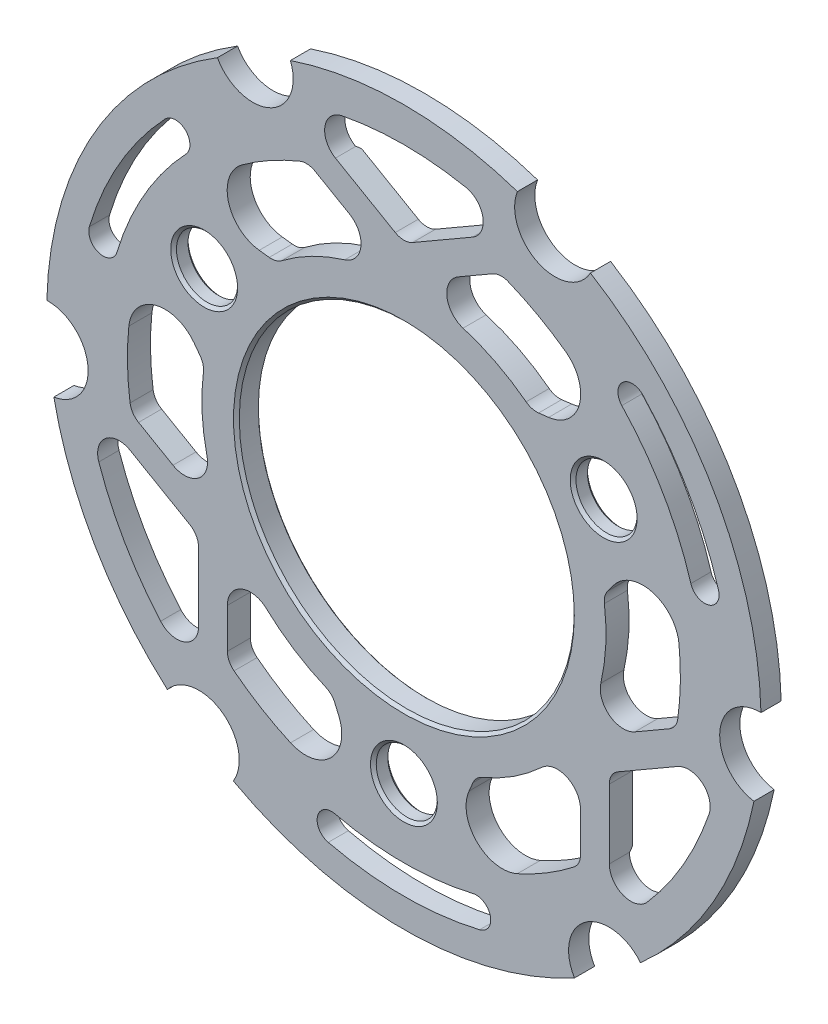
ISO-10303-21;
HEADER;
FILE_DESCRIPTION(('STEP AP214'),'2;1');
FILE_NAME('part.step','',(''),(''),'','','');
FILE_SCHEMA(('AUTOMOTIVE_DESIGN { 1 0 10303 214 1 1 1 1 }'));
ENDSEC;
DATA;
#1=APPLICATION_CONTEXT('core data for automotive mechanical design processes');
#2=APPLICATION_PROTOCOL_DEFINITION('international standard','automotive_design',2000,#1);
#3=PRODUCT_CONTEXT('',#1,'mechanical');
#4=PRODUCT('Part','Part','',(#3));
#5=PRODUCT_RELATED_PRODUCT_CATEGORY('part','',(#4));
#6=PRODUCT_DEFINITION_FORMATION('','',#4);
#7=PRODUCT_DEFINITION_CONTEXT('part definition',#1,'design');
#8=PRODUCT_DEFINITION('design','',#6,#7);
#9=PRODUCT_DEFINITION_SHAPE('','',#8);
#10=(LENGTH_UNIT() NAMED_UNIT(*) SI_UNIT(.MILLI.,.METRE.));
#11=(NAMED_UNIT(*) PLANE_ANGLE_UNIT() SI_UNIT($,.RADIAN.));
#12=(NAMED_UNIT(*) SI_UNIT($,.STERADIAN.) SOLID_ANGLE_UNIT());
#13=UNCERTAINTY_MEASURE_WITH_UNIT(LENGTH_MEASURE(1.E-05),#10,'distance_accuracy_value','');
#14=(GEOMETRIC_REPRESENTATION_CONTEXT(3) GLOBAL_UNCERTAINTY_ASSIGNED_CONTEXT((#13)) GLOBAL_UNIT_ASSIGNED_CONTEXT((#10,
#11,#12)) REPRESENTATION_CONTEXT('',''));
#15=CARTESIAN_POINT('',(0.,0.,0.));
#16=DIRECTION('',(0.,0.,1.));
#17=DIRECTION('',(1.,0.,0.));
#18=AXIS2_PLACEMENT_3D('',#15,#16,#17);
#19=CARTESIAN_POINT('',(0.,0.,-4.));
#20=DIRECTION('',(0.,0.,1.));
#21=DIRECTION('',(1.,0.,0.));
#22=AXIS2_PLACEMENT_3D('',#19,#20,#21);
#23=PLANE('',#22);
#24=CARTESIAN_POINT('',(0.,0.,-4.));
#25=DIRECTION('',(0.,0.,1.));
#26=DIRECTION('',(1.,0.,0.));
#27=AXIS2_PLACEMENT_3D('',#24,#25,#26);
#28=CIRCLE('',#27,29.25);
#29=CARTESIAN_POINT('',(29.25,0.,-4.));
#30=VERTEX_POINT('',#29);
#31=EDGE_CURVE('E12',#30,#30,#28,.T.);
#32=ORIENTED_EDGE('',*,*,#31,.T.);
#33=EDGE_LOOP('',(#32));
#34=FACE_BOUND('',#33,.T.);
#35=CARTESIAN_POINT('',(0.,-40.,-4.));
#36=DIRECTION('',(0.,0.,-1.));
#37=DIRECTION('',(-1.,0.,0.));
#38=AXIS2_PLACEMENT_3D('',#35,#36,#37);
#39=CIRCLE('',#38,8.6);
#40=CARTESIAN_POINT('',(-8.6,-40.,-4.));
#41=VERTEX_POINT('',#40);
#42=EDGE_CURVE('E1117',#41,#41,#39,.T.);
#43=ORIENTED_EDGE('',*,*,#42,.F.);
#44=EDGE_LOOP('',(#43));
#45=FACE_BOUND('',#44,.T.);
#46=CARTESIAN_POINT('',(34.6410161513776,19.9999999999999,-4.));
#47=DIRECTION('',(0.,0.,-1.));
#48=DIRECTION('',(-1.,0.,0.));
#49=AXIS2_PLACEMENT_3D('',#46,#47,#48);
#50=CIRCLE('',#49,8.6);
#51=CARTESIAN_POINT('',(26.0410161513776,19.9999999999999,-4.));
#52=VERTEX_POINT('',#51);
#53=EDGE_CURVE('E1123',#52,#52,#50,.T.);
#54=ORIENTED_EDGE('',*,*,#53,.F.);
#55=EDGE_LOOP('',(#54));
#56=FACE_BOUND('',#55,.T.);
#57=CARTESIAN_POINT('',(-34.6410161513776,19.9999999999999,-4.));
#58=DIRECTION('',(0.,0.,-1.));
#59=DIRECTION('',(-1.,0.,0.));
#60=AXIS2_PLACEMENT_3D('',#57,#58,#59);
#61=CIRCLE('',#60,8.6);
#62=CARTESIAN_POINT('',(-43.2410161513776,19.9999999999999,-4.));
#63=VERTEX_POINT('',#62);
#64=EDGE_CURVE('E1112',#63,#63,#61,.T.);
#65=ORIENTED_EDGE('',*,*,#64,.F.);
#66=EDGE_LOOP('',(#65));
#67=FACE_BOUND('',#66,.T.);
#68=CARTESIAN_POINT('',(0.,0.,-4.));
#69=DIRECTION('',(0.,0.,1.));
#70=DIRECTION('',(1.,0.,0.));
#71=AXIS2_PLACEMENT_3D('',#68,#69,#70);
#72=CIRCLE('',#71,35.05);
#73=CARTESIAN_POINT('',(-10.2626348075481,33.5138900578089,-4.));
#74=VERTEX_POINT('',#73);
#75=CARTESIAN_POINT('',(-21.1961473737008,27.9146168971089,-4.));
#76=VERTEX_POINT('',#75);
#77=EDGE_CURVE('E1059',#74,#76,#72,.T.);
#78=ORIENTED_EDGE('',*,*,#77,.F.);
#79=CARTESIAN_POINT('',(-11.4338342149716,37.3385850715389,-4.));
#80=DIRECTION('',(0.,0.,-1.));
#81=DIRECTION('',(1.,0.,0.));
#82=AXIS2_PLACEMENT_3D('',#79,#80,#81);
#83=CIRCLE('',#82,4.00000000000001);
#84=CARTESIAN_POINT('',(-9.4338342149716,40.8026866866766,-4.));
#85=VERTEX_POINT('',#84);
#86=EDGE_CURVE('E1046',#85,#74,#83,.T.);
#87=ORIENTED_EDGE('',*,*,#86,.F.);
#88=DIRECTION('',(0.866025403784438,-0.500000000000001,0.));
#89=VECTOR('',#88,1.);
#90=CARTESIAN_POINT('',(-9.4338342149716,40.8026866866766,-4.));
#91=LINE('',#90,#89);
#92=CARTESIAN_POINT('',(-15.4029119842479,44.2489353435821,-4.));
#93=VERTEX_POINT('',#92);
#94=EDGE_CURVE('E1077',#93,#85,#91,.T.);
#95=ORIENTED_EDGE('',*,*,#94,.F.);
#96=CARTESIAN_POINT('',(-16.9029119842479,41.6508591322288,-4.));
#97=DIRECTION('',(0.,0.,-1.));
#98=DIRECTION('',(-1.,0.,0.));
#99=AXIS2_PLACEMENT_3D('',#96,#97,#98);
#100=CIRCLE('',#99,3.00000000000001);
#101=CARTESIAN_POINT('',(-18.0310262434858,44.4306717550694,-4.));
#102=VERTEX_POINT('',#101);
#103=EDGE_CURVE('E1074',#102,#93,#100,.T.);
#104=ORIENTED_EDGE('',*,*,#103,.F.);
#105=CARTESIAN_POINT('',(0.,0.,-4.));
#106=DIRECTION('',(0.,0.,-1.));
#107=DIRECTION('',(1.,0.,0.));
#108=AXIS2_PLACEMENT_3D('',#105,#106,#107);
#109=CIRCLE('',#108,47.95);
#110=CARTESIAN_POINT('',(-28.0401308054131,38.896703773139,-4.));
#111=VERTEX_POINT('',#110);
#112=EDGE_CURVE('E1071',#111,#102,#109,.T.);
#113=ORIENTED_EDGE('',*,*,#112,.F.);
#114=CARTESIAN_POINT('',(-24.3560260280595,33.7861879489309,-4.));
#115=DIRECTION('',(0.,0.,-1.));
#116=DIRECTION('',(-1.,0.,0.));
#117=AXIS2_PLACEMENT_3D('',#114,#115,#116);
#118=CIRCLE('',#117,6.30000000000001);
#119=CARTESIAN_POINT('',(-25.0965116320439,27.5298566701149,-4.));
#120=VERTEX_POINT('',#119);
#121=EDGE_CURVE('E1068',#120,#111,#118,.T.);
#122=ORIENTED_EDGE('',*,*,#121,.F.);
#123=DIRECTION('',(-0.993068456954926,0.117537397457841,0.));
#124=VECTOR('',#123,1.);
#125=CARTESIAN_POINT('',(-25.0965116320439,27.5298566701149,-4.));
#126=LINE('',#125,#124);
#127=CARTESIAN_POINT('',(-23.3629804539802,27.3246797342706,-4.));
#128=VERTEX_POINT('',#127);
#129=EDGE_CURVE('E1065',#128,#120,#126,.T.);
#130=ORIENTED_EDGE('',*,*,#129,.F.);
#131=CARTESIAN_POINT('',(-23.0103682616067,30.3038851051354,-4.));
#132=DIRECTION('',(0.,0.,-1.));
#133=DIRECTION('',(-1.,0.,0.));
#134=AXIS2_PLACEMENT_3D('',#131,#132,#133);
#135=CIRCLE('',#134,3.);
#136=EDGE_CURVE('E1062',#76,#128,#135,.T.);
#137=ORIENTED_EDGE('',*,*,#136,.F.);
#138=EDGE_LOOP('',(#78,#87,#95,#104,#113,#122,#130,#137));
#139=FACE_BOUND('',#138,.T.);
#140=CARTESIAN_POINT('',(11.4338342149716,37.3385850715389,-4.));
#141=DIRECTION('',(0.,0.,-1.));
#142=DIRECTION('',(-1.,0.,0.));
#143=AXIS2_PLACEMENT_3D('',#140,#141,#142);
#144=CIRCLE('',#143,4.00000000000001);
#145=CARTESIAN_POINT('',(10.2626348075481,33.5138900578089,-4.));
#146=VERTEX_POINT('',#145);
#147=CARTESIAN_POINT('',(9.4338342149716,40.8026866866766,-4.));
#148=VERTEX_POINT('',#147);
#149=EDGE_CURVE('E995',#146,#148,#144,.T.);
#150=ORIENTED_EDGE('',*,*,#149,.F.);
#151=CARTESIAN_POINT('',(0.,0.,-4.));
#152=DIRECTION('',(0.,0.,1.));
#153=DIRECTION('',(-1.,0.,0.));
#154=AXIS2_PLACEMENT_3D('',#151,#152,#153);
#155=CIRCLE('',#154,35.05);
#156=CARTESIAN_POINT('',(21.1961473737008,27.9146168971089,-4.));
#157=VERTEX_POINT('',#156);
#158=EDGE_CURVE('E987',#157,#146,#155,.T.);
#159=ORIENTED_EDGE('',*,*,#158,.F.);
#160=CARTESIAN_POINT('',(23.0103682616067,30.3038851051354,-4.));
#161=DIRECTION('',(0.,0.,-1.));
#162=DIRECTION('',(1.,0.,0.));
#163=AXIS2_PLACEMENT_3D('',#160,#161,#162);
#164=CIRCLE('',#163,3.);
#165=CARTESIAN_POINT('',(23.3629804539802,27.3246797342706,-4.));
#166=VERTEX_POINT('',#165);
#167=EDGE_CURVE('E1013',#166,#157,#164,.T.);
#168=ORIENTED_EDGE('',*,*,#167,.F.);
#169=DIRECTION('',(-0.993068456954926,-0.117537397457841,0.));
#170=VECTOR('',#169,1.);
#171=CARTESIAN_POINT('',(25.0965116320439,27.5298566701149,-4.));
#172=LINE('',#171,#170);
#173=CARTESIAN_POINT('',(25.0965116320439,27.5298566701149,-4.));
#174=VERTEX_POINT('',#173);
#175=EDGE_CURVE('E1010',#174,#166,#172,.T.);
#176=ORIENTED_EDGE('',*,*,#175,.F.);
#177=CARTESIAN_POINT('',(24.3560260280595,33.7861879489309,-4.));
#178=DIRECTION('',(0.,0.,-1.));
#179=DIRECTION('',(1.,0.,0.));
#180=AXIS2_PLACEMENT_3D('',#177,#178,#179);
#181=CIRCLE('',#180,6.30000000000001);
#182=CARTESIAN_POINT('',(28.0401308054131,38.896703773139,-4.));
#183=VERTEX_POINT('',#182);
#184=EDGE_CURVE('E1007',#183,#174,#181,.T.);
#185=ORIENTED_EDGE('',*,*,#184,.F.);
#186=CARTESIAN_POINT('',(0.,0.,-4.));
#187=DIRECTION('',(0.,0.,-1.));
#188=DIRECTION('',(-1.,0.,0.));
#189=AXIS2_PLACEMENT_3D('',#186,#187,#188);
#190=CIRCLE('',#189,47.95);
#191=CARTESIAN_POINT('',(18.0310262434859,44.4306717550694,-4.));
#192=VERTEX_POINT('',#191);
#193=EDGE_CURVE('E1004',#192,#183,#190,.T.);
#194=ORIENTED_EDGE('',*,*,#193,.F.);
#195=CARTESIAN_POINT('',(16.9029119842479,41.6508591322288,-4.));
#196=DIRECTION('',(0.,0.,-1.));
#197=DIRECTION('',(1.,0.,0.));
#198=AXIS2_PLACEMENT_3D('',#195,#196,#197);
#199=CIRCLE('',#198,3.00000000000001);
#200=CARTESIAN_POINT('',(15.4029119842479,44.2489353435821,-4.));
#201=VERTEX_POINT('',#200);
#202=EDGE_CURVE('E1001',#201,#192,#199,.T.);
#203=ORIENTED_EDGE('',*,*,#202,.F.);
#204=DIRECTION('',(0.866025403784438,0.500000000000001,0.));
#205=VECTOR('',#204,1.);
#206=CARTESIAN_POINT('',(9.4338342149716,40.8026866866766,-4.));
#207=LINE('',#206,#205);
#208=EDGE_CURVE('E998',#148,#201,#207,.T.);
#209=ORIENTED_EDGE('',*,*,#208,.F.);
#210=EDGE_LOOP('',(#150,#159,#168,#176,#185,#194,#203,#209));
#211=FACE_BOUND('',#210,.T.);
#212=CARTESIAN_POINT('',(0.,0.,-4.));
#213=DIRECTION('',(0.,0.,1.));
#214=DIRECTION('',(-0.500000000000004,0.866025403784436,0.));
#215=AXIS2_PLACEMENT_3D('',#212,#213,#214);
#216=CIRCLE('',#215,35.05);
#217=CARTESIAN_POINT('',(-23.892562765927,-25.6446474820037,-4.));
#218=VERTEX_POINT('',#217);
#219=CARTESIAN_POINT('',(-13.5766936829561,-32.3137105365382,-4.));
#220=VERTEX_POINT('',#219);
#221=EDGE_CURVE('E871',#218,#220,#216,.T.);
#222=ORIENTED_EDGE('',*,*,#221,.F.);
#223=CARTESIAN_POINT('',(-26.6192461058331,-28.5712834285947,-4.));
#224=DIRECTION('',(0.,0.,-1.));
#225=DIRECTION('',(-0.500000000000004,0.866025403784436,0.));
#226=AXIS2_PLACEMENT_3D('',#223,#224,#225);
#227=CIRCLE('',#226,4.00000000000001);
#228=CARTESIAN_POINT('',(-30.6192461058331,-28.5712834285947,-4.));
#229=VERTEX_POINT('',#228);
#230=EDGE_CURVE('E757',#229,#218,#227,.T.);
#231=ORIENTED_EDGE('',*,*,#230,.F.);
#232=DIRECTION('',(0.,1.,0.));
#233=VECTOR('',#232,1.);
#234=CARTESIAN_POINT('',(-30.6192461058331,-28.5712834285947,-4.));
#235=LINE('',#234,#233);
#236=CARTESIAN_POINT('',(-30.6192461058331,-35.4637807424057,-4.));
#237=VERTEX_POINT('',#236);
#238=EDGE_CURVE('E889',#237,#229,#235,.T.);
#239=ORIENTED_EDGE('',*,*,#238,.F.);
#240=CARTESIAN_POINT('',(-27.6192461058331,-35.4637807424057,-4.));
#241=DIRECTION('',(0.,0.,-1.));
#242=DIRECTION('',(0.500000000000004,-0.866025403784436,0.));
#243=AXIS2_PLACEMENT_3D('',#240,#241,#242);
#244=CIRCLE('',#243,3.00000000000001);
#245=CARTESIAN_POINT('',(-29.4625773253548,-37.8306626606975,-4.));
#246=VERTEX_POINT('',#245);
#247=EDGE_CURVE('E886',#246,#237,#244,.T.);
#248=ORIENTED_EDGE('',*,*,#247,.F.);
#249=CARTESIAN_POINT('',(0.,0.,-4.));
#250=DIRECTION('',(0.,0.,-1.));
#251=DIRECTION('',(-0.500000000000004,0.866025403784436,0.));
#252=AXIS2_PLACEMENT_3D('',#249,#250,#251);
#253=CIRCLE('',#252,47.95);
#254=CARTESIAN_POINT('',(-19.6654681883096,-43.7318174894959,-4.));
#255=VERTEX_POINT('',#254);
#256=EDGE_CURVE('E883',#255,#246,#253,.T.);
#257=ORIENTED_EDGE('',*,*,#256,.F.);
#258=CARTESIAN_POINT('',(-17.0816840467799,-37.9860312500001,-4.));
#259=DIRECTION('',(0.,0.,-1.));
#260=DIRECTION('',(0.500000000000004,-0.866025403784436,0.));
#261=AXIS2_PLACEMENT_3D('',#258,#259,#260);
#262=CIRCLE('',#261,6.30000000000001);
#263=CARTESIAN_POINT('',(-11.2932994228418,-35.4991449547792,-4.));
#264=VERTEX_POINT('',#263);
#265=EDGE_CURVE('E880',#264,#255,#262,.T.);
#266=ORIENTED_EDGE('',*,*,#265,.F.);
#267=DIRECTION('',(0.394743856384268,-0.918791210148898,0.));
#268=VECTOR('',#267,1.);
#269=CARTESIAN_POINT('',(-11.2932994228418,-35.4991449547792,-4.));
#270=LINE('',#269,#268);
#271=CARTESIAN_POINT('',(-11.9823765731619,-33.8952744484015,-4.));
#272=VERTEX_POINT('',#271);
#273=EDGE_CURVE('E877',#272,#264,#270,.T.);
#274=ORIENTED_EDGE('',*,*,#273,.F.);
#275=CARTESIAN_POINT('',(-14.7387502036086,-35.0795060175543,-4.));
#276=DIRECTION('',(0.,0.,-1.));
#277=DIRECTION('',(0.500000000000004,-0.866025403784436,0.));
#278=AXIS2_PLACEMENT_3D('',#275,#276,#277);
#279=CIRCLE('',#278,3.);
#280=EDGE_CURVE('E874',#220,#272,#279,.T.);
#281=ORIENTED_EDGE('',*,*,#280,.F.);
#282=EDGE_LOOP('',(#222,#231,#239,#248,#257,#266,#274,#281));
#283=FACE_BOUND('',#282,.T.);
#284=CARTESIAN_POINT('',(26.6192461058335,-28.5712834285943,-4.));
#285=DIRECTION('',(0.,0.,-1.));
#286=DIRECTION('',(0.499999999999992,0.866025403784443,0.));
#287=AXIS2_PLACEMENT_3D('',#284,#285,#286);
#288=CIRCLE('',#287,4.00000000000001);
#289=CARTESIAN_POINT('',(23.8925627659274,-25.6446474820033,-4.));
#290=VERTEX_POINT('',#289);
#291=CARTESIAN_POINT('',(30.6192461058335,-28.5712834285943,-4.));
#292=VERTEX_POINT('',#291);
#293=EDGE_CURVE('E705',#290,#292,#288,.T.);
#294=ORIENTED_EDGE('',*,*,#293,.F.);
#295=CARTESIAN_POINT('',(0.,0.,-4.));
#296=DIRECTION('',(0.,0.,1.));
#297=DIRECTION('',(0.499999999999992,0.866025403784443,0.));
#298=AXIS2_PLACEMENT_3D('',#295,#296,#297);
#299=CIRCLE('',#298,35.05);
#300=CARTESIAN_POINT('',(13.5766936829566,-32.313710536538,-4.));
#301=VERTEX_POINT('',#300);
#302=EDGE_CURVE('E671',#301,#290,#299,.T.);
#303=ORIENTED_EDGE('',*,*,#302,.F.);
#304=CARTESIAN_POINT('',(14.7387502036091,-35.0795060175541,-4.));
#305=DIRECTION('',(0.,0.,-1.));
#306=DIRECTION('',(-0.499999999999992,-0.866025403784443,0.));
#307=AXIS2_PLACEMENT_3D('',#304,#305,#306);
#308=CIRCLE('',#307,3.);
#309=CARTESIAN_POINT('',(11.9823765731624,-33.8952744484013,-4.));
#310=VERTEX_POINT('',#309);
#311=EDGE_CURVE('E723',#310,#301,#308,.T.);
#312=ORIENTED_EDGE('',*,*,#311,.F.);
#313=DIRECTION('',(0.394743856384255,0.918791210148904,0.));
#314=VECTOR('',#313,1.);
#315=CARTESIAN_POINT('',(11.2932994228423,-35.499144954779,-4.));
#316=LINE('',#315,#314);
#317=CARTESIAN_POINT('',(11.2932994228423,-35.499144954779,-4.));
#318=VERTEX_POINT('',#317);
#319=EDGE_CURVE('E720',#318,#310,#316,.T.);
#320=ORIENTED_EDGE('',*,*,#319,.F.);
#321=CARTESIAN_POINT('',(17.0816840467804,-37.9860312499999,-4.));
#322=DIRECTION('',(0.,0.,-1.));
#323=DIRECTION('',(-0.499999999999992,-0.866025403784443,0.));
#324=AXIS2_PLACEMENT_3D('',#321,#322,#323);
#325=CIRCLE('',#324,6.30000000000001);
#326=CARTESIAN_POINT('',(19.6654681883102,-43.7318174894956,-4.));
#327=VERTEX_POINT('',#326);
#328=EDGE_CURVE('E717',#327,#318,#325,.T.);
#329=ORIENTED_EDGE('',*,*,#328,.F.);
#330=CARTESIAN_POINT('',(0.,0.,-4.));
#331=DIRECTION('',(0.,0.,-1.));
#332=DIRECTION('',(0.499999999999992,0.866025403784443,0.));
#333=AXIS2_PLACEMENT_3D('',#330,#331,#332);
#334=CIRCLE('',#333,47.95);
#335=CARTESIAN_POINT('',(29.4625773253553,-37.8306626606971,-4.));
#336=VERTEX_POINT('',#335);
#337=EDGE_CURVE('E714',#336,#327,#334,.T.);
#338=ORIENTED_EDGE('',*,*,#337,.F.);
#339=CARTESIAN_POINT('',(27.6192461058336,-35.4637807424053,-4.));
#340=DIRECTION('',(0.,0.,-1.));
#341=DIRECTION('',(-0.499999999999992,-0.866025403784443,0.));
#342=AXIS2_PLACEMENT_3D('',#339,#340,#341);
#343=CIRCLE('',#342,3.00000000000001);
#344=CARTESIAN_POINT('',(30.6192461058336,-35.4637807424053,-4.));
#345=VERTEX_POINT('',#344);
#346=EDGE_CURVE('E711',#345,#336,#343,.T.);
#347=ORIENTED_EDGE('',*,*,#346,.F.);
#348=DIRECTION('',(0.,-1.,0.));
#349=VECTOR('',#348,1.);
#350=CARTESIAN_POINT('',(30.6192461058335,-28.5712834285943,-4.));
#351=LINE('',#350,#349);
#352=EDGE_CURVE('E708',#292,#345,#351,.T.);
#353=ORIENTED_EDGE('',*,*,#352,.F.);
#354=EDGE_LOOP('',(#294,#303,#312,#320,#329,#338,#347,#353));
#355=FACE_BOUND('',#354,.T.);
#356=CARTESIAN_POINT('',(0.,0.,-4.));
#357=DIRECTION('',(0.,0.,1.));
#358=DIRECTION('',(-0.499999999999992,-0.866025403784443,0.));
#359=AXIS2_PLACEMENT_3D('',#356,#357,#358);
#360=CIRCLE('',#359,35.05);
#361=CARTESIAN_POINT('',(34.1551975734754,-7.86924257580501,-4.));
#362=VERTEX_POINT('',#361);
#363=CARTESIAN_POINT('',(34.772841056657,4.39909363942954,-4.));
#364=VERTEX_POINT('',#363);
#365=EDGE_CURVE('E811',#362,#364,#360,.T.);
#366=ORIENTED_EDGE('',*,*,#365,.F.);
#367=CARTESIAN_POINT('',(38.0530803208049,-8.76730164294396,-4.));
#368=DIRECTION('',(0.,0.,-1.));
#369=DIRECTION('',(-0.499999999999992,-0.866025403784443,0.));
#370=AXIS2_PLACEMENT_3D('',#367,#368,#369);
#371=CIRCLE('',#370,4.00000000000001);
#372=CARTESIAN_POINT('',(40.053080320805,-12.2314032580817,-4.));
#373=VERTEX_POINT('',#372);
#374=EDGE_CURVE('E809',#373,#362,#371,.T.);
#375=ORIENTED_EDGE('',*,*,#374,.F.);
#376=DIRECTION('',(-0.866025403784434,-0.500000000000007,0.));
#377=VECTOR('',#376,1.);
#378=CARTESIAN_POINT('',(40.053080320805,-12.2314032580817,-4.));
#379=LINE('',#378,#377);
#380=CARTESIAN_POINT('',(46.0221580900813,-8.78515460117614,-4.));
#381=VERTEX_POINT('',#380);
#382=EDGE_CURVE('E830',#381,#373,#379,.T.);
#383=ORIENTED_EDGE('',*,*,#382,.F.);
#384=CARTESIAN_POINT('',(44.5221580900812,-6.18707838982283,-4.));
#385=DIRECTION('',(0.,0.,-1.));
#386=DIRECTION('',(0.499999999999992,0.866025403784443,0.));
#387=AXIS2_PLACEMENT_3D('',#384,#385,#386);
#388=CIRCLE('',#387,3.00000000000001);
#389=CARTESIAN_POINT('',(47.4936035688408,-6.60000909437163,-4.));
#390=VERTEX_POINT('',#389);
#391=EDGE_CURVE('E827',#390,#381,#388,.T.);
#392=ORIENTED_EDGE('',*,*,#391,.F.);
#393=CARTESIAN_POINT('',(0.,0.,-4.));
#394=DIRECTION('',(0.,0.,-1.));
#395=DIRECTION('',(-0.499999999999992,-0.866025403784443,0.));
#396=AXIS2_PLACEMENT_3D('',#393,#394,#395);
#397=CIRCLE('',#396,47.95);
#398=CARTESIAN_POINT('',(47.7055989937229,4.8351137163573,-4.));
#399=VERTEX_POINT('',#398);
#400=EDGE_CURVE('E824',#399,#390,#397,.T.);
#401=ORIENTED_EDGE('',*,*,#400,.F.);
#402=CARTESIAN_POINT('',(41.4377100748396,4.19984330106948,-4.));
#403=DIRECTION('',(0.,0.,-1.));
#404=DIRECTION('',(0.499999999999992,0.866025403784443,0.));
#405=AXIS2_PLACEMENT_3D('',#402,#403,#404);
#406=CIRCLE('',#405,6.30000000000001);
#407=CARTESIAN_POINT('',(36.3898110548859,7.96928828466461,-4.));
#408=VERTEX_POINT('',#407);
#409=EDGE_CURVE('E821',#408,#399,#406,.T.);
#410=ORIENTED_EDGE('',*,*,#409,.F.);
#411=DIRECTION('',(0.598324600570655,0.801253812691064,0.));
#412=VECTOR('',#411,1.);
#413=CARTESIAN_POINT('',(36.3898110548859,7.96928828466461,-4.));
#414=LINE('',#413,#412);
#415=CARTESIAN_POINT('',(35.3453570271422,6.57059471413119,-4.));
#416=VERTEX_POINT('',#415);
#417=EDGE_CURVE('E818',#416,#408,#414,.T.);
#418=ORIENTED_EDGE('',*,*,#417,.F.);
#419=CARTESIAN_POINT('',(37.7491184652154,4.77562091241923,-4.));
#420=DIRECTION('',(0.,0.,-1.));
#421=DIRECTION('',(0.499999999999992,0.866025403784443,0.));
#422=AXIS2_PLACEMENT_3D('',#419,#420,#421);
#423=CIRCLE('',#422,3.);
#424=EDGE_CURVE('E815',#364,#416,#423,.T.);
#425=ORIENTED_EDGE('',*,*,#424,.F.);
#426=EDGE_LOOP('',(#366,#375,#383,#392,#401,#410,#418,#425));
#427=FACE_BOUND('',#426,.T.);
#428=CARTESIAN_POINT('',(-38.0530803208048,-8.76730164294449,-4.));
#429=DIRECTION('',(0.,0.,-1.));
#430=DIRECTION('',(0.500000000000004,-0.866025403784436,0.));
#431=AXIS2_PLACEMENT_3D('',#428,#429,#430);
#432=CIRCLE('',#431,4.00000000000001);
#433=CARTESIAN_POINT('',(-34.1551975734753,-7.86924257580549,-4.));
#434=VERTEX_POINT('',#433);
#435=CARTESIAN_POINT('',(-40.0530803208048,-12.2314032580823,-4.));
#436=VERTEX_POINT('',#435);
#437=EDGE_CURVE('E771',#434,#436,#432,.T.);
#438=ORIENTED_EDGE('',*,*,#437,.F.);
#439=CARTESIAN_POINT('',(0.,0.,-4.));
#440=DIRECTION('',(0.,0.,1.));
#441=DIRECTION('',(0.500000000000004,-0.866025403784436,0.));
#442=AXIS2_PLACEMENT_3D('',#439,#440,#441);
#443=CIRCLE('',#442,35.05);
#444=CARTESIAN_POINT('',(-34.7728410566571,4.39909363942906,-4.));
#445=VERTEX_POINT('',#444);
#446=EDGE_CURVE('E769',#445,#434,#443,.T.);
#447=ORIENTED_EDGE('',*,*,#446,.F.);
#448=CARTESIAN_POINT('',(-37.7491184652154,4.7756209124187,-4.));
#449=DIRECTION('',(0.,0.,-1.));
#450=DIRECTION('',(-0.500000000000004,0.866025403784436,0.));
#451=AXIS2_PLACEMENT_3D('',#448,#449,#450);
#452=CIRCLE('',#451,3.);
#453=CARTESIAN_POINT('',(-35.3453570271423,6.5705947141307,-4.));
#454=VERTEX_POINT('',#453);
#455=EDGE_CURVE('E790',#454,#445,#452,.T.);
#456=ORIENTED_EDGE('',*,*,#455,.F.);
#457=DIRECTION('',(0.598324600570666,-0.801253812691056,0.));
#458=VECTOR('',#457,1.);
#459=CARTESIAN_POINT('',(-36.389811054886,7.96928828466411,-4.));
#460=LINE('',#459,#458);
#461=CARTESIAN_POINT('',(-36.389811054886,7.9692882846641,-4.));
#462=VERTEX_POINT('',#461);
#463=EDGE_CURVE('E787',#462,#454,#460,.T.);
#464=ORIENTED_EDGE('',*,*,#463,.F.);
#465=CARTESIAN_POINT('',(-41.4377100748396,4.1998433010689,-4.));
#466=DIRECTION('',(0.,0.,-1.));
#467=DIRECTION('',(-0.500000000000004,0.866025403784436,0.));
#468=AXIS2_PLACEMENT_3D('',#465,#466,#467);
#469=CIRCLE('',#468,6.30000000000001);
#470=CARTESIAN_POINT('',(-47.7055989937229,4.83511371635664,-4.));
#471=VERTEX_POINT('',#470);
#472=EDGE_CURVE('E784',#471,#462,#469,.T.);
#473=ORIENTED_EDGE('',*,*,#472,.F.);
#474=CARTESIAN_POINT('',(0.,0.,-4.));
#475=DIRECTION('',(0.,0.,-1.));
#476=DIRECTION('',(0.500000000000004,-0.866025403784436,0.));
#477=AXIS2_PLACEMENT_3D('',#474,#475,#476);
#478=CIRCLE('',#477,47.95);
#479=CARTESIAN_POINT('',(-47.4936035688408,-6.60000909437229,-4.));
#480=VERTEX_POINT('',#479);
#481=EDGE_CURVE('E781',#480,#471,#478,.T.);
#482=ORIENTED_EDGE('',*,*,#481,.F.);
#483=CARTESIAN_POINT('',(-44.5221580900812,-6.18707838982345,-4.));
#484=DIRECTION('',(0.,0.,-1.));
#485=DIRECTION('',(-0.500000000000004,0.866025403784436,0.));
#486=AXIS2_PLACEMENT_3D('',#483,#484,#485);
#487=CIRCLE('',#486,3.00000000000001);
#488=CARTESIAN_POINT('',(-46.0221580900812,-8.78515460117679,-4.));
#489=VERTEX_POINT('',#488);
#490=EDGE_CURVE('E778',#489,#480,#487,.T.);
#491=ORIENTED_EDGE('',*,*,#490,.F.);
#492=DIRECTION('',(-0.866025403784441,0.499999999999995,0.));
#493=VECTOR('',#492,1.);
#494=CARTESIAN_POINT('',(-40.0530803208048,-12.2314032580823,-4.));
#495=LINE('',#494,#493);
#496=EDGE_CURVE('E775',#436,#489,#495,.T.);
#497=ORIENTED_EDGE('',*,*,#496,.F.);
#498=EDGE_LOOP('',(#438,#447,#456,#464,#473,#482,#491,#497));
#499=FACE_BOUND('',#498,.T.);
#500=CARTESIAN_POINT('',(0.,0.,-4.));
#501=DIRECTION('',(0.,0.,-1.));
#502=DIRECTION('',(-1.,0.,0.));
#503=AXIS2_PLACEMENT_3D('',#500,#501,#502);
#504=CIRCLE('',#503,49.);
#505=CARTESIAN_POINT('',(35.6192461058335,-33.6492096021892,-4.));
#506=VERTEX_POINT('',#505);
#507=CARTESIAN_POINT('',(-35.6192461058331,-33.6492096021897,-4.));
#508=VERTEX_POINT('',#507);
#509=EDGE_CURVE('E1149',#506,#508,#504,.T.);
#510=ORIENTED_EDGE('',*,*,#509,.T.);
#511=DIRECTION('',(0.,-1.,0.));
#512=VECTOR('',#511,1.);
#513=CARTESIAN_POINT('',(-35.6192461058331,-34.2768502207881,-4.));
#514=LINE('',#513,#512);
#515=CARTESIAN_POINT('',(-35.6192461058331,-22.2968321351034,-4.));
#516=VERTEX_POINT('',#515);
#517=EDGE_CURVE('E751',#516,#508,#514,.T.);
#518=ORIENTED_EDGE('',*,*,#517,.F.);
#519=CARTESIAN_POINT('',(-38.6192461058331,-22.2968321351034,-4.));
#520=DIRECTION('',(0.,0.,-1.));
#521=DIRECTION('',(-0.500000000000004,0.866025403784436,0.));
#522=AXIS2_PLACEMENT_3D('',#519,#520,#521);
#523=CIRCLE('',#522,3.);
#524=CARTESIAN_POINT('',(-37.1192461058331,-19.6987559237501,-4.));
#525=VERTEX_POINT('',#524);
#526=EDGE_CURVE('E747',#525,#516,#523,.T.);
#527=ORIENTED_EDGE('',*,*,#526,.F.);
#528=DIRECTION('',(0.866025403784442,-0.499999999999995,0.));
#529=VECTOR('',#528,1.);
#530=CARTESIAN_POINT('',(-37.1192461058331,-19.6987559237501,-4.));
#531=LINE('',#530,#529);
#532=CARTESIAN_POINT('',(-46.95069338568,-14.022567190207,-4.));
#533=VERTEX_POINT('',#532);
#534=EDGE_CURVE('E744',#533,#525,#531,.T.);
#535=ORIENTED_EDGE('',*,*,#534,.F.);
#536=CARTESIAN_POINT('',(-11.3314472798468,47.6717767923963,-4.));
#537=VERTEX_POINT('',#536);
#538=EDGE_CURVE('E1144',#533,#537,#504,.T.);
#539=ORIENTED_EDGE('',*,*,#538,.T.);
#540=DIRECTION('',(-0.866025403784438,0.500000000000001,0.));
#541=VECTOR('',#540,1.);
#542=CARTESIAN_POINT('',(-11.875,47.9855971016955,-4.));
#543=LINE('',#542,#541);
#544=CARTESIAN_POINT('',(-1.50000000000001,41.9955880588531,-4.));
#545=VERTEX_POINT('',#544);
#546=EDGE_CURVE('E1039',#545,#537,#543,.T.);
#547=ORIENTED_EDGE('',*,*,#546,.F.);
#548=CARTESIAN_POINT('',(0.,44.5936642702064,-4.));
#549=DIRECTION('',(0.,0.,-1.));
#550=DIRECTION('',(1.,0.,0.));
#551=AXIS2_PLACEMENT_3D('',#548,#549,#550);
#552=CIRCLE('',#551,3.);
#553=CARTESIAN_POINT('',(1.5,41.9955880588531,-4.));
#554=VERTEX_POINT('',#553);
#555=EDGE_CURVE('E1036',#554,#545,#552,.T.);
#556=ORIENTED_EDGE('',*,*,#555,.F.);
#557=DIRECTION('',(-0.866025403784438,-0.500000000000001,0.));
#558=VECTOR('',#557,1.);
#559=CARTESIAN_POINT('',(1.50000000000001,41.9955880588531,-4.));
#560=LINE('',#559,#558);
#561=CARTESIAN_POINT('',(11.3314472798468,47.6717767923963,-4.));
#562=VERTEX_POINT('',#561);
#563=EDGE_CURVE('E1019',#562,#554,#560,.T.);
#564=ORIENTED_EDGE('',*,*,#563,.F.);
#565=CARTESIAN_POINT('',(46.9506933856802,-14.0225671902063,-4.));
#566=VERTEX_POINT('',#565);
#567=EDGE_CURVE('E1145',#562,#566,#504,.T.);
#568=ORIENTED_EDGE('',*,*,#567,.T.);
#569=DIRECTION('',(0.866025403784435,0.500000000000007,0.));
#570=VECTOR('',#569,1.);
#571=CARTESIAN_POINT('',(47.4942461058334,-13.7087468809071,-4.));
#572=LINE('',#571,#570);
#573=CARTESIAN_POINT('',(37.1192461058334,-19.6987559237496,-4.));
#574=VERTEX_POINT('',#573);
#575=EDGE_CURVE('E854',#574,#566,#572,.T.);
#576=ORIENTED_EDGE('',*,*,#575,.F.);
#577=CARTESIAN_POINT('',(38.6192461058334,-22.2968321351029,-4.));
#578=DIRECTION('',(0.,0.,-1.));
#579=DIRECTION('',(-0.499999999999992,-0.866025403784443,0.));
#580=AXIS2_PLACEMENT_3D('',#577,#578,#579);
#581=CIRCLE('',#580,3.);
#582=CARTESIAN_POINT('',(35.6192461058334,-22.2968321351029,-4.));
#583=VERTEX_POINT('',#582);
#584=EDGE_CURVE('E851',#583,#574,#581,.T.);
#585=ORIENTED_EDGE('',*,*,#584,.F.);
#586=DIRECTION('',(0.,1.,0.));
#587=VECTOR('',#586,1.);
#588=CARTESIAN_POINT('',(35.6192461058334,-22.2968321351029,-4.));
#589=LINE('',#588,#587);
#590=EDGE_CURVE('E729',#506,#583,#589,.T.);
#591=ORIENTED_EDGE('',*,*,#590,.F.);
#592=EDGE_LOOP('',(#510,#518,#527,#535,#539,#547,#556,#564,#568,#576,#585,#591));
#593=FACE_BOUND('',#592,.T.);
#594=ADVANCED_FACE('F40',(#34,#45,#56,#67,#139,#211,#283,#355,#427,#499,#593),#23,.F.);
#595=CARTESIAN_POINT('',(0.,0.,0.));
#596=DIRECTION('',(0.,0.,1.));
#597=DIRECTION('',(1.,0.,0.));
#598=AXIS2_PLACEMENT_3D('',#595,#596,#597);
#599=PLANE('',#598);
#600=CARTESIAN_POINT('',(0.,0.,0.));
#601=DIRECTION('',(0.,0.,1.));
#602=DIRECTION('',(1.,0.,0.));
#603=AXIS2_PLACEMENT_3D('',#600,#601,#602);
#604=CIRCLE('',#603,29.55);
#605=CARTESIAN_POINT('',(29.55,0.,0.));
#606=VERTEX_POINT('',#605);
#607=EDGE_CURVE('E2446',#606,#606,#604,.F.);
#608=ORIENTED_EDGE('',*,*,#607,.T.);
#609=EDGE_LOOP('',(#608));
#610=FACE_BOUND('',#609,.T.);
#611=CARTESIAN_POINT('',(0.,-40.,0.));
#612=DIRECTION('',(0.,0.,1.));
#613=DIRECTION('',(1.,0.,0.));
#614=AXIS2_PLACEMENT_3D('',#611,#612,#613);
#615=CIRCLE('',#614,5.80000000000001);
#616=CARTESIAN_POINT('',(5.80000000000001,-40.,0.));
#617=VERTEX_POINT('',#616);
#618=EDGE_CURVE('E2471',#617,#617,#615,.F.);
#619=ORIENTED_EDGE('',*,*,#618,.T.);
#620=EDGE_LOOP('',(#619));
#621=FACE_BOUND('',#620,.T.);
#622=CARTESIAN_POINT('',(34.6410161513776,19.9999999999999,0.));
#623=DIRECTION('',(0.,0.,1.));
#624=DIRECTION('',(1.,0.,0.));
#625=AXIS2_PLACEMENT_3D('',#622,#623,#624);
#626=CIRCLE('',#625,5.79999999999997);
#627=CARTESIAN_POINT('',(40.4410161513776,19.9999999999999,0.));
#628=VERTEX_POINT('',#627);
#629=EDGE_CURVE('E2474',#628,#628,#626,.F.);
#630=ORIENTED_EDGE('',*,*,#629,.T.);
#631=EDGE_LOOP('',(#630));
#632=FACE_BOUND('',#631,.T.);
#633=CARTESIAN_POINT('',(-34.6410161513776,19.9999999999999,0.));
#634=DIRECTION('',(0.,0.,1.));
#635=DIRECTION('',(1.,0.,0.));
#636=AXIS2_PLACEMENT_3D('',#633,#634,#635);
#637=CIRCLE('',#636,5.79999999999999);
#638=CARTESIAN_POINT('',(-28.8410161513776,19.9999999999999,0.));
#639=VERTEX_POINT('',#638);
#640=EDGE_CURVE('E2477',#639,#639,#637,.F.);
#641=ORIENTED_EDGE('',*,*,#640,.T.);
#642=EDGE_LOOP('',(#641));
#643=FACE_BOUND('',#642,.T.);
#644=CARTESIAN_POINT('',(12.5500000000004,-52.9839598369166,0.));
#645=DIRECTION('',(0.,0.,-1.));
#646=DIRECTION('',(0.500000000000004,-0.866025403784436,0.));
#647=AXIS2_PLACEMENT_3D('',#644,#645,#646);
#648=CIRCLE('',#647,2.49999999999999);
#649=CARTESIAN_POINT('',(11.97378328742,-50.5512711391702,0.));
#650=VERTEX_POINT('',#649);
#651=CARTESIAN_POINT('',(13.1262167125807,-55.416648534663,0.));
#652=VERTEX_POINT('',#651);
#653=EDGE_CURVE('E637',#650,#652,#648,.T.);
#654=ORIENTED_EDGE('',*,*,#653,.T.);
#655=CARTESIAN_POINT('',(0.,0.,0.));
#656=DIRECTION('',(0.,0.,-1.));
#657=DIRECTION('',(0.500000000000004,-0.866025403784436,0.));
#658=AXIS2_PLACEMENT_3D('',#655,#656,#657);
#659=CIRCLE('',#658,56.95);
#660=CARTESIAN_POINT('',(-13.12621671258,-55.4166485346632,0.));
#661=VERTEX_POINT('',#660);
#662=EDGE_CURVE('E648',#652,#661,#659,.T.);
#663=ORIENTED_EDGE('',*,*,#662,.T.);
#664=CARTESIAN_POINT('',(-12.5499999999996,-52.9839598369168,0.));
#665=DIRECTION('',(0.,0.,-1.));
#666=DIRECTION('',(0.500000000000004,-0.866025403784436,0.));
#667=AXIS2_PLACEMENT_3D('',#664,#665,#666);
#668=CIRCLE('',#667,2.49999999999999);
#669=CARTESIAN_POINT('',(-11.9737832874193,-50.5512711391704,0.));
#670=VERTEX_POINT('',#669);
#671=EDGE_CURVE('E55',#661,#670,#668,.T.);
#672=ORIENTED_EDGE('',*,*,#671,.T.);
#673=CARTESIAN_POINT('',(0.,0.,0.));
#674=DIRECTION('',(0.,0.,1.));
#675=DIRECTION('',(0.500000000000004,-0.866025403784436,0.));
#676=AXIS2_PLACEMENT_3D('',#673,#674,#675);
#677=CIRCLE('',#676,51.95);
#678=EDGE_CURVE('E645',#670,#650,#677,.T.);
#679=ORIENTED_EDGE('',*,*,#678,.T.);
#680=EDGE_LOOP('',(#654,#663,#672,#679));
#681=FACE_BOUND('',#680,.T.);
#682=CARTESIAN_POINT('',(39.6104552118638,37.3605987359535,0.));
#683=DIRECTION('',(0.,0.,-1.));
#684=DIRECTION('',(0.499999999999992,0.866025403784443,0.));
#685=AXIS2_PLACEMENT_3D('',#682,#683,#684);
#686=CIRCLE('',#685,2.49999999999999);
#687=CARTESIAN_POINT('',(37.7917933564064,35.6452360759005,0.));
#688=VERTEX_POINT('',#687);
#689=CARTESIAN_POINT('',(41.4291170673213,39.0759613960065,0.));
#690=VERTEX_POINT('',#689);
#691=EDGE_CURVE('E675',#688,#690,#686,.T.);
#692=ORIENTED_EDGE('',*,*,#691,.T.);
#693=CARTESIAN_POINT('',(0.,0.,0.));
#694=DIRECTION('',(0.,0.,-1.));
#695=DIRECTION('',(0.499999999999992,0.866025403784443,0.));
#696=AXIS2_PLACEMENT_3D('',#693,#694,#695);
#697=CIRCLE('',#696,56.95);
#698=CARTESIAN_POINT('',(54.5553337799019,16.3406871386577,0.));
#699=VERTEX_POINT('',#698);
#700=EDGE_CURVE('E678',#690,#699,#697,.T.);
#701=ORIENTED_EDGE('',*,*,#700,.T.);
#702=CARTESIAN_POINT('',(52.1604552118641,15.6233611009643,0.));
#703=DIRECTION('',(0.,0.,-1.));
#704=DIRECTION('',(0.499999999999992,0.866025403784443,0.));
#705=AXIS2_PLACEMENT_3D('',#702,#703,#704);
#706=CIRCLE('',#705,2.49999999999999);
#707=CARTESIAN_POINT('',(49.7655766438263,14.9060350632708,0.));
#708=VERTEX_POINT('',#707);
#709=EDGE_CURVE('E63',#699,#708,#706,.T.);
#710=ORIENTED_EDGE('',*,*,#709,.T.);
#711=CARTESIAN_POINT('',(0.,0.,0.));
#712=DIRECTION('',(0.,0.,1.));
#713=DIRECTION('',(0.499999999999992,0.866025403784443,0.));
#714=AXIS2_PLACEMENT_3D('',#711,#712,#713);
#715=CIRCLE('',#714,51.95);
#716=EDGE_CURVE('E683',#708,#688,#715,.T.);
#717=ORIENTED_EDGE('',*,*,#716,.T.);
#718=EDGE_LOOP('',(#692,#701,#710,#717));
#719=FACE_BOUND('',#718,.T.);
#720=CARTESIAN_POINT('',(0.,0.,0.));
#721=DIRECTION('',(0.,0.,1.));
#722=DIRECTION('',(1.,0.,0.));
#723=AXIS2_PLACEMENT_3D('',#720,#721,#722);
#724=CIRCLE('',#723,35.05);
#725=CARTESIAN_POINT('',(-34.1551975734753,-7.86924257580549,0.));
#726=VERTEX_POINT('',#725);
#727=CARTESIAN_POINT('',(-34.7728410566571,4.39909363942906,0.));
#728=VERTEX_POINT('',#727);
#729=EDGE_CURVE('E2492',#726,#728,#724,.F.);
#730=ORIENTED_EDGE('',*,*,#729,.F.);
#731=CARTESIAN_POINT('',(-38.0530803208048,-8.76730164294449,0.));
#732=DIRECTION('',(0.,0.,1.));
#733=DIRECTION('',(1.,0.,0.));
#734=AXIS2_PLACEMENT_3D('',#731,#732,#733);
#735=CIRCLE('',#734,4.00000000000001);
#736=CARTESIAN_POINT('',(-40.0530803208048,-12.2314032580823,0.));
#737=VERTEX_POINT('',#736);
#738=EDGE_CURVE('E2507',#737,#726,#735,.T.);
#739=ORIENTED_EDGE('',*,*,#738,.F.);
#740=DIRECTION('',(0.866025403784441,-0.499999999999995,0.));
#741=VECTOR('',#740,1.);
#742=CARTESIAN_POINT('',(-15.3096230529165,-26.5170449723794,0.));
#743=LINE('',#742,#741);
#744=CARTESIAN_POINT('',(-46.0221580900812,-8.78515460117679,0.));
#745=VERTEX_POINT('',#744);
#746=EDGE_CURVE('E2504',#745,#737,#743,.T.);
#747=ORIENTED_EDGE('',*,*,#746,.F.);
#748=CARTESIAN_POINT('',(-44.5221580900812,-6.18707838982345,0.));
#749=DIRECTION('',(0.,0.,1.));
#750=DIRECTION('',(1.,0.,0.));
#751=AXIS2_PLACEMENT_3D('',#748,#749,#750);
#752=CIRCLE('',#751,3.00000000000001);
#753=CARTESIAN_POINT('',(-47.4936035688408,-6.60000909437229,0.));
#754=VERTEX_POINT('',#753);
#755=EDGE_CURVE('E2502',#754,#745,#752,.T.);
#756=ORIENTED_EDGE('',*,*,#755,.F.);
#757=CARTESIAN_POINT('',(0.,0.,0.));
#758=DIRECTION('',(0.,0.,1.));
#759=DIRECTION('',(1.,0.,0.));
#760=AXIS2_PLACEMENT_3D('',#757,#758,#759);
#761=CIRCLE('',#760,47.95);
#762=CARTESIAN_POINT('',(-47.7055989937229,4.83511371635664,0.));
#763=VERTEX_POINT('',#762);
#764=EDGE_CURVE('E2500',#763,#754,#761,.T.);
#765=ORIENTED_EDGE('',*,*,#764,.F.);
#766=CARTESIAN_POINT('',(-41.4377100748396,4.1998433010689,0.));
#767=DIRECTION('',(0.,0.,1.));
#768=DIRECTION('',(1.,0.,0.));
#769=AXIS2_PLACEMENT_3D('',#766,#767,#768);
#770=CIRCLE('',#769,6.30000000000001);
#771=CARTESIAN_POINT('',(-36.389811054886,7.9692882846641,0.));
#772=VERTEX_POINT('',#771);
#773=EDGE_CURVE('E2498',#772,#763,#770,.T.);
#774=ORIENTED_EDGE('',*,*,#773,.F.);
#775=DIRECTION('',(-0.598324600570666,0.801253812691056,0.));
#776=VECTOR('',#775,1.);
#777=CARTESIAN_POINT('',(-19.5419824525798,-14.5926904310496,0.));
#778=LINE('',#777,#776);
#779=CARTESIAN_POINT('',(-35.3453570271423,6.5705947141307,0.));
#780=VERTEX_POINT('',#779);
#781=EDGE_CURVE('E2496',#780,#772,#778,.T.);
#782=ORIENTED_EDGE('',*,*,#781,.F.);
#783=CARTESIAN_POINT('',(-37.7491184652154,4.7756209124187,0.));
#784=DIRECTION('',(0.,0.,1.));
#785=DIRECTION('',(1.,0.,0.));
#786=AXIS2_PLACEMENT_3D('',#783,#784,#785);
#787=CIRCLE('',#786,3.);
#788=EDGE_CURVE('E2494',#728,#780,#787,.T.);
#789=ORIENTED_EDGE('',*,*,#788,.F.);
#790=EDGE_LOOP('',(#730,#739,#747,#756,#765,#774,#782,#789));
#791=FACE_BOUND('',#790,.T.);
#792=CARTESIAN_POINT('',(39.3692461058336,-34.2768502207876,0.));
#793=DIRECTION('',(0.,0.,1.));
#794=DIRECTION('',(1.,0.,0.));
#795=AXIS2_PLACEMENT_3D('',#792,#793,#794);
#796=CIRCLE('',#795,3.75000000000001);
#797=CARTESIAN_POINT('',(35.6192461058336,-34.2768502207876,0.));
#798=VERTEX_POINT('',#797);
#799=CARTESIAN_POINT('',(42.1974965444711,-36.7392676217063,0.));
#800=VERTEX_POINT('',#799);
#801=EDGE_CURVE('E919',#798,#800,#796,.T.);
#802=ORIENTED_EDGE('',*,*,#801,.F.);
#803=DIRECTION('',(0.,-1.,0.));
#804=VECTOR('',#803,1.);
#805=CARTESIAN_POINT('',(35.6192461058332,3.8161221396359E-13,0.));
#806=LINE('',#805,#804);
#807=CARTESIAN_POINT('',(35.6192461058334,-22.2968321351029,0.));
#808=VERTEX_POINT('',#807);
#809=EDGE_CURVE('E895',#808,#798,#806,.T.);
#810=ORIENTED_EDGE('',*,*,#809,.F.);
#811=CARTESIAN_POINT('',(38.6192461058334,-22.2968321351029,0.));
#812=DIRECTION('',(0.,0.,1.));
#813=DIRECTION('',(1.,0.,0.));
#814=AXIS2_PLACEMENT_3D('',#811,#812,#813);
#815=CIRCLE('',#814,3.);
#816=CARTESIAN_POINT('',(37.1192461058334,-19.6987559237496,0.));
#817=VERTEX_POINT('',#816);
#818=EDGE_CURVE('E2526',#817,#808,#815,.T.);
#819=ORIENTED_EDGE('',*,*,#818,.F.);
#820=DIRECTION('',(-0.866025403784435,-0.500000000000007,0.));
#821=VECTOR('',#820,1.);
#822=CARTESIAN_POINT('',(17.8096230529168,-30.8471719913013,0.));
#823=LINE('',#822,#821);
#824=CARTESIAN_POINT('',(47.4942461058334,-13.7087468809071,0.));
#825=VERTEX_POINT('',#824);
#826=EDGE_CURVE('E911',#825,#817,#823,.T.);
#827=ORIENTED_EDGE('',*,*,#826,.F.);
#828=CARTESIAN_POINT('',(49.3692461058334,-16.9563421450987,0.));
#829=DIRECTION('',(0.,0.,1.));
#830=DIRECTION('',(1.,0.,0.));
#831=AXIS2_PLACEMENT_3D('',#828,#829,#830);
#832=CIRCLE('',#831,3.75000000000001);
#833=CARTESIAN_POINT('',(52.9158873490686,-18.1744701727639,0.));
#834=VERTEX_POINT('',#833);
#835=EDGE_CURVE('E915',#834,#825,#832,.T.);
#836=ORIENTED_EDGE('',*,*,#835,.F.);
#837=CARTESIAN_POINT('',(0.,0.,0.));
#838=DIRECTION('',(0.,0.,1.));
#839=DIRECTION('',(1.,0.,0.));
#840=AXIS2_PLACEMENT_3D('',#837,#838,#839);
#841=CIRCLE('',#840,55.95);
#842=EDGE_CURVE('E933',#800,#834,#841,.T.);
#843=ORIENTED_EDGE('',*,*,#842,.F.);
#844=EDGE_LOOP('',(#802,#810,#819,#827,#836,#843));
#845=FACE_BOUND('',#844,.T.);
#846=CARTESIAN_POINT('',(-26.6192461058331,-28.5712834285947,0.));
#847=DIRECTION('',(0.,0.,1.));
#848=DIRECTION('',(1.,0.,0.));
#849=AXIS2_PLACEMENT_3D('',#846,#847,#848);
#850=CIRCLE('',#849,4.00000000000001);
#851=CARTESIAN_POINT('',(-23.892562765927,-25.6446474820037,0.));
#852=VERTEX_POINT('',#851);
#853=CARTESIAN_POINT('',(-30.6192461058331,-28.5712834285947,0.));
#854=VERTEX_POINT('',#853);
#855=EDGE_CURVE('E2546',#852,#854,#850,.T.);
#856=ORIENTED_EDGE('',*,*,#855,.F.);
#857=CARTESIAN_POINT('',(0.,0.,0.));
#858=DIRECTION('',(0.,0.,1.));
#859=DIRECTION('',(1.,0.,0.));
#860=AXIS2_PLACEMENT_3D('',#857,#858,#859);
#861=CIRCLE('',#860,35.05);
#862=CARTESIAN_POINT('',(-13.5766936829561,-32.3137105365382,0.));
#863=VERTEX_POINT('',#862);
#864=EDGE_CURVE('E2561',#863,#852,#861,.F.);
#865=ORIENTED_EDGE('',*,*,#864,.F.);
#866=CARTESIAN_POINT('',(-14.7387502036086,-35.0795060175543,0.));
#867=DIRECTION('',(0.,0.,1.));
#868=DIRECTION('',(1.,0.,0.));
#869=AXIS2_PLACEMENT_3D('',#866,#867,#868);
#870=CIRCLE('',#869,3.);
#871=CARTESIAN_POINT('',(-11.9823765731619,-33.8952744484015,0.));
#872=VERTEX_POINT('',#871);
#873=EDGE_CURVE('E2558',#872,#863,#870,.T.);
#874=ORIENTED_EDGE('',*,*,#873,.F.);
#875=DIRECTION('',(-0.394743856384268,0.918791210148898,0.));
#876=VECTOR('',#875,1.);
#877=CARTESIAN_POINT('',(-22.4086318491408,-9.62750802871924,0.));
#878=LINE('',#877,#876);
#879=CARTESIAN_POINT('',(-11.2932994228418,-35.4991449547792,0.));
#880=VERTEX_POINT('',#879);
#881=EDGE_CURVE('E2556',#880,#872,#878,.T.);
#882=ORIENTED_EDGE('',*,*,#881,.F.);
#883=CARTESIAN_POINT('',(-17.0816840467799,-37.9860312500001,0.));
#884=DIRECTION('',(0.,0.,1.));
#885=DIRECTION('',(1.,0.,0.));
#886=AXIS2_PLACEMENT_3D('',#883,#884,#885);
#887=CIRCLE('',#886,6.30000000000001);
#888=CARTESIAN_POINT('',(-19.6654681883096,-43.7318174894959,0.));
#889=VERTEX_POINT('',#888);
#890=EDGE_CURVE('E2554',#889,#880,#887,.T.);
#891=ORIENTED_EDGE('',*,*,#890,.F.);
#892=CARTESIAN_POINT('',(0.,0.,0.));
#893=DIRECTION('',(0.,0.,1.));
#894=DIRECTION('',(1.,0.,0.));
#895=AXIS2_PLACEMENT_3D('',#892,#893,#894);
#896=CIRCLE('',#895,47.95);
#897=CARTESIAN_POINT('',(-29.4625773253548,-37.8306626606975,0.));
#898=VERTEX_POINT('',#897);
#899=EDGE_CURVE('E2552',#898,#889,#896,.T.);
#900=ORIENTED_EDGE('',*,*,#899,.F.);
#901=CARTESIAN_POINT('',(-27.6192461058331,-35.4637807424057,0.));
#902=DIRECTION('',(0.,0.,1.));
#903=DIRECTION('',(1.,0.,0.));
#904=AXIS2_PLACEMENT_3D('',#901,#902,#903);
#905=CIRCLE('',#904,3.00000000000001);
#906=CARTESIAN_POINT('',(-30.6192461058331,-35.4637807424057,0.));
#907=VERTEX_POINT('',#906);
#908=EDGE_CURVE('E2550',#907,#898,#905,.T.);
#909=ORIENTED_EDGE('',*,*,#908,.F.);
#910=DIRECTION('',(0.,-1.,0.));
#911=VECTOR('',#910,1.);
#912=CARTESIAN_POINT('',(-30.6192461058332,-1.13880543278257E-13,0.));
#913=LINE('',#912,#911);
#914=EDGE_CURVE('E2548',#854,#907,#913,.T.);
#915=ORIENTED_EDGE('',*,*,#914,.F.);
#916=EDGE_LOOP('',(#856,#865,#874,#882,#891,#900,#909,#915));
#917=FACE_BOUND('',#916,.T.);
#918=CARTESIAN_POINT('',(35.5617390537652,-50.7874267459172,0.));
#919=DIRECTION('',(0.,0.,1.));
#920=DIRECTION('',(0.499999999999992,0.866025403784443,0.));
#921=AXIS2_PLACEMENT_3D('',#918,#919,#920);
#922=CIRCLE('',#921,7.);
#923=CARTESIAN_POINT('',(41.028875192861,-46.4158798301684,0.));
#924=VERTEX_POINT('',#923);
#925=CARTESIAN_POINT('',(29.5839579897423,-54.4296971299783,0.));
#926=VERTEX_POINT('',#925);
#927=EDGE_CURVE('E937',#924,#926,#922,.T.);
#928=ORIENTED_EDGE('',*,*,#927,.F.);
#929=CARTESIAN_POINT('',(0.,0.,0.));
#930=DIRECTION('',(0.,0.,1.));
#931=DIRECTION('',(1.,0.,0.));
#932=AXIS2_PLACEMENT_3D('',#929,#930,#931);
#933=CIRCLE('',#932,61.95);
#934=CARTESIAN_POINT('',(60.7117686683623,-12.3241082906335,0.));
#935=VERTEX_POINT('',#934);
#936=EDGE_CURVE('E1324',#924,#935,#933,.T.);
#937=ORIENTED_EDGE('',*,*,#936,.T.);
#938=CARTESIAN_POINT('',(61.7640712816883,-5.40365605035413,0.));
#939=DIRECTION('',(0.,0.,1.));
#940=DIRECTION('',(-0.499999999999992,-0.866025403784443,0.));
#941=AXIS2_PLACEMENT_3D('',#938,#939,#940);
#942=CIRCLE('',#941,7.);
#943=CARTESIAN_POINT('',(61.9294794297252,1.59438940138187,0.));
#944=VERTEX_POINT('',#943);
#945=EDGE_CURVE('E941',#944,#935,#942,.T.);
#946=ORIENTED_EDGE('',*,*,#945,.F.);
#947=CARTESIAN_POINT('',(32.3455214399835,52.8353077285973,0.));
#948=VERTEX_POINT('',#947);
#949=EDGE_CURVE('E1155',#944,#948,#933,.T.);
#950=ORIENTED_EDGE('',*,*,#949,.T.);
#951=CARTESIAN_POINT('',(26.2023322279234,56.1910827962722,0.));
#952=DIRECTION('',(0.,0.,1.));
#953=DIRECTION('',(-1.,0.,0.));
#954=AXIS2_PLACEMENT_3D('',#951,#952,#953);
#955=CIRCLE('',#954,7.);
#956=CARTESIAN_POINT('',(19.6828934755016,58.7399881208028,0.));
#957=VERTEX_POINT('',#956);
#958=EDGE_CURVE('E1116',#957,#948,#955,.T.);
#959=ORIENTED_EDGE('',*,*,#958,.F.);
#960=CARTESIAN_POINT('',(-19.6828934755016,58.7399881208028,0.));
#961=VERTEX_POINT('',#960);
#962=EDGE_CURVE('E1153',#957,#961,#933,.T.);
#963=ORIENTED_EDGE('',*,*,#962,.T.);
#964=CARTESIAN_POINT('',(-26.2023322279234,56.1910827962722,0.));
#965=DIRECTION('',(0.,0.,1.));
#966=DIRECTION('',(1.,0.,0.));
#967=AXIS2_PLACEMENT_3D('',#964,#965,#966);
#968=CIRCLE('',#967,7.);
#969=CARTESIAN_POINT('',(-32.3455214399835,52.8353077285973,0.));
#970=VERTEX_POINT('',#969);
#971=EDGE_CURVE('E1131',#970,#961,#968,.T.);
#972=ORIENTED_EDGE('',*,*,#971,.F.);
#973=CARTESIAN_POINT('',(-61.9294794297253,1.59438940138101,0.));
#974=VERTEX_POINT('',#973);
#975=EDGE_CURVE('E1150',#970,#974,#933,.T.);
#976=ORIENTED_EDGE('',*,*,#975,.T.);
#977=CARTESIAN_POINT('',(-61.7640712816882,-5.403656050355,0.));
#978=DIRECTION('',(0.,0.,1.));
#979=DIRECTION('',(0.500000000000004,-0.866025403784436,0.));
#980=AXIS2_PLACEMENT_3D('',#977,#978,#979);
#981=CIRCLE('',#980,7.);
#982=CARTESIAN_POINT('',(-60.7117686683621,-12.3241082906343,0.));
#983=VERTEX_POINT('',#982);
#984=EDGE_CURVE('E938',#983,#974,#981,.T.);
#985=ORIENTED_EDGE('',*,*,#984,.F.);
#986=CARTESIAN_POINT('',(-41.0288751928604,-46.415879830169,0.));
#987=VERTEX_POINT('',#986);
#988=EDGE_CURVE('E1154',#983,#987,#933,.T.);
#989=ORIENTED_EDGE('',*,*,#988,.T.);
#990=CARTESIAN_POINT('',(-35.5617390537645,-50.7874267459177,0.));
#991=DIRECTION('',(0.,0.,1.));
#992=DIRECTION('',(-0.500000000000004,0.866025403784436,0.));
#993=AXIS2_PLACEMENT_3D('',#990,#991,#992);
#994=CIRCLE('',#993,7.);
#995=CARTESIAN_POINT('',(-29.5839579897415,-54.4296971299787,0.));
#996=VERTEX_POINT('',#995);
#997=EDGE_CURVE('E940',#996,#987,#994,.T.);
#998=ORIENTED_EDGE('',*,*,#997,.F.);
#999=EDGE_CURVE('E1630',#996,#926,#933,.T.);
#1000=ORIENTED_EDGE('',*,*,#999,.T.);
#1001=EDGE_LOOP('',(#928,#937,#946,#950,#959,#963,#972,#976,#985,#989,#998,#1000));
#1002=FACE_BOUND('',#1001,.T.);
#1003=CARTESIAN_POINT('',(-52.1604552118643,15.6233611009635,0.));
#1004=DIRECTION('',(0.,0.,-1.));
#1005=DIRECTION('',(-1.,0.,0.));
#1006=AXIS2_PLACEMENT_3D('',#1003,#1004,#1005);
#1007=CIRCLE('',#1006,2.49999999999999);
#1008=CARTESIAN_POINT('',(-49.7655766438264,14.9060350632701,0.));
#1009=VERTEX_POINT('',#1008);
#1010=CARTESIAN_POINT('',(-54.5553337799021,16.340687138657,0.));
#1011=VERTEX_POINT('',#1010);
#1012=EDGE_CURVE('E962',#1009,#1011,#1007,.T.);
#1013=ORIENTED_EDGE('',*,*,#1012,.T.);
#1014=CARTESIAN_POINT('',(0.,0.,0.));
#1015=DIRECTION('',(0.,0.,-1.));
#1016=DIRECTION('',(-1.,0.,0.));
#1017=AXIS2_PLACEMENT_3D('',#1014,#1015,#1016);
#1018=CIRCLE('',#1017,56.95);
#1019=CARTESIAN_POINT('',(-41.4291170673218,39.0759613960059,0.));
#1020=VERTEX_POINT('',#1019);
#1021=EDGE_CURVE('E965',#1011,#1020,#1018,.T.);
#1022=ORIENTED_EDGE('',*,*,#1021,.T.);
#1023=CARTESIAN_POINT('',(-39.6104552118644,37.360598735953,0.));
#1024=DIRECTION('',(0.,0.,-1.));
#1025=DIRECTION('',(-1.,0.,0.));
#1026=AXIS2_PLACEMENT_3D('',#1023,#1024,#1025);
#1027=CIRCLE('',#1026,2.49999999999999);
#1028=CARTESIAN_POINT('',(-37.7917933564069,35.6452360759,0.));
#1029=VERTEX_POINT('',#1028);
#1030=EDGE_CURVE('E969',#1020,#1029,#1027,.T.);
#1031=ORIENTED_EDGE('',*,*,#1030,.T.);
#1032=CARTESIAN_POINT('',(0.,0.,0.));
#1033=DIRECTION('',(0.,0.,1.));
#1034=DIRECTION('',(-1.,0.,0.));
#1035=AXIS2_PLACEMENT_3D('',#1032,#1033,#1034);
#1036=CIRCLE('',#1035,51.95);
#1037=EDGE_CURVE('E972',#1029,#1009,#1036,.T.);
#1038=ORIENTED_EDGE('',*,*,#1037,.T.);
#1039=EDGE_LOOP('',(#1013,#1022,#1031,#1038));
#1040=FACE_BOUND('',#1039,.T.);
#1041=CARTESIAN_POINT('',(0.,0.,0.));
#1042=DIRECTION('',(0.,0.,1.));
#1043=DIRECTION('',(1.,0.,0.));
#1044=AXIS2_PLACEMENT_3D('',#1041,#1042,#1043);
#1045=CIRCLE('',#1044,35.05);
#1046=CARTESIAN_POINT('',(10.2626348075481,33.5138900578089,0.));
#1047=VERTEX_POINT('',#1046);
#1048=CARTESIAN_POINT('',(21.1961473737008,27.9146168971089,0.));
#1049=VERTEX_POINT('',#1048);
#1050=EDGE_CURVE('E1364',#1047,#1049,#1045,.F.);
#1051=ORIENTED_EDGE('',*,*,#1050,.F.);
#1052=CARTESIAN_POINT('',(11.4338342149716,37.3385850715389,0.));
#1053=DIRECTION('',(0.,0.,1.));
#1054=DIRECTION('',(1.,0.,0.));
#1055=AXIS2_PLACEMENT_3D('',#1052,#1053,#1054);
#1056=CIRCLE('',#1055,4.00000000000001);
#1057=CARTESIAN_POINT('',(9.4338342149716,40.8026866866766,0.));
#1058=VERTEX_POINT('',#1057);
#1059=EDGE_CURVE('E1534',#1058,#1047,#1056,.T.);
#1060=ORIENTED_EDGE('',*,*,#1059,.F.);
#1061=DIRECTION('',(-0.866025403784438,-0.500000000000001,0.));
#1062=VECTOR('',#1061,1.);
#1063=CARTESIAN_POINT('',(-15.3096230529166,26.5170449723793,0.));
#1064=LINE('',#1063,#1062);
#1065=CARTESIAN_POINT('',(15.4029119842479,44.2489353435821,0.));
#1066=VERTEX_POINT('',#1065);
#1067=EDGE_CURVE('E1536',#1066,#1058,#1064,.T.);
#1068=ORIENTED_EDGE('',*,*,#1067,.F.);
#1069=CARTESIAN_POINT('',(16.9029119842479,41.6508591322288,0.));
#1070=DIRECTION('',(0.,0.,1.));
#1071=DIRECTION('',(1.,0.,0.));
#1072=AXIS2_PLACEMENT_3D('',#1069,#1070,#1071);
#1073=CIRCLE('',#1072,3.00000000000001);
#1074=CARTESIAN_POINT('',(18.0310262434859,44.4306717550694,0.));
#1075=VERTEX_POINT('',#1074);
#1076=EDGE_CURVE('E1539',#1075,#1066,#1073,.T.);
#1077=ORIENTED_EDGE('',*,*,#1076,.F.);
#1078=CARTESIAN_POINT('',(0.,0.,0.));
#1079=DIRECTION('',(0.,0.,1.));
#1080=DIRECTION('',(1.,0.,0.));
#1081=AXIS2_PLACEMENT_3D('',#1078,#1079,#1080);
#1082=CIRCLE('',#1081,47.95);
#1083=CARTESIAN_POINT('',(28.0401308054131,38.896703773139,0.));
#1084=VERTEX_POINT('',#1083);
#1085=EDGE_CURVE('E1541',#1084,#1075,#1082,.T.);
#1086=ORIENTED_EDGE('',*,*,#1085,.F.);
#1087=CARTESIAN_POINT('',(24.3560260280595,33.7861879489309,0.));
#1088=DIRECTION('',(0.,0.,1.));
#1089=DIRECTION('',(1.,0.,0.));
#1090=AXIS2_PLACEMENT_3D('',#1087,#1088,#1089);
#1091=CIRCLE('',#1090,6.30000000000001);
#1092=CARTESIAN_POINT('',(25.0965116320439,27.5298566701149,0.));
#1093=VERTEX_POINT('',#1092);
#1094=EDGE_CURVE('E1543',#1093,#1084,#1091,.T.);
#1095=ORIENTED_EDGE('',*,*,#1094,.F.);
#1096=DIRECTION('',(0.993068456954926,0.117537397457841,0.));
#1097=VECTOR('',#1096,1.);
#1098=CARTESIAN_POINT('',(-2.86664939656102,24.2201984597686,0.));
#1099=LINE('',#1098,#1097);
#1100=CARTESIAN_POINT('',(23.3629804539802,27.3246797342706,0.));
#1101=VERTEX_POINT('',#1100);
#1102=EDGE_CURVE('E1545',#1101,#1093,#1099,.T.);
#1103=ORIENTED_EDGE('',*,*,#1102,.F.);
#1104=CARTESIAN_POINT('',(23.0103682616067,30.3038851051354,0.));
#1105=DIRECTION('',(0.,0.,1.));
#1106=DIRECTION('',(1.,0.,0.));
#1107=AXIS2_PLACEMENT_3D('',#1104,#1105,#1106);
#1108=CIRCLE('',#1107,3.);
#1109=EDGE_CURVE('E1547',#1049,#1101,#1108,.T.);
#1110=ORIENTED_EDGE('',*,*,#1109,.F.);
#1111=EDGE_LOOP('',(#1051,#1060,#1068,#1077,#1086,#1095,#1103,#1110));
#1112=FACE_BOUND('',#1111,.T.);
#1113=CARTESIAN_POINT('',(-11.4338342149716,37.3385850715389,0.));
#1114=DIRECTION('',(0.,0.,1.));
#1115=DIRECTION('',(1.,0.,0.));
#1116=AXIS2_PLACEMENT_3D('',#1113,#1114,#1115);
#1117=CIRCLE('',#1116,4.00000000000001);
#1118=CARTESIAN_POINT('',(-10.2626348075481,33.5138900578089,0.));
#1119=VERTEX_POINT('',#1118);
#1120=CARTESIAN_POINT('',(-9.4338342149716,40.8026866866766,0.));
#1121=VERTEX_POINT('',#1120);
#1122=EDGE_CURVE('E1532',#1119,#1121,#1117,.T.);
#1123=ORIENTED_EDGE('',*,*,#1122,.F.);
#1124=CARTESIAN_POINT('',(0.,0.,0.));
#1125=DIRECTION('',(0.,0.,1.));
#1126=DIRECTION('',(1.,0.,0.));
#1127=AXIS2_PLACEMENT_3D('',#1124,#1125,#1126);
#1128=CIRCLE('',#1127,35.05);
#1129=CARTESIAN_POINT('',(-21.1961473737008,27.9146168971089,0.));
#1130=VERTEX_POINT('',#1129);
#1131=EDGE_CURVE('E1517',#1130,#1119,#1128,.F.);
#1132=ORIENTED_EDGE('',*,*,#1131,.F.);
#1133=CARTESIAN_POINT('',(-23.0103682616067,30.3038851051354,0.));
#1134=DIRECTION('',(0.,0.,1.));
#1135=DIRECTION('',(1.,0.,0.));
#1136=AXIS2_PLACEMENT_3D('',#1133,#1134,#1135);
#1137=CIRCLE('',#1136,3.);
#1138=CARTESIAN_POINT('',(-23.3629804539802,27.3246797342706,0.));
#1139=VERTEX_POINT('',#1138);
#1140=EDGE_CURVE('E1519',#1139,#1130,#1137,.T.);
#1141=ORIENTED_EDGE('',*,*,#1140,.F.);
#1142=DIRECTION('',(0.993068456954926,-0.117537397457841,0.));
#1143=VECTOR('',#1142,1.);
#1144=CARTESIAN_POINT('',(2.86664939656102,24.2201984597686,0.));
#1145=LINE('',#1144,#1143);
#1146=CARTESIAN_POINT('',(-25.0965116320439,27.5298566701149,0.));
#1147=VERTEX_POINT('',#1146);
#1148=EDGE_CURVE('E1522',#1147,#1139,#1145,.T.);
#1149=ORIENTED_EDGE('',*,*,#1148,.F.);
#1150=CARTESIAN_POINT('',(-24.3560260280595,33.7861879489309,0.));
#1151=DIRECTION('',(0.,0.,1.));
#1152=DIRECTION('',(1.,0.,0.));
#1153=AXIS2_PLACEMENT_3D('',#1150,#1151,#1152);
#1154=CIRCLE('',#1153,6.30000000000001);
#1155=CARTESIAN_POINT('',(-28.0401308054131,38.896703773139,0.));
#1156=VERTEX_POINT('',#1155);
#1157=EDGE_CURVE('E1524',#1156,#1147,#1154,.T.);
#1158=ORIENTED_EDGE('',*,*,#1157,.F.);
#1159=CARTESIAN_POINT('',(0.,0.,0.));
#1160=DIRECTION('',(0.,0.,1.));
#1161=DIRECTION('',(1.,0.,0.));
#1162=AXIS2_PLACEMENT_3D('',#1159,#1160,#1161);
#1163=CIRCLE('',#1162,47.95);
#1164=CARTESIAN_POINT('',(-18.0310262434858,44.4306717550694,0.));
#1165=VERTEX_POINT('',#1164);
#1166=EDGE_CURVE('E1526',#1165,#1156,#1163,.T.);
#1167=ORIENTED_EDGE('',*,*,#1166,.F.);
#1168=CARTESIAN_POINT('',(-16.9029119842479,41.6508591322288,0.));
#1169=DIRECTION('',(0.,0.,1.));
#1170=DIRECTION('',(1.,0.,0.));
#1171=AXIS2_PLACEMENT_3D('',#1168,#1169,#1170);
#1172=CIRCLE('',#1171,3.00000000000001);
#1173=CARTESIAN_POINT('',(-15.4029119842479,44.2489353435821,0.));
#1174=VERTEX_POINT('',#1173);
#1175=EDGE_CURVE('E1528',#1174,#1165,#1172,.T.);
#1176=ORIENTED_EDGE('',*,*,#1175,.F.);
#1177=DIRECTION('',(-0.866025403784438,0.500000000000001,0.));
#1178=VECTOR('',#1177,1.);
#1179=CARTESIAN_POINT('',(15.3096230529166,26.5170449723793,0.));
#1180=LINE('',#1179,#1178);
#1181=EDGE_CURVE('E1530',#1121,#1174,#1180,.T.);
#1182=ORIENTED_EDGE('',*,*,#1181,.F.);
#1183=EDGE_LOOP('',(#1123,#1132,#1141,#1149,#1158,#1167,#1176,#1182));
#1184=FACE_BOUND('',#1183,.T.);
#1185=CARTESIAN_POINT('',(10.,51.2331923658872,0.));
#1186=DIRECTION('',(0.,0.,1.));
#1187=DIRECTION('',(1.,0.,0.));
#1188=AXIS2_PLACEMENT_3D('',#1185,#1186,#1187);
#1189=CIRCLE('',#1188,3.75000000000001);
#1190=CARTESIAN_POINT('',(11.875,47.9855971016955,0.));
#1191=VERTEX_POINT('',#1190);
#1192=CARTESIAN_POINT('',(10.7183908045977,54.913737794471,0.));
#1193=VERTEX_POINT('',#1192);
#1194=EDGE_CURVE('E1108',#1191,#1193,#1189,.T.);
#1195=ORIENTED_EDGE('',*,*,#1194,.F.);
#1196=DIRECTION('',(0.866025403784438,0.500000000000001,0.));
#1197=VECTOR('',#1196,1.);
#1198=CARTESIAN_POINT('',(-17.8096230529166,30.8471719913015,0.));
#1199=LINE('',#1198,#1197);
#1200=CARTESIAN_POINT('',(1.5,41.9955880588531,0.));
#1201=VERTEX_POINT('',#1200);
#1202=EDGE_CURVE('E1083',#1201,#1191,#1199,.T.);
#1203=ORIENTED_EDGE('',*,*,#1202,.F.);
#1204=CARTESIAN_POINT('',(0.,44.5936642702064,0.));
#1205=DIRECTION('',(0.,0.,1.));
#1206=DIRECTION('',(1.,0.,0.));
#1207=AXIS2_PLACEMENT_3D('',#1204,#1205,#1206);
#1208=CIRCLE('',#1207,3.);
#1209=CARTESIAN_POINT('',(-1.50000000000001,41.9955880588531,0.));
#1210=VERTEX_POINT('',#1209);
#1211=EDGE_CURVE('E1360',#1210,#1201,#1208,.T.);
#1212=ORIENTED_EDGE('',*,*,#1211,.F.);
#1213=DIRECTION('',(0.866025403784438,-0.500000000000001,0.));
#1214=VECTOR('',#1213,1.);
#1215=CARTESIAN_POINT('',(17.8096230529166,30.8471719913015,0.));
#1216=LINE('',#1215,#1214);
#1217=CARTESIAN_POINT('',(-11.875,47.9855971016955,0.));
#1218=VERTEX_POINT('',#1217);
#1219=EDGE_CURVE('E1099',#1218,#1210,#1216,.T.);
#1220=ORIENTED_EDGE('',*,*,#1219,.F.);
#1221=CARTESIAN_POINT('',(-10.,51.2331923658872,0.));
#1222=DIRECTION('',(0.,0.,1.));
#1223=DIRECTION('',(1.,0.,0.));
#1224=AXIS2_PLACEMENT_3D('',#1221,#1222,#1223);
#1225=CIRCLE('',#1224,3.75000000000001);
#1226=CARTESIAN_POINT('',(-10.7183908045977,54.913737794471,0.));
#1227=VERTEX_POINT('',#1226);
#1228=EDGE_CURVE('E1103',#1227,#1218,#1225,.T.);
#1229=ORIENTED_EDGE('',*,*,#1228,.F.);
#1230=CARTESIAN_POINT('',(0.,0.,0.));
#1231=DIRECTION('',(0.,0.,1.));
#1232=DIRECTION('',(1.,0.,0.));
#1233=AXIS2_PLACEMENT_3D('',#1230,#1231,#1232);
#1234=CIRCLE('',#1233,55.95);
#1235=EDGE_CURVE('E1110',#1193,#1227,#1234,.T.);
#1236=ORIENTED_EDGE('',*,*,#1235,.F.);
#1237=EDGE_LOOP('',(#1195,#1203,#1212,#1220,#1229,#1236));
#1238=FACE_BOUND('',#1237,.T.);
#1239=CARTESIAN_POINT('',(0.,0.,0.));
#1240=DIRECTION('',(0.,0.,1.));
#1241=DIRECTION('',(1.,0.,0.));
#1242=AXIS2_PLACEMENT_3D('',#1239,#1240,#1241);
#1243=CIRCLE('',#1242,35.05);
#1244=CARTESIAN_POINT('',(23.8925627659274,-25.6446474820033,0.));
#1245=VERTEX_POINT('',#1244);
#1246=CARTESIAN_POINT('',(13.5766936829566,-32.313710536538,0.));
#1247=VERTEX_POINT('',#1246);
#1248=EDGE_CURVE('E2529',#1245,#1247,#1243,.F.);
#1249=ORIENTED_EDGE('',*,*,#1248,.F.);
#1250=CARTESIAN_POINT('',(26.6192461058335,-28.5712834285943,0.));
#1251=DIRECTION('',(0.,0.,1.));
#1252=DIRECTION('',(1.,0.,0.));
#1253=AXIS2_PLACEMENT_3D('',#1250,#1251,#1252);
#1254=CIRCLE('',#1253,4.00000000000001);
#1255=CARTESIAN_POINT('',(30.6192461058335,-28.5712834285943,0.));
#1256=VERTEX_POINT('',#1255);
#1257=EDGE_CURVE('E2544',#1256,#1245,#1254,.T.);
#1258=ORIENTED_EDGE('',*,*,#1257,.F.);
#1259=DIRECTION('',(0.,1.,0.));
#1260=VECTOR('',#1259,1.);
#1261=CARTESIAN_POINT('',(30.6192461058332,3.12746566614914E-13,0.));
#1262=LINE('',#1261,#1260);
#1263=CARTESIAN_POINT('',(30.6192461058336,-35.4637807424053,0.));
#1264=VERTEX_POINT('',#1263);
#1265=EDGE_CURVE('E2541',#1264,#1256,#1262,.T.);
#1266=ORIENTED_EDGE('',*,*,#1265,.F.);
#1267=CARTESIAN_POINT('',(27.6192461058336,-35.4637807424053,0.));
#1268=DIRECTION('',(0.,0.,1.));
#1269=DIRECTION('',(1.,0.,0.));
#1270=AXIS2_PLACEMENT_3D('',#1267,#1268,#1269);
#1271=CIRCLE('',#1270,3.00000000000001);
#1272=CARTESIAN_POINT('',(29.4625773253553,-37.8306626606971,0.));
#1273=VERTEX_POINT('',#1272);
#1274=EDGE_CURVE('E2539',#1273,#1264,#1271,.T.);
#1275=ORIENTED_EDGE('',*,*,#1274,.F.);
#1276=CARTESIAN_POINT('',(0.,0.,0.));
#1277=DIRECTION('',(0.,0.,1.));
#1278=DIRECTION('',(1.,0.,0.));
#1279=AXIS2_PLACEMENT_3D('',#1276,#1277,#1278);
#1280=CIRCLE('',#1279,47.95);
#1281=CARTESIAN_POINT('',(19.6654681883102,-43.7318174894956,0.));
#1282=VERTEX_POINT('',#1281);
#1283=EDGE_CURVE('E2537',#1282,#1273,#1280,.T.);
#1284=ORIENTED_EDGE('',*,*,#1283,.F.);
#1285=CARTESIAN_POINT('',(17.0816840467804,-37.9860312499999,0.));
#1286=DIRECTION('',(0.,0.,1.));
#1287=DIRECTION('',(1.,0.,0.));
#1288=AXIS2_PLACEMENT_3D('',#1285,#1286,#1287);
#1289=CIRCLE('',#1288,6.30000000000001);
#1290=CARTESIAN_POINT('',(11.2932994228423,-35.499144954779,0.));
#1291=VERTEX_POINT('',#1290);
#1292=EDGE_CURVE('E2535',#1291,#1282,#1289,.T.);
#1293=ORIENTED_EDGE('',*,*,#1292,.F.);
#1294=DIRECTION('',(-0.394743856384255,-0.918791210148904,0.));
#1295=VECTOR('',#1294,1.);
#1296=CARTESIAN_POINT('',(22.4086318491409,-9.62750802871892,0.));
#1297=LINE('',#1296,#1295);
#1298=CARTESIAN_POINT('',(11.9823765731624,-33.8952744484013,0.));
#1299=VERTEX_POINT('',#1298);
#1300=EDGE_CURVE('E2533',#1299,#1291,#1297,.T.);
#1301=ORIENTED_EDGE('',*,*,#1300,.F.);
#1302=CARTESIAN_POINT('',(14.7387502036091,-35.0795060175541,0.));
#1303=DIRECTION('',(0.,0.,1.));
#1304=DIRECTION('',(1.,0.,0.));
#1305=AXIS2_PLACEMENT_3D('',#1302,#1303,#1304);
#1306=CIRCLE('',#1305,3.);
#1307=EDGE_CURVE('E2531',#1247,#1299,#1306,.T.);
#1308=ORIENTED_EDGE('',*,*,#1307,.F.);
#1309=EDGE_LOOP('',(#1249,#1258,#1266,#1275,#1284,#1293,#1301,#1308));
#1310=FACE_BOUND('',#1309,.T.);
#1311=CARTESIAN_POINT('',(38.0530803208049,-8.76730164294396,0.));
#1312=DIRECTION('',(0.,0.,1.));
#1313=DIRECTION('',(1.,0.,0.));
#1314=AXIS2_PLACEMENT_3D('',#1311,#1312,#1313);
#1315=CIRCLE('',#1314,4.00000000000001);
#1316=CARTESIAN_POINT('',(34.1551975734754,-7.86924257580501,0.));
#1317=VERTEX_POINT('',#1316);
#1318=CARTESIAN_POINT('',(40.053080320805,-12.2314032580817,0.));
#1319=VERTEX_POINT('',#1318);
#1320=EDGE_CURVE('E2509',#1317,#1319,#1315,.T.);
#1321=ORIENTED_EDGE('',*,*,#1320,.F.);
#1322=CARTESIAN_POINT('',(0.,0.,0.));
#1323=DIRECTION('',(0.,0.,1.));
#1324=DIRECTION('',(1.,0.,0.));
#1325=AXIS2_PLACEMENT_3D('',#1322,#1323,#1324);
#1326=CIRCLE('',#1325,35.05);
#1327=CARTESIAN_POINT('',(34.772841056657,4.39909363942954,0.));
#1328=VERTEX_POINT('',#1327);
#1329=EDGE_CURVE('E2524',#1328,#1317,#1326,.F.);
#1330=ORIENTED_EDGE('',*,*,#1329,.F.);
#1331=CARTESIAN_POINT('',(37.7491184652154,4.77562091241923,0.));
#1332=DIRECTION('',(0.,0.,1.));
#1333=DIRECTION('',(1.,0.,0.));
#1334=AXIS2_PLACEMENT_3D('',#1331,#1332,#1333);
#1335=CIRCLE('',#1334,3.);
#1336=CARTESIAN_POINT('',(35.3453570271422,6.57059471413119,0.));
#1337=VERTEX_POINT('',#1336);
#1338=EDGE_CURVE('E2521',#1337,#1328,#1335,.T.);
#1339=ORIENTED_EDGE('',*,*,#1338,.F.);
#1340=DIRECTION('',(-0.598324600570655,-0.801253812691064,0.));
#1341=VECTOR('',#1340,1.);
#1342=CARTESIAN_POINT('',(19.54198245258,-14.5926904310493,0.));
#1343=LINE('',#1342,#1341);
#1344=CARTESIAN_POINT('',(36.3898110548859,7.96928828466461,0.));
#1345=VERTEX_POINT('',#1344);
#1346=EDGE_CURVE('E2519',#1345,#1337,#1343,.T.);
#1347=ORIENTED_EDGE('',*,*,#1346,.F.);
#1348=CARTESIAN_POINT('',(41.4377100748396,4.19984330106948,0.));
#1349=DIRECTION('',(0.,0.,1.));
#1350=DIRECTION('',(1.,0.,0.));
#1351=AXIS2_PLACEMENT_3D('',#1348,#1349,#1350);
#1352=CIRCLE('',#1351,6.30000000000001);
#1353=CARTESIAN_POINT('',(47.7055989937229,4.8351137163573,0.));
#1354=VERTEX_POINT('',#1353);
#1355=EDGE_CURVE('E2517',#1354,#1345,#1352,.T.);
#1356=ORIENTED_EDGE('',*,*,#1355,.F.);
#1357=CARTESIAN_POINT('',(0.,0.,0.));
#1358=DIRECTION('',(0.,0.,1.));
#1359=DIRECTION('',(1.,0.,0.));
#1360=AXIS2_PLACEMENT_3D('',#1357,#1358,#1359);
#1361=CIRCLE('',#1360,47.95);
#1362=CARTESIAN_POINT('',(47.4936035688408,-6.60000909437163,0.));
#1363=VERTEX_POINT('',#1362);
#1364=EDGE_CURVE('E2515',#1363,#1354,#1361,.T.);
#1365=ORIENTED_EDGE('',*,*,#1364,.F.);
#1366=CARTESIAN_POINT('',(44.5221580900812,-6.18707838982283,0.));
#1367=DIRECTION('',(0.,0.,1.));
#1368=DIRECTION('',(1.,0.,0.));
#1369=AXIS2_PLACEMENT_3D('',#1366,#1367,#1368);
#1370=CIRCLE('',#1369,3.00000000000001);
#1371=CARTESIAN_POINT('',(46.0221580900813,-8.78515460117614,0.));
#1372=VERTEX_POINT('',#1371);
#1373=EDGE_CURVE('E2513',#1372,#1363,#1370,.T.);
#1374=ORIENTED_EDGE('',*,*,#1373,.F.);
#1375=DIRECTION('',(0.866025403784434,0.500000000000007,0.));
#1376=VECTOR('',#1375,1.);
#1377=CARTESIAN_POINT('',(15.3096230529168,-26.5170449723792,0.));
#1378=LINE('',#1377,#1376);
#1379=EDGE_CURVE('E2511',#1319,#1372,#1378,.T.);
#1380=ORIENTED_EDGE('',*,*,#1379,.F.);
#1381=EDGE_LOOP('',(#1321,#1330,#1339,#1347,#1356,#1365,#1374,#1380));
#1382=FACE_BOUND('',#1381,.T.);
#1383=CARTESIAN_POINT('',(-49.3692461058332,-16.9563421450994,0.));
#1384=DIRECTION('',(0.,0.,1.));
#1385=DIRECTION('',(1.,0.,0.));
#1386=AXIS2_PLACEMENT_3D('',#1383,#1384,#1385);
#1387=CIRCLE('',#1386,3.75000000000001);
#1388=CARTESIAN_POINT('',(-47.4942461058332,-13.7087468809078,0.));
#1389=VERTEX_POINT('',#1388);
#1390=CARTESIAN_POINT('',(-52.9158873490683,-18.1744701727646,0.));
#1391=VERTEX_POINT('',#1390);
#1392=EDGE_CURVE('E931',#1389,#1391,#1387,.T.);
#1393=ORIENTED_EDGE('',*,*,#1392,.F.);
#1394=DIRECTION('',(-0.866025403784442,0.499999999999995,0.));
#1395=VECTOR('',#1394,1.);
#1396=CARTESIAN_POINT('',(-17.8096230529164,-30.8471719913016,0.));
#1397=LINE('',#1396,#1395);
#1398=CARTESIAN_POINT('',(-37.1192461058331,-19.6987559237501,0.));
#1399=VERTEX_POINT('',#1398);
#1400=EDGE_CURVE('E921',#1399,#1389,#1397,.T.);
#1401=ORIENTED_EDGE('',*,*,#1400,.F.);
#1402=CARTESIAN_POINT('',(-38.6192461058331,-22.2968321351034,0.));
#1403=DIRECTION('',(0.,0.,1.));
#1404=DIRECTION('',(1.,0.,0.));
#1405=AXIS2_PLACEMENT_3D('',#1402,#1403,#1404);
#1406=CIRCLE('',#1405,3.);
#1407=CARTESIAN_POINT('',(-35.6192461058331,-22.2968321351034,0.));
#1408=VERTEX_POINT('',#1407);
#1409=EDGE_CURVE('E2489',#1408,#1399,#1406,.T.);
#1410=ORIENTED_EDGE('',*,*,#1409,.F.);
#1411=DIRECTION('',(0.,1.,0.));
#1412=VECTOR('',#1411,1.);
#1413=CARTESIAN_POINT('',(-35.6192461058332,-1.14681390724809E-13,0.));
#1414=LINE('',#1413,#1412);
#1415=CARTESIAN_POINT('',(-35.6192461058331,-34.2768502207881,0.));
#1416=VERTEX_POINT('',#1415);
#1417=EDGE_CURVE('E923',#1416,#1408,#1414,.T.);
#1418=ORIENTED_EDGE('',*,*,#1417,.F.);
#1419=CARTESIAN_POINT('',(-39.3692461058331,-34.2768502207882,0.));
#1420=DIRECTION('',(0.,0.,1.));
#1421=DIRECTION('',(1.,0.,0.));
#1422=AXIS2_PLACEMENT_3D('',#1419,#1420,#1421);
#1423=CIRCLE('',#1422,3.75000000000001);
#1424=CARTESIAN_POINT('',(-42.1974965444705,-36.7392676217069,0.));
#1425=VERTEX_POINT('',#1424);
#1426=EDGE_CURVE('E927',#1425,#1416,#1423,.T.);
#1427=ORIENTED_EDGE('',*,*,#1426,.F.);
#1428=CARTESIAN_POINT('',(0.,0.,0.));
#1429=DIRECTION('',(0.,0.,1.));
#1430=DIRECTION('',(1.,0.,0.));
#1431=AXIS2_PLACEMENT_3D('',#1428,#1429,#1430);
#1432=CIRCLE('',#1431,55.95);
#1433=EDGE_CURVE('E935',#1391,#1425,#1432,.T.);
#1434=ORIENTED_EDGE('',*,*,#1433,.F.);
#1435=EDGE_LOOP('',(#1393,#1401,#1410,#1418,#1427,#1434));
#1436=FACE_BOUND('',#1435,.T.);
#1437=ADVANCED_FACE('F652',(#610,#621,#632,#643,#681,#719,#791,#845,#917,#1002,#1040,#1112,
#1184,#1238,#1310,#1382,#1436),#599,.T.);
#1438=CARTESIAN_POINT('',(0.,0.,-4.00000000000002));
#1439=DIRECTION('',(0.,0.,1.));
#1440=DIRECTION('',(1.,0.,0.));
#1441=AXIS2_PLACEMENT_3D('',#1438,#1439,#1440);
#1442=CONICAL_SURFACE('',#1441,49.,0.785398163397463);
#1443=CARTESIAN_POINT('',(0.,0.,-3.5));
#1444=DIRECTION('',(0.,0.,-1.));
#1445=DIRECTION('',(-1.,0.,0.));
#1446=AXIS2_PLACEMENT_3D('',#1443,#1444,#1445);
#1447=CIRCLE('',#1446,49.5);
#1448=CARTESIAN_POINT('',(-35.6204530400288,-34.3719845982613,-3.5));
#1449=VERTEX_POINT('',#1448);
#1450=CARTESIAN_POINT('',(35.6204530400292,-34.3719845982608,-3.5));
#1451=VERTEX_POINT('',#1450);
#1452=EDGE_CURVE('E1165',#1449,#1451,#1447,.F.);
#1453=ORIENTED_EDGE('',*,*,#1452,.F.);
#1454=CARTESIAN_POINT('',(-35.6204601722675,-34.3722652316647,-3.4998));
#1455=CARTESIAN_POINT('',(-35.6200555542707,-34.3564036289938,-3.5111053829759));
#1456=CARTESIAN_POINT('',(-35.6197520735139,-34.340504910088,-3.52235979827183));
#1457=CARTESIAN_POINT('',(-35.6193473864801,-34.3086332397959,-3.54476669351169));
#1458=CARTESIAN_POINT('',(-35.6192461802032,-34.2926602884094,-3.55591917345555));
#1459=CARTESIAN_POINT('',(-35.6192461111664,-34.2766502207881,-3.56702068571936));
#1460=B_SPLINE_CURVE_WITH_KNOTS('',3,(#1454,#1455,#1456,#1457,#1458,#1459),.UNSPECIFIED.,.F.,
.F.,(4,2,4),(0.,0.0584440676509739,0.116888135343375),.UNSPECIFIED.);
#1461=CARTESIAN_POINT('',(-35.6192461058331,-34.2768502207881,-3.56688201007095));
#1462=VERTEX_POINT('',#1461);
#1463=EDGE_CURVE('E2567',#1449,#1462,#1460,.T.);
#1464=ORIENTED_EDGE('',*,*,#1463,.T.);
#1465=CARTESIAN_POINT('',(-35.619246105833,-50.4255247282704,8.73705724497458));
#1466=CARTESIAN_POINT('',(-35.619246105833,-49.7248961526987,8.16482029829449));
#1467=CARTESIAN_POINT('',(-35.619246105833,-49.022338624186,7.5949357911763));
#1468=CARTESIAN_POINT('',(-35.619246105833,-47.6129362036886,6.46046439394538));
#1469=CARTESIAN_POINT('',(-35.619246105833,-46.9060912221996,5.89587761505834));
#1470=CARTESIAN_POINT('',(-35.619246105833,-45.4877215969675,4.77262464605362));
#1471=CARTESIAN_POINT('',(-35.6192461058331,-44.7761970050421,4.21395839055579));
#1472=CARTESIAN_POINT('',(-35.6192461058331,-43.347983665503,3.10326885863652));
#1473=CARTESIAN_POINT('',(-35.6192461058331,-42.63129494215,2.55124555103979));
#1474=CARTESIAN_POINT('',(-35.6192461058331,-41.196371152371,1.45784665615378));
#1475=CARTESIAN_POINT('',(-35.6192461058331,-40.4781689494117,0.916427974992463));
#1476=CARTESIAN_POINT('',(-35.6192461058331,-39.0355366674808,-0.15804585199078));
#1477=CARTESIAN_POINT('',(-35.6192461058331,-38.311106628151,-0.691101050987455));
#1478=CARTESIAN_POINT('',(-35.6192461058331,-36.8551720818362,-1.7478433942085));
#1479=CARTESIAN_POINT('',(-35.6192461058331,-36.1236659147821,-2.2715282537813));
#1480=CARTESIAN_POINT('',(-35.6192461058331,-34.6530000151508,-3.30805941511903));
#1481=CARTESIAN_POINT('',(-35.6192461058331,-33.9138402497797,-3.82090567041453));
#1482=CARTESIAN_POINT('',(-35.6192461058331,-32.4228455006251,-4.8370240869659));
#1483=CARTESIAN_POINT('',(-35.6192461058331,-31.6709625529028,-5.34022597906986));
#1484=CARTESIAN_POINT('',(-35.6192461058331,-30.1576866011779,-6.33212892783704));
#1485=CARTESIAN_POINT('',(-35.6192461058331,-29.3962937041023,-6.82083014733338));
#1486=CARTESIAN_POINT('',(-35.6192461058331,-27.8634376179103,-7.78114140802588));
#1487=CARTESIAN_POINT('',(-35.6192461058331,-27.0919809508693,-8.25276183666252));
#1488=CARTESIAN_POINT('',(-35.6192461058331,-25.5374671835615,-9.17646655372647));
#1489=CARTESIAN_POINT('',(-35.6192461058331,-24.7544104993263,-9.62855154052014));
#1490=CARTESIAN_POINT('',(-35.6192461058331,-23.1708536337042,-10.5125310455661));
#1491=CARTESIAN_POINT('',(-35.6192461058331,-22.370277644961,-10.9442902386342));
#1492=CARTESIAN_POINT('',(-35.6192461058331,-20.7551974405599,-11.7806872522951));
#1493=CARTESIAN_POINT('',(-35.6192461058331,-19.940695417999,-12.1853292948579));
#1494=CARTESIAN_POINT('',(-35.6192461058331,-18.2946861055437,-12.9637760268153));
#1495=CARTESIAN_POINT('',(-35.6192461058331,-17.4631440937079,-13.337507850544));
#1496=CARTESIAN_POINT('',(-35.6192461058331,-16.2037557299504,-13.8701179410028));
#1497=CARTESIAN_POINT('',(-35.6192461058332,-15.7818227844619,-14.0430361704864));
#1498=CARTESIAN_POINT('',(-35.6192461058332,-14.933907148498,-14.3787527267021));
#1499=CARTESIAN_POINT('',(-35.6192461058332,-14.507924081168,-14.541550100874));
#1500=CARTESIAN_POINT('',(-35.6192461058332,-14.0799049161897,-14.6988979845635));
#1501=B_SPLINE_CURVE_WITH_KNOTS('',3,(#1465,#1466,#1467,#1468,#1469,#1470,#1471,#1472,#1473,
#1474,#1475,#1476,#1477,#1478,#1479,#1480,#1481,#1482,#1483,#1484,#1485,#1486,#1487,#1488,#1489,
#1490,#1491,#1492,#1493,#1494,#1495,#1496,#1497,#1498,#1499,#1500),.UNSPECIFIED.,.F.,.F.,(4,2,2,
2,2,2,2,2,2,2,2,2,2,2,2,2,2,4),(0.,2.71386060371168,5.42777805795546,8.14166551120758,
10.8555402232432,13.5537336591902,16.2519099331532,18.9507353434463,21.6495723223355,
24.3636233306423,27.0776438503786,29.7899851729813,32.5022294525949,35.2305252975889,
37.9583953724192,40.6925227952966,42.0603810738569,43.4283678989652),.UNSPECIFIED.);
#1502=EDGE_CURVE('E2574',#1462,#508,#1501,.T.);
#1503=ORIENTED_EDGE('',*,*,#1502,.T.);
#1504=ORIENTED_EDGE('',*,*,#509,.F.);
#1505=CARTESIAN_POINT('',(35.6192461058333,-14.0799049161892,-14.6988979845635));
#1506=CARTESIAN_POINT('',(35.6192461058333,-14.5079240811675,-14.541550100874));
#1507=CARTESIAN_POINT('',(35.6192461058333,-14.9339071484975,-14.3787527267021));
#1508=CARTESIAN_POINT('',(35.6192461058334,-15.7818227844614,-14.0430361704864));
#1509=CARTESIAN_POINT('',(35.6192461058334,-16.2037557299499,-13.8701179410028));
#1510=CARTESIAN_POINT('',(35.6192461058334,-17.4631440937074,-13.337507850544));
#1511=CARTESIAN_POINT('',(35.6192461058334,-18.2946861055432,-12.9637760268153));
#1512=CARTESIAN_POINT('',(35.6192461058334,-19.9406954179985,-12.1853292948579));
#1513=CARTESIAN_POINT('',(35.6192461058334,-20.7551974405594,-11.7806872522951));
#1514=CARTESIAN_POINT('',(35.6192461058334,-22.3702776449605,-10.9442902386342));
#1515=CARTESIAN_POINT('',(35.6192461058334,-23.1708536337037,-10.5125310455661));
#1516=CARTESIAN_POINT('',(35.6192461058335,-24.7544104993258,-9.62855154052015));
#1517=CARTESIAN_POINT('',(35.6192461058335,-25.537467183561,-9.17646655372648));
#1518=CARTESIAN_POINT('',(35.6192461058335,-27.0919809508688,-8.25276183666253));
#1519=CARTESIAN_POINT('',(35.6192461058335,-27.8634376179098,-7.78114140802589));
#1520=CARTESIAN_POINT('',(35.6192461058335,-29.3962937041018,-6.8208301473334));
#1521=CARTESIAN_POINT('',(35.6192461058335,-30.1576866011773,-6.33212892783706));
#1522=CARTESIAN_POINT('',(35.6192461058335,-31.6709625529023,-5.34022597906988));
#1523=CARTESIAN_POINT('',(35.6192461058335,-32.4228455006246,-4.83702408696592));
#1524=CARTESIAN_POINT('',(35.6192461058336,-33.9138402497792,-3.82090567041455));
#1525=CARTESIAN_POINT('',(35.6192461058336,-34.6530000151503,-3.30805941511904));
#1526=CARTESIAN_POINT('',(35.6192461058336,-36.1236659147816,-2.27152825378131));
#1527=CARTESIAN_POINT('',(35.6192461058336,-36.8551720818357,-1.74784339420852));
#1528=CARTESIAN_POINT('',(35.6192461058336,-38.3111066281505,-0.69110105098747));
#1529=CARTESIAN_POINT('',(35.6192461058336,-39.0355366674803,-0.158045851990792));
#1530=CARTESIAN_POINT('',(35.6192461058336,-40.4781689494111,0.916427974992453));
#1531=CARTESIAN_POINT('',(35.6192461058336,-41.1963711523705,1.45784665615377));
#1532=CARTESIAN_POINT('',(35.6192461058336,-42.6312949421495,2.55124555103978));
#1533=CARTESIAN_POINT('',(35.6192461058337,-43.3479836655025,3.10326885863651));
#1534=CARTESIAN_POINT('',(35.6192461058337,-44.7761970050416,4.21395839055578));
#1535=CARTESIAN_POINT('',(35.6192461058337,-45.487721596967,4.77262464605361));
#1536=CARTESIAN_POINT('',(35.6192461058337,-46.9060912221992,5.89587761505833));
#1537=CARTESIAN_POINT('',(35.6192461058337,-47.6129362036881,6.46046439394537));
#1538=CARTESIAN_POINT('',(35.6192461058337,-49.0223386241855,7.59493579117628));
#1539=CARTESIAN_POINT('',(35.6192461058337,-49.7248961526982,8.16482029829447));
#1540=CARTESIAN_POINT('',(35.6192461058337,-50.4255247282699,8.73705724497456));
#1541=B_SPLINE_CURVE_WITH_KNOTS('',3,(#1505,#1506,#1507,#1508,#1509,#1510,#1511,#1512,#1513,
#1514,#1515,#1516,#1517,#1518,#1519,#1520,#1521,#1522,#1523,#1524,#1525,#1526,#1527,#1528,#1529,
#1530,#1531,#1532,#1533,#1534,#1535,#1536,#1537,#1538,#1539,#1540),.UNSPECIFIED.,.F.,.F.,(4,2,2,
2,2,2,2,2,2,2,2,2,2,2,2,2,2,4),(0.,1.36798682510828,2.73584510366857,5.46997252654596,
8.19784260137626,10.9261384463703,13.6383827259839,16.3507240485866,19.0647445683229,
21.7787955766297,24.4776325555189,27.1764579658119,29.874634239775,32.572827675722,
35.2867023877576,38.0005898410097,40.7145072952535,43.4283678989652),.UNSPECIFIED.);
#1542=CARTESIAN_POINT('',(35.6192461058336,-34.2768502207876,-3.56688201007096));
#1543=VERTEX_POINT('',#1542);
#1544=EDGE_CURVE('E1370',#506,#1543,#1541,.T.);
#1545=ORIENTED_EDGE('',*,*,#1544,.T.);
#1546=CARTESIAN_POINT('',(35.6192461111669,-34.2766502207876,-3.56702068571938));
#1547=CARTESIAN_POINT('',(35.6192461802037,-34.2926602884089,-3.55591917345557));
#1548=CARTESIAN_POINT('',(35.6193473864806,-34.3086332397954,-3.54476669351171));
#1549=CARTESIAN_POINT('',(35.6197520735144,-34.3405049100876,-3.52235979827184));
#1550=CARTESIAN_POINT('',(35.6200555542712,-34.3564036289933,-3.51110538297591));
#1551=CARTESIAN_POINT('',(35.6204601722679,-34.3722652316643,-3.4998));
#1552=B_SPLINE_CURVE_WITH_KNOTS('',3,(#1546,#1547,#1548,#1549,#1550,#1551),.UNSPECIFIED.,.F.,
.F.,(4,2,4),(0.,0.0584440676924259,0.116888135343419),.UNSPECIFIED.);
#1553=EDGE_CURVE('E1378',#1543,#1451,#1552,.T.);
#1554=ORIENTED_EDGE('',*,*,#1553,.T.);
#1555=EDGE_LOOP('',(#1453,#1464,#1503,#1504,#1545,#1554));
#1556=FACE_BOUND('',#1555,.T.);
#1557=ADVANCED_FACE('F1296',(#1556),#1442,.T.);
#1558=CARTESIAN_POINT('',(47.5772383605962,-13.6622249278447,-3.5));
#1559=VERTEX_POINT('',#1558);
#1560=CARTESIAN_POINT('',(11.9567853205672,48.0342095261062,-3.5));
#1561=VERTEX_POINT('',#1560);
#1562=EDGE_CURVE('E1166',#1559,#1561,#1447,.F.);
#1563=ORIENTED_EDGE('',*,*,#1562,.F.);
#1564=CARTESIAN_POINT('',(47.5774849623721,-13.6620907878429,-3.4998));
#1565=CARTESIAN_POINT('',(47.5635416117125,-13.6696736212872,-3.51110902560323));
#1566=CARTESIAN_POINT('',(47.5496166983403,-13.6773626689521,-3.52236705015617));
#1567=CARTESIAN_POINT('',(47.5218037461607,-13.6929531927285,-3.54478109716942));
#1568=CARTESIAN_POINT('',(47.5079157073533,-13.7008546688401,-3.55593711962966));
#1569=CARTESIAN_POINT('',(47.4940461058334,-13.7088623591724,-3.56704214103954));
#1570=B_SPLINE_CURVE_WITH_KNOTS('',3,(#1564,#1565,#1566,#1567,#1568,#1569),.UNSPECIFIED.,.F.,
.F.,(4,2,4),(0.,0.0584628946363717,0.116925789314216),.UNSPECIFIED.);
#1571=CARTESIAN_POINT('',(47.4942461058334,-13.7087468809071,-3.56688201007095));
#1572=VERTEX_POINT('',#1571);
#1573=EDGE_CURVE('E2592',#1559,#1572,#1570,.T.);
#1574=ORIENTED_EDGE('',*,*,#1573,.T.);
#1575=CARTESIAN_POINT('',(47.4944461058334,-13.7086314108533,-3.56672187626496));
#1576=CARTESIAN_POINT('',(47.4039202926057,-13.7608965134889,-3.63920529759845));
#1577=CARTESIAN_POINT('',(47.3133236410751,-13.8132025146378,-3.71157018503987));
#1578=CARTESIAN_POINT('',(47.1319886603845,-13.917896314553,-3.85606289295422));
#1579=CARTESIAN_POINT('',(47.0412503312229,-13.9702841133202,-3.92819071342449));
#1580=CARTESIAN_POINT('',(46.9504411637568,-14.0227128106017,-4.00019999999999));
#1581=B_SPLINE_CURVE_WITH_KNOTS('',3,(#1575,#1576,#1577,#1578,#1579,#1580),.UNSPECIFIED.,.F.,
.F.,(4,2,4),(0.,0.38160599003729,0.763211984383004),.UNSPECIFIED.);
#1582=EDGE_CURVE('E2629',#1572,#566,#1581,.T.);
#1583=ORIENTED_EDGE('',*,*,#1582,.T.);
#1584=ORIENTED_EDGE('',*,*,#567,.F.);
#1585=CARTESIAN_POINT('',(11.3311950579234,47.671631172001,-4.0002));
#1586=CARTESIAN_POINT('',(11.4220042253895,47.7240598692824,-3.92819071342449));
#1587=CARTESIAN_POINT('',(11.5127425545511,47.7764476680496,-3.85606289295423));
#1588=CARTESIAN_POINT('',(11.6940775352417,47.8811414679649,-3.71157018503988));
#1589=CARTESIAN_POINT('',(11.7846741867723,47.9334474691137,-3.63920529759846));
#1590=CARTESIAN_POINT('',(11.8752,47.9857125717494,-3.56672187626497));
#1591=B_SPLINE_CURVE_WITH_KNOTS('',3,(#1585,#1586,#1587,#1588,#1589,#1590),.UNSPECIFIED.,.F.,
.F.,(4,2,4),(0.,0.381605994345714,0.763211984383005),.UNSPECIFIED.);
#1592=CARTESIAN_POINT('',(11.875,47.9855971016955,-3.56688201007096));
#1593=VERTEX_POINT('',#1592);
#1594=EDGE_CURVE('E1170',#562,#1593,#1591,.T.);
#1595=ORIENTED_EDGE('',*,*,#1594,.T.);
#1596=CARTESIAN_POINT('',(11.8746535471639,47.9853971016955,-3.56715937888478));
#1597=CARTESIAN_POINT('',(11.8885482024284,47.9934182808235,-3.5560351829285));
#1598=CARTESIAN_POINT('',(11.9023598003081,48.0015087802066,-3.5448598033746));
#1599=CARTESIAN_POINT('',(11.9298168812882,48.0178284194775,-3.5224066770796));
#1600=CARTESIAN_POINT('',(11.9434623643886,48.0260575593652,-3.51112893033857));
#1601=CARTESIAN_POINT('',(11.9570247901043,48.0343560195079,-3.4998));
#1602=B_SPLINE_CURVE_WITH_KNOTS('',3,(#1596,#1597,#1598,#1599,#1600,#1601),.UNSPECIFIED.,.F.,
.F.,(4,2,4),(0.,0.058565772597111,0.117131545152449),.UNSPECIFIED.);
#1603=EDGE_CURVE('E1179',#1593,#1561,#1602,.T.);
#1604=ORIENTED_EDGE('',*,*,#1603,.T.);
#1605=EDGE_LOOP('',(#1563,#1574,#1583,#1584,#1595,#1604));
#1606=FACE_BOUND('',#1605,.T.);
#1607=ADVANCED_FACE('F1308',(#1606),#1442,.T.);
#1608=CARTESIAN_POINT('',(0.,0.,-4.));
#1609=DIRECTION('',(0.,0.,1.));
#1610=DIRECTION('',(1.,0.,0.));
#1611=AXIS2_PLACEMENT_3D('',#1608,#1609,#1610);
#1612=CYLINDRICAL_SURFACE('',#1611,61.95);
#1613=DIRECTION('',(0.,0.,1.));
#1614=VECTOR('',#1613,1.);
#1615=CARTESIAN_POINT('',(41.028875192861,-46.4158798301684,-2.5));
#1616=LINE('',#1615,#1614);
#1617=CARTESIAN_POINT('',(41.028875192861,-46.4158798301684,-3.5));
#1618=VERTEX_POINT('',#1617);
#1619=EDGE_CURVE('E959',#1618,#924,#1616,.T.);
#1620=ORIENTED_EDGE('',*,*,#1619,.F.);
#1621=CARTESIAN_POINT('',(0.,0.,-3.5));
#1622=DIRECTION('',(0.,0.,-1.));
#1623=DIRECTION('',(-1.,0.,0.));
#1624=AXIS2_PLACEMENT_3D('',#1621,#1622,#1623);
#1625=CIRCLE('',#1624,61.95);
#1626=CARTESIAN_POINT('',(60.7117686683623,-12.3241082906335,-3.5));
#1627=VERTEX_POINT('',#1626);
#1628=EDGE_CURVE('E1322',#1618,#1627,#1625,.F.);
#1629=ORIENTED_EDGE('',*,*,#1628,.T.);
#1630=DIRECTION('',(0.,0.,1.));
#1631=VECTOR('',#1630,1.);
#1632=CARTESIAN_POINT('',(60.7117686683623,-12.3241082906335,-2.5));
#1633=LINE('',#1632,#1631);
#1634=EDGE_CURVE('E953',#935,#1627,#1633,.F.);
#1635=ORIENTED_EDGE('',*,*,#1634,.F.);
#1636=ORIENTED_EDGE('',*,*,#936,.F.);
#1637=EDGE_LOOP('',(#1620,#1629,#1635,#1636));
#1638=FACE_BOUND('',#1637,.T.);
#1639=ADVANCED_FACE('F1300',(#1638),#1612,.T.);
#1640=DIRECTION('',(0.,0.,1.));
#1641=VECTOR('',#1640,1.);
#1642=CARTESIAN_POINT('',(61.9294794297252,1.59438940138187,-2.5));
#1643=LINE('',#1642,#1641);
#1644=CARTESIAN_POINT('',(61.9294794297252,1.59438940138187,-3.5));
#1645=VERTEX_POINT('',#1644);
#1646=EDGE_CURVE('E955',#1645,#944,#1643,.T.);
#1647=ORIENTED_EDGE('',*,*,#1646,.F.);
#1648=CARTESIAN_POINT('',(32.3455214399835,52.8353077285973,-3.5));
#1649=VERTEX_POINT('',#1648);
#1650=EDGE_CURVE('E1148',#1645,#1649,#1625,.F.);
#1651=ORIENTED_EDGE('',*,*,#1650,.T.);
#1652=DIRECTION('',(0.,0.,1.));
#1653=VECTOR('',#1652,1.);
#1654=CARTESIAN_POINT('',(32.3455214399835,52.8353077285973,-2.5));
#1655=LINE('',#1654,#1653);
#1656=EDGE_CURVE('E1133',#948,#1649,#1655,.F.);
#1657=ORIENTED_EDGE('',*,*,#1656,.F.);
#1658=ORIENTED_EDGE('',*,*,#949,.F.);
#1659=EDGE_LOOP('',(#1647,#1651,#1657,#1658));
#1660=FACE_BOUND('',#1659,.T.);
#1661=ADVANCED_FACE('F1307',(#1660),#1612,.T.);
#1662=DIRECTION('',(0.,0.,1.));
#1663=VECTOR('',#1662,1.);
#1664=CARTESIAN_POINT('',(-60.7117686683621,-12.3241082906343,-2.5));
#1665=LINE('',#1664,#1663);
#1666=CARTESIAN_POINT('',(-60.7117686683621,-12.3241082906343,-3.5));
#1667=VERTEX_POINT('',#1666);
#1668=EDGE_CURVE('E951',#1667,#983,#1665,.T.);
#1669=ORIENTED_EDGE('',*,*,#1668,.F.);
#1670=CARTESIAN_POINT('',(-41.0288751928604,-46.415879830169,-3.5));
#1671=VERTEX_POINT('',#1670);
#1672=EDGE_CURVE('E1160',#1667,#1671,#1625,.F.);
#1673=ORIENTED_EDGE('',*,*,#1672,.T.);
#1674=DIRECTION('',(0.,0.,1.));
#1675=VECTOR('',#1674,1.);
#1676=CARTESIAN_POINT('',(-41.0288751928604,-46.415879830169,-2.5));
#1677=LINE('',#1676,#1675);
#1678=EDGE_CURVE('E945',#987,#1671,#1677,.F.);
#1679=ORIENTED_EDGE('',*,*,#1678,.F.);
#1680=ORIENTED_EDGE('',*,*,#988,.F.);
#1681=EDGE_LOOP('',(#1669,#1673,#1679,#1680));
#1682=FACE_BOUND('',#1681,.T.);
#1683=ADVANCED_FACE('F1314',(#1682),#1612,.T.);
#1684=DIRECTION('',(0.,0.,1.));
#1685=VECTOR('',#1684,1.);
#1686=CARTESIAN_POINT('',(29.5839579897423,-54.4296971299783,-2.5));
#1687=LINE('',#1686,#1685);
#1688=CARTESIAN_POINT('',(29.5839579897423,-54.4296971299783,-3.5));
#1689=VERTEX_POINT('',#1688);
#1690=EDGE_CURVE('E957',#926,#1689,#1687,.F.);
#1691=ORIENTED_EDGE('',*,*,#1690,.F.);
#1692=ORIENTED_EDGE('',*,*,#999,.F.);
#1693=DIRECTION('',(0.,0.,1.));
#1694=VECTOR('',#1693,1.);
#1695=CARTESIAN_POINT('',(-29.5839579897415,-54.4296971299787,-2.5));
#1696=LINE('',#1695,#1694);
#1697=CARTESIAN_POINT('',(-29.5839579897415,-54.4296971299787,-3.5));
#1698=VERTEX_POINT('',#1697);
#1699=EDGE_CURVE('E947',#1698,#996,#1696,.T.);
#1700=ORIENTED_EDGE('',*,*,#1699,.F.);
#1701=EDGE_CURVE('E1336',#1698,#1689,#1625,.F.);
#1702=ORIENTED_EDGE('',*,*,#1701,.T.);
#1703=EDGE_LOOP('',(#1691,#1692,#1700,#1702));
#1704=FACE_BOUND('',#1703,.T.);
#1705=ADVANCED_FACE('F1274',(#1704),#1612,.T.);
#1706=CARTESIAN_POINT('',(0.,-40.,0.));
#1707=DIRECTION('',(0.,0.,-1.));
#1708=DIRECTION('',(-1.,0.,0.));
#1709=AXIS2_PLACEMENT_3D('',#1706,#1707,#1708);
#1710=CYLINDRICAL_SURFACE('',#1709,5.3);
#1711=CARTESIAN_POINT('',(0.,-40.,-2.5));
#1712=DIRECTION('',(0.,0.,-1.));
#1713=DIRECTION('',(-1.,0.,0.));
#1714=AXIS2_PLACEMENT_3D('',#1711,#1712,#1713);
#1715=CIRCLE('',#1714,5.3);
#1716=CARTESIAN_POINT('',(-5.3,-40.,-2.5));
#1717=VERTEX_POINT('',#1716);
#1718=EDGE_CURVE('E2480',#1717,#1717,#1715,.T.);
#1719=ORIENTED_EDGE('',*,*,#1718,.T.);
#1720=EDGE_LOOP('',(#1719));
#1721=FACE_BOUND('',#1720,.T.);
#1722=CARTESIAN_POINT('',(0.,-40.,-0.50000000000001));
#1723=DIRECTION('',(0.,0.,1.));
#1724=DIRECTION('',(1.,0.,0.));
#1725=AXIS2_PLACEMENT_3D('',#1722,#1723,#1724);
#1726=CIRCLE('',#1725,5.3);
#1727=CARTESIAN_POINT('',(5.3,-40.,-0.50000000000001));
#1728=VERTEX_POINT('',#1727);
#1729=EDGE_CURVE('E2483',#1728,#1728,#1726,.T.);
#1730=ORIENTED_EDGE('',*,*,#1729,.T.);
#1731=EDGE_LOOP('',(#1730));
#1732=FACE_BOUND('',#1731,.T.);
#1733=ADVANCED_FACE('F1270',(#1721,#1732),#1710,.F.);
#1734=CARTESIAN_POINT('',(34.6410161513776,19.9999999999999,0.));
#1735=DIRECTION('',(0.,0.,-1.));
#1736=DIRECTION('',(-1.,0.,0.));
#1737=AXIS2_PLACEMENT_3D('',#1734,#1735,#1736);
#1738=CYLINDRICAL_SURFACE('',#1737,5.3);
#1739=CARTESIAN_POINT('',(34.6410161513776,19.9999999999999,-2.49999999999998));
#1740=DIRECTION('',(0.,0.,-1.));
#1741=DIRECTION('',(-1.,0.,0.));
#1742=AXIS2_PLACEMENT_3D('',#1739,#1740,#1741);
#1743=CIRCLE('',#1742,5.3);
#1744=CARTESIAN_POINT('',(29.3410161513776,19.9999999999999,-2.49999999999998));
#1745=VERTEX_POINT('',#1744);
#1746=EDGE_CURVE('E2462',#1745,#1745,#1743,.T.);
#1747=ORIENTED_EDGE('',*,*,#1746,.T.);
#1748=EDGE_LOOP('',(#1747));
#1749=FACE_BOUND('',#1748,.T.);
#1750=CARTESIAN_POINT('',(34.6410161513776,19.9999999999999,-0.499999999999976));
#1751=DIRECTION('',(0.,0.,1.));
#1752=DIRECTION('',(1.,0.,0.));
#1753=AXIS2_PLACEMENT_3D('',#1750,#1751,#1752);
#1754=CIRCLE('',#1753,5.3);
#1755=CARTESIAN_POINT('',(39.9410161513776,19.9999999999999,-0.499999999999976));
#1756=VERTEX_POINT('',#1755);
#1757=EDGE_CURVE('E2465',#1756,#1756,#1754,.T.);
#1758=ORIENTED_EDGE('',*,*,#1757,.T.);
#1759=EDGE_LOOP('',(#1758));
#1760=FACE_BOUND('',#1759,.T.);
#1761=ADVANCED_FACE('F1266',(#1749,#1760),#1738,.F.);
#1762=CARTESIAN_POINT('',(-34.6410161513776,19.9999999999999,0.));
#1763=DIRECTION('',(0.,0.,-1.));
#1764=DIRECTION('',(-1.,0.,0.));
#1765=AXIS2_PLACEMENT_3D('',#1762,#1763,#1764);
#1766=CYLINDRICAL_SURFACE('',#1765,5.3);
#1767=CARTESIAN_POINT('',(-34.6410161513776,19.9999999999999,-2.5));
#1768=DIRECTION('',(0.,0.,-1.));
#1769=DIRECTION('',(-1.,0.,0.));
#1770=AXIS2_PLACEMENT_3D('',#1767,#1768,#1769);
#1771=CIRCLE('',#1770,5.3);
#1772=CARTESIAN_POINT('',(-39.9410161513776,19.9999999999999,-2.5));
#1773=VERTEX_POINT('',#1772);
#1774=EDGE_CURVE('E2453',#1773,#1773,#1771,.T.);
#1775=ORIENTED_EDGE('',*,*,#1774,.T.);
#1776=EDGE_LOOP('',(#1775));
#1777=FACE_BOUND('',#1776,.T.);
#1778=CARTESIAN_POINT('',(-34.6410161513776,19.9999999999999,-0.500000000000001));
#1779=DIRECTION('',(0.,0.,1.));
#1780=DIRECTION('',(1.,0.,0.));
#1781=AXIS2_PLACEMENT_3D('',#1778,#1779,#1780);
#1782=CIRCLE('',#1781,5.3);
#1783=CARTESIAN_POINT('',(-29.3410161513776,19.9999999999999,-0.500000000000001));
#1784=VERTEX_POINT('',#1783);
#1785=EDGE_CURVE('E2456',#1784,#1784,#1782,.T.);
#1786=ORIENTED_EDGE('',*,*,#1785,.T.);
#1787=EDGE_LOOP('',(#1786));
#1788=FACE_BOUND('',#1787,.T.);
#1789=ADVANCED_FACE('F1262',(#1777,#1788),#1766,.F.);
#1790=DIRECTION('',(0.,0.,1.));
#1791=VECTOR('',#1790,1.);
#1792=CARTESIAN_POINT('',(-61.9294794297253,1.59438940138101,-2.5));
#1793=LINE('',#1792,#1791);
#1794=CARTESIAN_POINT('',(-61.9294794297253,1.59438940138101,-3.5));
#1795=VERTEX_POINT('',#1794);
#1796=EDGE_CURVE('E949',#974,#1795,#1793,.F.);
#1797=ORIENTED_EDGE('',*,*,#1796,.F.);
#1798=ORIENTED_EDGE('',*,*,#975,.F.);
#1799=DIRECTION('',(0.,0.,1.));
#1800=VECTOR('',#1799,1.);
#1801=CARTESIAN_POINT('',(-32.3455214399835,52.8353077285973,-2.5));
#1802=LINE('',#1801,#1800);
#1803=CARTESIAN_POINT('',(-32.3455214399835,52.8353077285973,-3.5));
#1804=VERTEX_POINT('',#1803);
#1805=EDGE_CURVE('E1142',#1804,#970,#1802,.T.);
#1806=ORIENTED_EDGE('',*,*,#1805,.F.);
#1807=EDGE_CURVE('E1156',#1804,#1795,#1625,.F.);
#1808=ORIENTED_EDGE('',*,*,#1807,.T.);
#1809=EDGE_LOOP('',(#1797,#1798,#1806,#1808));
#1810=FACE_BOUND('',#1809,.T.);
#1811=ADVANCED_FACE('F1265',(#1810),#1612,.T.);
#1812=DIRECTION('',(0.,0.,1.));
#1813=VECTOR('',#1812,1.);
#1814=CARTESIAN_POINT('',(-19.6828934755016,58.7399881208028,-2.5));
#1815=LINE('',#1814,#1813);
#1816=CARTESIAN_POINT('',(-19.6828934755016,58.7399881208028,-3.5));
#1817=VERTEX_POINT('',#1816);
#1818=EDGE_CURVE('E1140',#961,#1817,#1815,.F.);
#1819=ORIENTED_EDGE('',*,*,#1818,.F.);
#1820=ORIENTED_EDGE('',*,*,#962,.F.);
#1821=DIRECTION('',(0.,0.,1.));
#1822=VECTOR('',#1821,1.);
#1823=CARTESIAN_POINT('',(19.6828934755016,58.7399881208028,-2.5));
#1824=LINE('',#1823,#1822);
#1825=CARTESIAN_POINT('',(19.6828934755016,58.7399881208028,-3.5));
#1826=VERTEX_POINT('',#1825);
#1827=EDGE_CURVE('E1138',#1826,#957,#1824,.T.);
#1828=ORIENTED_EDGE('',*,*,#1827,.F.);
#1829=EDGE_CURVE('E1159',#1826,#1817,#1625,.F.);
#1830=ORIENTED_EDGE('',*,*,#1829,.T.);
#1831=EDGE_LOOP('',(#1819,#1820,#1828,#1830));
#1832=FACE_BOUND('',#1831,.T.);
#1833=ADVANCED_FACE('F1290',(#1832),#1612,.T.);
#1834=CARTESIAN_POINT('',(0.,0.,1.));
#1835=DIRECTION('',(0.,0.,-1.));
#1836=DIRECTION('',(-1.,0.,0.));
#1837=AXIS2_PLACEMENT_3D('',#1834,#1835,#1836);
#1838=CYLINDRICAL_SURFACE('',#1837,29.05);
#1839=CARTESIAN_POINT('',(0.,0.,-3.80000000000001));
#1840=DIRECTION('',(0.,0.,1.));
#1841=DIRECTION('',(1.,0.,0.));
#1842=AXIS2_PLACEMENT_3D('',#1839,#1840,#1841);
#1843=CIRCLE('',#1842,29.05);
#1844=CARTESIAN_POINT('',(29.05,0.,-3.80000000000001));
#1845=VERTEX_POINT('',#1844);
#1846=EDGE_CURVE('E48',#1845,#1845,#1843,.F.);
#1847=ORIENTED_EDGE('',*,*,#1846,.T.);
#1848=EDGE_LOOP('',(#1847));
#1849=FACE_BOUND('',#1848,.T.);
#1850=CARTESIAN_POINT('',(0.,0.,-0.499999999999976));
#1851=DIRECTION('',(0.,0.,1.));
#1852=DIRECTION('',(1.,0.,0.));
#1853=AXIS2_PLACEMENT_3D('',#1850,#1851,#1852);
#1854=CIRCLE('',#1853,29.05);
#1855=CARTESIAN_POINT('',(29.05,0.,-0.499999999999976));
#1856=VERTEX_POINT('',#1855);
#1857=EDGE_CURVE('E2448',#1856,#1856,#1854,.T.);
#1858=ORIENTED_EDGE('',*,*,#1857,.T.);
#1859=EDGE_LOOP('',(#1858));
#1860=FACE_BOUND('',#1859,.T.);
#1861=ADVANCED_FACE('F1286',(#1849,#1860),#1838,.F.);
#1862=CARTESIAN_POINT('',(0.,0.,-3.5));
#1863=DIRECTION('',(0.,0.,-1.));
#1864=DIRECTION('',(-1.,0.,0.));
#1865=AXIS2_PLACEMENT_3D('',#1862,#1863,#1864);
#1866=PLANE('',#1865);
#1867=CARTESIAN_POINT('',(12.5500000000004,-52.9839598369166,-3.5));
#1868=DIRECTION('',(0.,0.,-1.));
#1869=DIRECTION('',(0.500000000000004,-0.866025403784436,0.));
#1870=AXIS2_PLACEMENT_3D('',#1867,#1868,#1869);
#1871=CIRCLE('',#1870,2.49999999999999);
#1872=CARTESIAN_POINT('',(11.97378328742,-50.5512711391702,-3.5));
#1873=VERTEX_POINT('',#1872);
#1874=CARTESIAN_POINT('',(13.1262167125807,-55.416648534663,-3.5));
#1875=VERTEX_POINT('',#1874);
#1876=EDGE_CURVE('E640',#1873,#1875,#1871,.T.);
#1877=ORIENTED_EDGE('',*,*,#1876,.F.);
#1878=CARTESIAN_POINT('',(0.,0.,-3.5));
#1879=DIRECTION('',(0.,0.,1.));
#1880=DIRECTION('',(0.500000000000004,-0.866025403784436,0.));
#1881=AXIS2_PLACEMENT_3D('',#1878,#1879,#1880);
#1882=CIRCLE('',#1881,51.95);
#1883=CARTESIAN_POINT('',(-11.9737832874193,-50.5512711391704,-3.5));
#1884=VERTEX_POINT('',#1883);
#1885=EDGE_CURVE('E655',#1884,#1873,#1882,.T.);
#1886=ORIENTED_EDGE('',*,*,#1885,.F.);
#1887=CARTESIAN_POINT('',(-12.5499999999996,-52.9839598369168,-3.5));
#1888=DIRECTION('',(0.,0.,-1.));
#1889=DIRECTION('',(0.500000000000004,-0.866025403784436,0.));
#1890=AXIS2_PLACEMENT_3D('',#1887,#1888,#1889);
#1891=CIRCLE('',#1890,2.49999999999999);
#1892=CARTESIAN_POINT('',(-13.12621671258,-55.4166485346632,-3.5));
#1893=VERTEX_POINT('',#1892);
#1894=EDGE_CURVE('E658',#1893,#1884,#1891,.T.);
#1895=ORIENTED_EDGE('',*,*,#1894,.F.);
#1896=CARTESIAN_POINT('',(0.,0.,-3.5));
#1897=DIRECTION('',(0.,0.,-1.));
#1898=DIRECTION('',(0.500000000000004,-0.866025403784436,0.));
#1899=AXIS2_PLACEMENT_3D('',#1896,#1897,#1898);
#1900=CIRCLE('',#1899,56.95);
#1901=EDGE_CURVE('E664',#1875,#1893,#1900,.T.);
#1902=ORIENTED_EDGE('',*,*,#1901,.F.);
#1903=EDGE_LOOP('',(#1877,#1886,#1895,#1902));
#1904=FACE_BOUND('',#1903,.T.);
#1905=CARTESIAN_POINT('',(39.6104552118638,37.3605987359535,-3.5));
#1906=DIRECTION('',(0.,0.,-1.));
#1907=DIRECTION('',(0.499999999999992,0.866025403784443,0.));
#1908=AXIS2_PLACEMENT_3D('',#1905,#1906,#1907);
#1909=CIRCLE('',#1908,2.49999999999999);
#1910=CARTESIAN_POINT('',(37.7917933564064,35.6452360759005,-3.5));
#1911=VERTEX_POINT('',#1910);
#1912=CARTESIAN_POINT('',(41.4291170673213,39.0759613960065,-3.5));
#1913=VERTEX_POINT('',#1912);
#1914=EDGE_CURVE('E687',#1911,#1913,#1909,.T.);
#1915=ORIENTED_EDGE('',*,*,#1914,.F.);
#1916=CARTESIAN_POINT('',(0.,0.,-3.5));
#1917=DIRECTION('',(0.,0.,1.));
#1918=DIRECTION('',(0.499999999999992,0.866025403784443,0.));
#1919=AXIS2_PLACEMENT_3D('',#1916,#1917,#1918);
#1920=CIRCLE('',#1919,51.95);
#1921=CARTESIAN_POINT('',(49.7655766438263,14.9060350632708,-3.5));
#1922=VERTEX_POINT('',#1921);
#1923=EDGE_CURVE('E679',#1922,#1911,#1920,.T.);
#1924=ORIENTED_EDGE('',*,*,#1923,.F.);
#1925=CARTESIAN_POINT('',(52.1604552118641,15.6233611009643,-3.5));
#1926=DIRECTION('',(0.,0.,-1.));
#1927=DIRECTION('',(0.499999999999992,0.866025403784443,0.));
#1928=AXIS2_PLACEMENT_3D('',#1925,#1926,#1927);
#1929=CIRCLE('',#1928,2.49999999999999);
#1930=CARTESIAN_POINT('',(54.5553337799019,16.3406871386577,-3.5));
#1931=VERTEX_POINT('',#1930);
#1932=EDGE_CURVE('E692',#1931,#1922,#1929,.T.);
#1933=ORIENTED_EDGE('',*,*,#1932,.F.);
#1934=CARTESIAN_POINT('',(0.,0.,-3.5));
#1935=DIRECTION('',(0.,0.,-1.));
#1936=DIRECTION('',(0.499999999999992,0.866025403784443,0.));
#1937=AXIS2_PLACEMENT_3D('',#1934,#1935,#1936);
#1938=CIRCLE('',#1937,56.95);
#1939=EDGE_CURVE('E689',#1913,#1931,#1938,.T.);
#1940=ORIENTED_EDGE('',*,*,#1939,.F.);
#1941=EDGE_LOOP('',(#1915,#1924,#1933,#1940));
#1942=FACE_BOUND('',#1941,.T.);
#1943=CARTESIAN_POINT('',(-49.3692461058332,-16.9563421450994,-3.5));
#1944=DIRECTION('',(0.,0.,-1.));
#1945=DIRECTION('',(-1.,0.,0.));
#1946=AXIS2_PLACEMENT_3D('',#1943,#1944,#1945);
#1947=CIRCLE('',#1946,3.75000000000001);
#1948=CARTESIAN_POINT('',(-52.9158873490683,-18.1744701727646,-3.5));
#1949=VERTEX_POINT('',#1948);
#1950=CARTESIAN_POINT('',(-47.577238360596,-13.6622249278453,-3.5));
#1951=VERTEX_POINT('',#1950);
#1952=EDGE_CURVE('E929',#1949,#1951,#1947,.T.);
#1953=ORIENTED_EDGE('',*,*,#1952,.F.);
#1954=CARTESIAN_POINT('',(0.,0.,-3.5));
#1955=DIRECTION('',(0.,0.,-1.));
#1956=DIRECTION('',(-1.,0.,0.));
#1957=AXIS2_PLACEMENT_3D('',#1954,#1955,#1956);
#1958=CIRCLE('',#1957,55.95);
#1959=CARTESIAN_POINT('',(-42.1974965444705,-36.7392676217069,-3.5));
#1960=VERTEX_POINT('',#1959);
#1961=EDGE_CURVE('E2563',#1960,#1949,#1958,.T.);
#1962=ORIENTED_EDGE('',*,*,#1961,.F.);
#1963=CARTESIAN_POINT('',(-39.3692461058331,-34.2768502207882,-3.5));
#1964=DIRECTION('',(0.,0.,-1.));
#1965=DIRECTION('',(-1.,0.,0.));
#1966=AXIS2_PLACEMENT_3D('',#1963,#1964,#1965);
#1967=CIRCLE('',#1966,3.75000000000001);
#1968=EDGE_CURVE('E925',#1449,#1960,#1967,.T.);
#1969=ORIENTED_EDGE('',*,*,#1968,.F.);
#1970=ORIENTED_EDGE('',*,*,#1452,.T.);
#1971=CARTESIAN_POINT('',(39.3692461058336,-34.2768502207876,-3.5));
#1972=DIRECTION('',(0.,0.,-1.));
#1973=DIRECTION('',(-1.,0.,0.));
#1974=AXIS2_PLACEMENT_3D('',#1971,#1972,#1973);
#1975=CIRCLE('',#1974,3.75000000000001);
#1976=CARTESIAN_POINT('',(42.1974965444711,-36.7392676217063,-3.5));
#1977=VERTEX_POINT('',#1976);
#1978=EDGE_CURVE('E917',#1977,#1451,#1975,.T.);
#1979=ORIENTED_EDGE('',*,*,#1978,.F.);
#1980=CARTESIAN_POINT('',(0.,0.,-3.5));
#1981=DIRECTION('',(0.,0.,-1.));
#1982=DIRECTION('',(-1.,0.,0.));
#1983=AXIS2_PLACEMENT_3D('',#1980,#1981,#1982);
#1984=CIRCLE('',#1983,55.95);
#1985=CARTESIAN_POINT('',(52.9158873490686,-18.1744701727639,-3.5));
#1986=VERTEX_POINT('',#1985);
#1987=EDGE_CURVE('E2565',#1986,#1977,#1984,.T.);
#1988=ORIENTED_EDGE('',*,*,#1987,.F.);
#1989=CARTESIAN_POINT('',(49.3692461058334,-16.9563421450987,-3.5));
#1990=DIRECTION('',(0.,0.,-1.));
#1991=DIRECTION('',(-1.,0.,0.));
#1992=AXIS2_PLACEMENT_3D('',#1989,#1990,#1991);
#1993=CIRCLE('',#1992,3.75000000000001);
#1994=EDGE_CURVE('E913',#1559,#1986,#1993,.T.);
#1995=ORIENTED_EDGE('',*,*,#1994,.F.);
#1996=ORIENTED_EDGE('',*,*,#1562,.T.);
#1997=CARTESIAN_POINT('',(10.,51.2331923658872,-3.5));
#1998=DIRECTION('',(0.,0.,-1.));
#1999=DIRECTION('',(-1.,0.,0.));
#2000=AXIS2_PLACEMENT_3D('',#1997,#1998,#1999);
#2001=CIRCLE('',#2000,3.75000000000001);
#2002=CARTESIAN_POINT('',(10.7183908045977,54.913737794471,-3.5));
#2003=VERTEX_POINT('',#2002);
#2004=EDGE_CURVE('E1105',#2003,#1561,#2001,.T.);
#2005=ORIENTED_EDGE('',*,*,#2004,.F.);
#2006=CARTESIAN_POINT('',(0.,0.,-3.5));
#2007=DIRECTION('',(0.,0.,-1.));
#2008=DIRECTION('',(-1.,0.,0.));
#2009=AXIS2_PLACEMENT_3D('',#2006,#2007,#2008);
#2010=CIRCLE('',#2009,55.95);
#2011=CARTESIAN_POINT('',(-10.7183908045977,54.913737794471,-3.5));
#2012=VERTEX_POINT('',#2011);
#2013=EDGE_CURVE('E1510',#2012,#2003,#2010,.T.);
#2014=ORIENTED_EDGE('',*,*,#2013,.F.);
#2015=CARTESIAN_POINT('',(-10.,51.2331923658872,-3.5));
#2016=DIRECTION('',(0.,0.,-1.));
#2017=DIRECTION('',(-1.,0.,0.));
#2018=AXIS2_PLACEMENT_3D('',#2015,#2016,#2017);
#2019=CIRCLE('',#2018,3.75000000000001);
#2020=CARTESIAN_POINT('',(-11.9567853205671,48.0342095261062,-3.5));
#2021=VERTEX_POINT('',#2020);
#2022=EDGE_CURVE('E1101',#2021,#2012,#2019,.T.);
#2023=ORIENTED_EDGE('',*,*,#2022,.F.);
#2024=EDGE_CURVE('E1161',#2021,#1951,#1447,.F.);
#2025=ORIENTED_EDGE('',*,*,#2024,.T.);
#2026=EDGE_LOOP('',(#1953,#1962,#1969,#1970,#1979,#1988,#1995,#1996,#2005,#2014,#2023,#2025));
#2027=FACE_BOUND('',#2026,.T.);
#2028=CARTESIAN_POINT('',(35.5617390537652,-50.7874267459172,-3.5));
#2029=DIRECTION('',(0.,0.,-1.));
#2030=DIRECTION('',(-1.,0.,0.));
#2031=AXIS2_PLACEMENT_3D('',#2028,#2029,#2030);
#2032=CIRCLE('',#2031,7.);
#2033=EDGE_CURVE('E1332',#1689,#1618,#2032,.T.);
#2034=ORIENTED_EDGE('',*,*,#2033,.F.);
#2035=ORIENTED_EDGE('',*,*,#1701,.F.);
#2036=CARTESIAN_POINT('',(-35.5617390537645,-50.7874267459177,-3.5));
#2037=DIRECTION('',(0.,0.,-1.));
#2038=DIRECTION('',(-1.,0.,0.));
#2039=AXIS2_PLACEMENT_3D('',#2036,#2037,#2038);
#2040=CIRCLE('',#2039,7.);
#2041=EDGE_CURVE('E1357',#1671,#1698,#2040,.T.);
#2042=ORIENTED_EDGE('',*,*,#2041,.F.);
#2043=ORIENTED_EDGE('',*,*,#1672,.F.);
#2044=CARTESIAN_POINT('',(-61.7640712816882,-5.403656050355,-3.5));
#2045=DIRECTION('',(0.,0.,-1.));
#2046=DIRECTION('',(-1.,0.,0.));
#2047=AXIS2_PLACEMENT_3D('',#2044,#2045,#2046);
#2048=CIRCLE('',#2047,7.);
#2049=EDGE_CURVE('E1356',#1795,#1667,#2048,.T.);
#2050=ORIENTED_EDGE('',*,*,#2049,.F.);
#2051=ORIENTED_EDGE('',*,*,#1807,.F.);
#2052=CARTESIAN_POINT('',(-26.2023322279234,56.1910827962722,-3.5));
#2053=DIRECTION('',(0.,0.,-1.));
#2054=DIRECTION('',(-1.,0.,0.));
#2055=AXIS2_PLACEMENT_3D('',#2052,#2053,#2054);
#2056=CIRCLE('',#2055,7.);
#2057=EDGE_CURVE('E1168',#1817,#1804,#2056,.T.);
#2058=ORIENTED_EDGE('',*,*,#2057,.F.);
#2059=ORIENTED_EDGE('',*,*,#1829,.F.);
#2060=CARTESIAN_POINT('',(26.2023322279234,56.1910827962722,-3.5));
#2061=DIRECTION('',(0.,0.,-1.));
#2062=DIRECTION('',(-1.,0.,0.));
#2063=AXIS2_PLACEMENT_3D('',#2060,#2061,#2062);
#2064=CIRCLE('',#2063,7.);
#2065=EDGE_CURVE('E1164',#1649,#1826,#2064,.T.);
#2066=ORIENTED_EDGE('',*,*,#2065,.F.);
#2067=ORIENTED_EDGE('',*,*,#1650,.F.);
#2068=CARTESIAN_POINT('',(61.7640712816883,-5.40365605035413,-3.5));
#2069=DIRECTION('',(0.,0.,-1.));
#2070=DIRECTION('',(-1.,0.,0.));
#2071=AXIS2_PLACEMENT_3D('',#2068,#2069,#2070);
#2072=CIRCLE('',#2071,7.);
#2073=EDGE_CURVE('E1335',#1627,#1645,#2072,.T.);
#2074=ORIENTED_EDGE('',*,*,#2073,.F.);
#2075=ORIENTED_EDGE('',*,*,#1628,.F.);
#2076=EDGE_LOOP('',(#2034,#2035,#2042,#2043,#2050,#2051,#2058,#2059,#2066,#2067,#2074,#2075));
#2077=FACE_BOUND('',#2076,.T.);
#2078=CARTESIAN_POINT('',(-52.1604552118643,15.6233611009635,-3.5));
#2079=DIRECTION('',(0.,0.,-1.));
#2080=DIRECTION('',(-1.,0.,0.));
#2081=AXIS2_PLACEMENT_3D('',#2078,#2079,#2080);
#2082=CIRCLE('',#2081,2.49999999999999);
#2083=CARTESIAN_POINT('',(-49.7655766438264,14.9060350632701,-3.5));
#2084=VERTEX_POINT('',#2083);
#2085=CARTESIAN_POINT('',(-54.5553337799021,16.340687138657,-3.5));
#2086=VERTEX_POINT('',#2085);
#2087=EDGE_CURVE('E961',#2084,#2086,#2082,.T.);
#2088=ORIENTED_EDGE('',*,*,#2087,.F.);
#2089=CARTESIAN_POINT('',(0.,0.,-3.5));
#2090=DIRECTION('',(0.,0.,1.));
#2091=DIRECTION('',(-1.,0.,0.));
#2092=AXIS2_PLACEMENT_3D('',#2089,#2090,#2091);
#2093=CIRCLE('',#2092,51.95);
#2094=CARTESIAN_POINT('',(-37.7917933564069,35.6452360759,-3.5));
#2095=VERTEX_POINT('',#2094);
#2096=EDGE_CURVE('E966',#2095,#2084,#2093,.T.);
#2097=ORIENTED_EDGE('',*,*,#2096,.F.);
#2098=CARTESIAN_POINT('',(-39.6104552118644,37.360598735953,-3.5));
#2099=DIRECTION('',(0.,0.,-1.));
#2100=DIRECTION('',(-1.,0.,0.));
#2101=AXIS2_PLACEMENT_3D('',#2098,#2099,#2100);
#2102=CIRCLE('',#2101,2.49999999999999);
#2103=CARTESIAN_POINT('',(-41.4291170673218,39.0759613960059,-3.5));
#2104=VERTEX_POINT('',#2103);
#2105=EDGE_CURVE('E980',#2104,#2095,#2102,.T.);
#2106=ORIENTED_EDGE('',*,*,#2105,.F.);
#2107=CARTESIAN_POINT('',(0.,0.,-3.5));
#2108=DIRECTION('',(0.,0.,-1.));
#2109=DIRECTION('',(-1.,0.,0.));
#2110=AXIS2_PLACEMENT_3D('',#2107,#2108,#2109);
#2111=CIRCLE('',#2110,56.95);
#2112=EDGE_CURVE('E977',#2086,#2104,#2111,.T.);
#2113=ORIENTED_EDGE('',*,*,#2112,.F.);
#2114=EDGE_LOOP('',(#2088,#2097,#2106,#2113));
#2115=FACE_BOUND('',#2114,.T.);
#2116=ADVANCED_FACE('F1283',(#1904,#1942,#2027,#2077,#2115),#1866,.T.);
#2117=CARTESIAN_POINT('',(-46.9504411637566,-14.0227128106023,-4.0002));
#2118=CARTESIAN_POINT('',(-47.0412503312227,-13.9702841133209,-3.92819071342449));
#2119=CARTESIAN_POINT('',(-47.1319886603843,-13.9178963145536,-3.85606289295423));
#2120=CARTESIAN_POINT('',(-47.3133236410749,-13.8132025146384,-3.71157018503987));
#2121=CARTESIAN_POINT('',(-47.4039202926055,-13.7608965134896,-3.63920529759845));
#2122=CARTESIAN_POINT('',(-47.4944461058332,-13.7086314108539,-3.56672187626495));
#2123=B_SPLINE_CURVE_WITH_KNOTS('',3,(#2117,#2118,#2119,#2120,#2121,#2122),.UNSPECIFIED.,.F.,
.F.,(4,2,4),(0.,0.381605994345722,0.763211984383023),.UNSPECIFIED.);
#2124=CARTESIAN_POINT('',(-47.4942461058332,-13.7087468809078,-3.56688201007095));
#2125=VERTEX_POINT('',#2124);
#2126=EDGE_CURVE('E2585',#533,#2125,#2123,.T.);
#2127=ORIENTED_EDGE('',*,*,#2126,.T.);
#2128=CARTESIAN_POINT('',(-47.4940461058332,-13.7088623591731,-3.56704214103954));
#2129=CARTESIAN_POINT('',(-47.5079157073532,-13.7008546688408,-3.55593711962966));
#2130=CARTESIAN_POINT('',(-47.5218037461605,-13.6929531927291,-3.54478109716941));
#2131=CARTESIAN_POINT('',(-47.5496166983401,-13.6773626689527,-3.52236705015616));
#2132=CARTESIAN_POINT('',(-47.5635416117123,-13.6696736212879,-3.51110902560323));
#2133=CARTESIAN_POINT('',(-47.5774849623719,-13.6620907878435,-3.4998));
#2134=B_SPLINE_CURVE_WITH_KNOTS('',3,(#2128,#2129,#2130,#2131,#2132,#2133),.UNSPECIFIED.,.F.,
.F.,(4,2,4),(0.,0.0584628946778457,0.116925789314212),.UNSPECIFIED.);
#2135=EDGE_CURVE('E2591',#2125,#1951,#2134,.T.);
#2136=ORIENTED_EDGE('',*,*,#2135,.T.);
#2137=ORIENTED_EDGE('',*,*,#2024,.F.);
#2138=CARTESIAN_POINT('',(-11.9570247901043,48.0343560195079,-3.4998));
#2139=CARTESIAN_POINT('',(-11.9434623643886,48.0260575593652,-3.51112893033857));
#2140=CARTESIAN_POINT('',(-11.9298168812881,48.0178284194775,-3.5224066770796));
#2141=CARTESIAN_POINT('',(-11.9023598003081,48.0015087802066,-3.5448598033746));
#2142=CARTESIAN_POINT('',(-11.8885482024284,47.9934182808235,-3.55603518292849));
#2143=CARTESIAN_POINT('',(-11.8746535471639,47.9853971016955,-3.56715937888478));
#2144=B_SPLINE_CURVE_WITH_KNOTS('',3,(#2138,#2139,#2140,#2141,#2142,#2143),.UNSPECIFIED.,.F.,
.F.,(4,2,4),(0.,0.0585657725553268,0.117131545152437),.UNSPECIFIED.);
#2145=CARTESIAN_POINT('',(-11.875,47.9855971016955,-3.56688201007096));
#2146=VERTEX_POINT('',#2145);
#2147=EDGE_CURVE('E1503',#2021,#2146,#2144,.T.);
#2148=ORIENTED_EDGE('',*,*,#2147,.T.);
#2149=CARTESIAN_POINT('',(-11.8752,47.9857125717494,-3.56672187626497));
#2150=CARTESIAN_POINT('',(-11.7846741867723,47.9334474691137,-3.63920529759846));
#2151=CARTESIAN_POINT('',(-11.6940775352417,47.8811414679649,-3.71157018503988));
#2152=CARTESIAN_POINT('',(-11.5127425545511,47.7764476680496,-3.85606289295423));
#2153=CARTESIAN_POINT('',(-11.4220042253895,47.7240598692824,-3.92819071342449));
#2154=CARTESIAN_POINT('',(-11.3311950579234,47.671631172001,-4.0002));
#2155=B_SPLINE_CURVE_WITH_KNOTS('',3,(#2149,#2150,#2151,#2152,#2153,#2154),.UNSPECIFIED.,.F.,
.F.,(4,2,4),(0.,0.38160599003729,0.763211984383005),.UNSPECIFIED.);
#2156=EDGE_CURVE('E1511',#2146,#537,#2155,.T.);
#2157=ORIENTED_EDGE('',*,*,#2156,.T.);
#2158=ORIENTED_EDGE('',*,*,#538,.F.);
#2159=EDGE_LOOP('',(#2127,#2136,#2137,#2148,#2157,#2158));
#2160=FACE_BOUND('',#2159,.T.);
#2161=ADVANCED_FACE('F1186',(#2160),#1442,.T.);
#2162=CARTESIAN_POINT('',(26.2023322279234,56.1910827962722,-5.));
#2163=DIRECTION('',(0.,0.,1.));
#2164=DIRECTION('',(1.,0.,0.));
#2165=AXIS2_PLACEMENT_3D('',#2162,#2163,#2164);
#2166=CYLINDRICAL_SURFACE('',#2165,7.);
#2167=ORIENTED_EDGE('',*,*,#1827,.T.);
#2168=ORIENTED_EDGE('',*,*,#958,.T.);
#2169=ORIENTED_EDGE('',*,*,#1656,.T.);
#2170=ORIENTED_EDGE('',*,*,#2065,.T.);
#2171=EDGE_LOOP('',(#2167,#2168,#2169,#2170));
#2172=FACE_BOUND('',#2171,.T.);
#2173=ADVANCED_FACE('F1278',(#2172),#2166,.F.);
#2174=CARTESIAN_POINT('',(-26.2023322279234,56.1910827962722,-5.));
#2175=DIRECTION('',(0.,0.,1.));
#2176=DIRECTION('',(1.,0.,0.));
#2177=AXIS2_PLACEMENT_3D('',#2174,#2175,#2176);
#2178=CYLINDRICAL_SURFACE('',#2177,7.);
#2179=ORIENTED_EDGE('',*,*,#1805,.T.);
#2180=ORIENTED_EDGE('',*,*,#971,.T.);
#2181=ORIENTED_EDGE('',*,*,#1818,.T.);
#2182=ORIENTED_EDGE('',*,*,#2057,.T.);
#2183=EDGE_LOOP('',(#2179,#2180,#2181,#2182));
#2184=FACE_BOUND('',#2183,.T.);
#2185=ADVANCED_FACE('F1257',(#2184),#2178,.F.);
#2186=CARTESIAN_POINT('',(-34.6410161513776,19.9999999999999,-3.));
#2187=DIRECTION('',(0.,0.,-1.));
#2188=DIRECTION('',(-1.,0.,0.));
#2189=AXIS2_PLACEMENT_3D('',#2186,#2187,#2188);
#2190=PLANE('',#2189);
#2191=CARTESIAN_POINT('',(-34.6410161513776,19.9999999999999,-3.));
#2192=DIRECTION('',(0.,0.,-1.));
#2193=DIRECTION('',(-1.,0.,0.));
#2194=AXIS2_PLACEMENT_3D('',#2191,#2192,#2193);
#2195=CIRCLE('',#2194,5.79999999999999);
#2196=CARTESIAN_POINT('',(-40.4410161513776,19.9999999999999,-3.));
#2197=VERTEX_POINT('',#2196);
#2198=EDGE_CURVE('E2459',#2197,#2197,#2195,.F.);
#2199=ORIENTED_EDGE('',*,*,#2198,.T.);
#2200=EDGE_LOOP('',(#2199));
#2201=FACE_BOUND('',#2200,.T.);
#2202=CARTESIAN_POINT('',(-34.6410161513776,19.9999999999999,-3.));
#2203=DIRECTION('',(0.,0.,-1.));
#2204=DIRECTION('',(-1.,0.,0.));
#2205=AXIS2_PLACEMENT_3D('',#2202,#2203,#2204);
#2206=CIRCLE('',#2205,8.6);
#2207=CARTESIAN_POINT('',(-43.2410161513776,19.9999999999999,-3.));
#2208=VERTEX_POINT('',#2207);
#2209=EDGE_CURVE('E1126',#2208,#2208,#2206,.T.);
#2210=ORIENTED_EDGE('',*,*,#2209,.T.);
#2211=EDGE_LOOP('',(#2210));
#2212=FACE_BOUND('',#2211,.T.);
#2213=ADVANCED_FACE('F1254',(#2201,#2212),#2190,.T.);
#2214=CARTESIAN_POINT('',(-34.6410161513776,19.9999999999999,-3.));
#2215=DIRECTION('',(0.,0.,-1.));
#2216=DIRECTION('',(-1.,0.,0.));
#2217=AXIS2_PLACEMENT_3D('',#2214,#2215,#2216);
#2218=CYLINDRICAL_SURFACE('',#2217,8.6);
#2219=ORIENTED_EDGE('',*,*,#2209,.F.);
#2220=EDGE_LOOP('',(#2219));
#2221=FACE_BOUND('',#2220,.T.);
#2222=ORIENTED_EDGE('',*,*,#64,.T.);
#2223=EDGE_LOOP('',(#2222));
#2224=FACE_BOUND('',#2223,.T.);
#2225=ADVANCED_FACE('F1249',(#2221,#2224),#2218,.F.);
#2226=CARTESIAN_POINT('',(34.6410161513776,19.9999999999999,-3.));
#2227=DIRECTION('',(0.,0.,-1.));
#2228=DIRECTION('',(-1.,0.,0.));
#2229=AXIS2_PLACEMENT_3D('',#2226,#2227,#2228);
#2230=PLANE('',#2229);
#2231=CARTESIAN_POINT('',(34.6410161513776,19.9999999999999,-3.));
#2232=DIRECTION('',(0.,0.,-1.));
#2233=DIRECTION('',(-1.,0.,0.));
#2234=AXIS2_PLACEMENT_3D('',#2231,#2232,#2233);
#2235=CIRCLE('',#2234,5.80000000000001);
#2236=CARTESIAN_POINT('',(28.8410161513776,19.9999999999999,-3.));
#2237=VERTEX_POINT('',#2236);
#2238=EDGE_CURVE('E2468',#2237,#2237,#2235,.F.);
#2239=ORIENTED_EDGE('',*,*,#2238,.T.);
#2240=EDGE_LOOP('',(#2239));
#2241=FACE_BOUND('',#2240,.T.);
#2242=CARTESIAN_POINT('',(34.6410161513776,19.9999999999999,-3.));
#2243=DIRECTION('',(0.,0.,-1.));
#2244=DIRECTION('',(-1.,0.,0.));
#2245=AXIS2_PLACEMENT_3D('',#2242,#2243,#2244);
#2246=CIRCLE('',#2245,8.6);
#2247=CARTESIAN_POINT('',(26.0410161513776,19.9999999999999,-3.));
#2248=VERTEX_POINT('',#2247);
#2249=EDGE_CURVE('E1120',#2248,#2248,#2246,.T.);
#2250=ORIENTED_EDGE('',*,*,#2249,.T.);
#2251=EDGE_LOOP('',(#2250));
#2252=FACE_BOUND('',#2251,.T.);
#2253=ADVANCED_FACE('F1246',(#2241,#2252),#2230,.T.);
#2254=CARTESIAN_POINT('',(34.6410161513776,19.9999999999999,-3.));
#2255=DIRECTION('',(0.,0.,-1.));
#2256=DIRECTION('',(-1.,0.,0.));
#2257=AXIS2_PLACEMENT_3D('',#2254,#2255,#2256);
#2258=CYLINDRICAL_SURFACE('',#2257,8.6);
#2259=ORIENTED_EDGE('',*,*,#2249,.F.);
#2260=EDGE_LOOP('',(#2259));
#2261=FACE_BOUND('',#2260,.T.);
#2262=ORIENTED_EDGE('',*,*,#53,.T.);
#2263=EDGE_LOOP('',(#2262));
#2264=FACE_BOUND('',#2263,.T.);
#2265=ADVANCED_FACE('F1241',(#2261,#2264),#2258,.F.);
#2266=CARTESIAN_POINT('',(0.,-40.,-3.));
#2267=DIRECTION('',(0.,0.,-1.));
#2268=DIRECTION('',(-1.,0.,0.));
#2269=AXIS2_PLACEMENT_3D('',#2266,#2267,#2268);
#2270=PLANE('',#2269);
#2271=CARTESIAN_POINT('',(0.,-40.,-3.));
#2272=DIRECTION('',(0.,0.,-1.));
#2273=DIRECTION('',(-1.,0.,0.));
#2274=AXIS2_PLACEMENT_3D('',#2271,#2272,#2273);
#2275=CIRCLE('',#2274,5.8);
#2276=CARTESIAN_POINT('',(-5.8,-40.,-3.));
#2277=VERTEX_POINT('',#2276);
#2278=EDGE_CURVE('E2486',#2277,#2277,#2275,.F.);
#2279=ORIENTED_EDGE('',*,*,#2278,.T.);
#2280=EDGE_LOOP('',(#2279));
#2281=FACE_BOUND('',#2280,.T.);
#2282=CARTESIAN_POINT('',(0.,-40.,-3.));
#2283=DIRECTION('',(0.,0.,-1.));
#2284=DIRECTION('',(-1.,0.,0.));
#2285=AXIS2_PLACEMENT_3D('',#2282,#2283,#2284);
#2286=CIRCLE('',#2285,8.6);
#2287=CARTESIAN_POINT('',(-8.6,-40.,-3.));
#2288=VERTEX_POINT('',#2287);
#2289=EDGE_CURVE('E1113',#2288,#2288,#2286,.T.);
#2290=ORIENTED_EDGE('',*,*,#2289,.T.);
#2291=EDGE_LOOP('',(#2290));
#2292=FACE_BOUND('',#2291,.T.);
#2293=ADVANCED_FACE('F1237',(#2281,#2292),#2270,.T.);
#2294=CARTESIAN_POINT('',(0.,-40.,-3.));
#2295=DIRECTION('',(0.,0.,-1.));
#2296=DIRECTION('',(-1.,0.,0.));
#2297=AXIS2_PLACEMENT_3D('',#2294,#2295,#2296);
#2298=CYLINDRICAL_SURFACE('',#2297,8.6);
#2299=ORIENTED_EDGE('',*,*,#2289,.F.);
#2300=EDGE_LOOP('',(#2299));
#2301=FACE_BOUND('',#2300,.T.);
#2302=ORIENTED_EDGE('',*,*,#42,.T.);
#2303=EDGE_LOOP('',(#2302));
#2304=FACE_BOUND('',#2303,.T.);
#2305=ADVANCED_FACE('F1240',(#2301,#2304),#2298,.F.);
#2306=CARTESIAN_POINT('',(-11.875,47.9855971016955,1.));
#2307=DIRECTION('',(-0.500000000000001,-0.866025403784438,0.));
#2308=DIRECTION('',(0.866025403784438,-0.500000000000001,0.));
#2309=AXIS2_PLACEMENT_3D('',#2306,#2307,#2308);
#2310=PLANE('',#2309);
#2311=ORIENTED_EDGE('',*,*,#1219,.T.);
#2312=DIRECTION('',(0.,0.,-1.));
#2313=VECTOR('',#2312,1.);
#2314=CARTESIAN_POINT('',(-1.50000000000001,41.9955880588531,1.));
#2315=LINE('',#2314,#2313);
#2316=EDGE_CURVE('E1053',#1210,#545,#2315,.T.);
#2317=ORIENTED_EDGE('',*,*,#2316,.T.);
#2318=ORIENTED_EDGE('',*,*,#546,.T.);
#2319=ORIENTED_EDGE('',*,*,#2156,.F.);
#2320=DIRECTION('',(0.,0.,-1.));
#2321=VECTOR('',#2320,1.);
#2322=CARTESIAN_POINT('',(-11.875,47.9855971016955,1.));
#2323=LINE('',#2322,#2321);
#2324=EDGE_CURVE('E1050',#1218,#2146,#2323,.T.);
#2325=ORIENTED_EDGE('',*,*,#2324,.F.);
#2326=EDGE_LOOP('',(#2311,#2317,#2318,#2319,#2325));
#2327=FACE_BOUND('',#2326,.T.);
#2328=ADVANCED_FACE('F1195',(#2327),#2310,.F.);
#2329=CARTESIAN_POINT('',(1.50000000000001,41.9955880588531,1.));
#2330=DIRECTION('',(0.500000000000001,-0.866025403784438,0.));
#2331=DIRECTION('',(0.866025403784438,0.500000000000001,0.));
#2332=AXIS2_PLACEMENT_3D('',#2329,#2330,#2331);
#2333=PLANE('',#2332);
#2334=ORIENTED_EDGE('',*,*,#1202,.T.);
#2335=DIRECTION('',(0.,0.,-1.));
#2336=VECTOR('',#2335,1.);
#2337=CARTESIAN_POINT('',(11.875,47.9855971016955,1.));
#2338=LINE('',#2337,#2336);
#2339=EDGE_CURVE('E1042',#1191,#1593,#2338,.T.);
#2340=ORIENTED_EDGE('',*,*,#2339,.T.);
#2341=ORIENTED_EDGE('',*,*,#1594,.F.);
#2342=ORIENTED_EDGE('',*,*,#563,.T.);
#2343=DIRECTION('',(0.,0.,-1.));
#2344=VECTOR('',#2343,1.);
#2345=CARTESIAN_POINT('',(1.5,41.9955880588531,1.));
#2346=LINE('',#2345,#2344);
#2347=EDGE_CURVE('E1055',#1201,#554,#2346,.T.);
#2348=ORIENTED_EDGE('',*,*,#2347,.F.);
#2349=EDGE_LOOP('',(#2334,#2340,#2341,#2342,#2348));
#2350=FACE_BOUND('',#2349,.T.);
#2351=ADVANCED_FACE('F1190',(#2350),#2333,.F.);
#2352=CARTESIAN_POINT('',(10.,51.2331923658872,1.));
#2353=DIRECTION('',(0.,0.,-1.));
#2354=DIRECTION('',(-1.,0.,0.));
#2355=AXIS2_PLACEMENT_3D('',#2352,#2353,#2354);
#2356=CYLINDRICAL_SURFACE('',#2355,3.75000000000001);
#2357=ORIENTED_EDGE('',*,*,#1194,.T.);
#2358=DIRECTION('',(0.,0.,-1.));
#2359=VECTOR('',#2358,1.);
#2360=CARTESIAN_POINT('',(10.7183908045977,54.913737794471,1.));
#2361=LINE('',#2360,#2359);
#2362=EDGE_CURVE('E1043',#1193,#2003,#2361,.T.);
#2363=ORIENTED_EDGE('',*,*,#2362,.T.);
#2364=ORIENTED_EDGE('',*,*,#2004,.T.);
#2365=ORIENTED_EDGE('',*,*,#1603,.F.);
#2366=ORIENTED_EDGE('',*,*,#2339,.F.);
#2367=EDGE_LOOP('',(#2357,#2363,#2364,#2365,#2366));
#2368=FACE_BOUND('',#2367,.T.);
#2369=ADVANCED_FACE('F1194',(#2368),#2356,.F.);
#2370=CARTESIAN_POINT('',(0.,0.,1.));
#2371=DIRECTION('',(0.,0.,-1.));
#2372=DIRECTION('',(-1.,0.,0.));
#2373=AXIS2_PLACEMENT_3D('',#2370,#2371,#2372);
#2374=CYLINDRICAL_SURFACE('',#2373,55.95);
#2375=ORIENTED_EDGE('',*,*,#1235,.T.);
#2376=DIRECTION('',(0.,0.,-1.));
#2377=VECTOR('',#2376,1.);
#2378=CARTESIAN_POINT('',(-10.7183908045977,54.913737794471,1.));
#2379=LINE('',#2378,#2377);
#2380=EDGE_CURVE('E1047',#1227,#2012,#2379,.T.);
#2381=ORIENTED_EDGE('',*,*,#2380,.T.);
#2382=ORIENTED_EDGE('',*,*,#2013,.T.);
#2383=ORIENTED_EDGE('',*,*,#2362,.F.);
#2384=EDGE_LOOP('',(#2375,#2381,#2382,#2383));
#2385=FACE_BOUND('',#2384,.T.);
#2386=ADVANCED_FACE('F1202',(#2385),#2374,.F.);
#2387=CARTESIAN_POINT('',(-10.,51.2331923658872,1.));
#2388=DIRECTION('',(0.,0.,-1.));
#2389=DIRECTION('',(-1.,0.,0.));
#2390=AXIS2_PLACEMENT_3D('',#2387,#2388,#2389);
#2391=CYLINDRICAL_SURFACE('',#2390,3.75000000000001);
#2392=ORIENTED_EDGE('',*,*,#1228,.T.);
#2393=ORIENTED_EDGE('',*,*,#2324,.T.);
#2394=ORIENTED_EDGE('',*,*,#2147,.F.);
#2395=ORIENTED_EDGE('',*,*,#2022,.T.);
#2396=ORIENTED_EDGE('',*,*,#2380,.F.);
#2397=EDGE_LOOP('',(#2392,#2393,#2394,#2395,#2396));
#2398=FACE_BOUND('',#2397,.T.);
#2399=ADVANCED_FACE('F1496',(#2398),#2391,.F.);
#2400=CARTESIAN_POINT('',(0.,44.5936642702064,1.));
#2401=DIRECTION('',(0.,0.,-1.));
#2402=DIRECTION('',(-1.,0.,0.));
#2403=AXIS2_PLACEMENT_3D('',#2400,#2401,#2402);
#2404=CYLINDRICAL_SURFACE('',#2403,3.);
#2405=ORIENTED_EDGE('',*,*,#1211,.T.);
#2406=ORIENTED_EDGE('',*,*,#2347,.T.);
#2407=ORIENTED_EDGE('',*,*,#555,.T.);
#2408=ORIENTED_EDGE('',*,*,#2316,.F.);
#2409=EDGE_LOOP('',(#2405,#2406,#2407,#2408));
#2410=FACE_BOUND('',#2409,.T.);
#2411=ADVANCED_FACE('F1197',(#2410),#2404,.F.);
#2412=CARTESIAN_POINT('',(-11.4338342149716,37.3385850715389,1.));
#2413=DIRECTION('',(0.,0.,-1.));
#2414=DIRECTION('',(-1.,0.,0.));
#2415=AXIS2_PLACEMENT_3D('',#2412,#2413,#2414);
#2416=CYLINDRICAL_SURFACE('',#2415,4.00000000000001);
#2417=ORIENTED_EDGE('',*,*,#1122,.T.);
#2418=DIRECTION('',(0.,0.,-1.));
#2419=VECTOR('',#2418,1.);
#2420=CARTESIAN_POINT('',(-9.4338342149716,40.8026866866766,1.));
#2421=LINE('',#2420,#2419);
#2422=EDGE_CURVE('E1081',#1121,#85,#2421,.T.);
#2423=ORIENTED_EDGE('',*,*,#2422,.T.);
#2424=ORIENTED_EDGE('',*,*,#86,.T.);
#2425=DIRECTION('',(0.,0.,-1.));
#2426=VECTOR('',#2425,1.);
#2427=CARTESIAN_POINT('',(-10.2626348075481,33.5138900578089,1.));
#2428=LINE('',#2427,#2426);
#2429=EDGE_CURVE('E1080',#1119,#74,#2428,.T.);
#2430=ORIENTED_EDGE('',*,*,#2429,.F.);
#2431=EDGE_LOOP('',(#2417,#2423,#2424,#2430));
#2432=FACE_BOUND('',#2431,.T.);
#2433=ADVANCED_FACE('F1208',(#2432),#2416,.F.);
#2434=CARTESIAN_POINT('',(-9.4338342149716,40.8026866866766,1.));
#2435=DIRECTION('',(0.500000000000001,0.866025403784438,0.));
#2436=DIRECTION('',(-0.866025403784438,0.500000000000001,0.));
#2437=AXIS2_PLACEMENT_3D('',#2434,#2435,#2436);
#2438=PLANE('',#2437);
#2439=ORIENTED_EDGE('',*,*,#1181,.T.);
#2440=DIRECTION('',(0.,0.,-1.));
#2441=VECTOR('',#2440,1.);
#2442=CARTESIAN_POINT('',(-15.4029119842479,44.2489353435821,1.));
#2443=LINE('',#2442,#2441);
#2444=EDGE_CURVE('E1084',#1174,#93,#2443,.T.);
#2445=ORIENTED_EDGE('',*,*,#2444,.T.);
#2446=ORIENTED_EDGE('',*,*,#94,.T.);
#2447=ORIENTED_EDGE('',*,*,#2422,.F.);
#2448=EDGE_LOOP('',(#2439,#2445,#2446,#2447));
#2449=FACE_BOUND('',#2448,.T.);
#2450=ADVANCED_FACE('F1204',(#2449),#2438,.F.);
#2451=CARTESIAN_POINT('',(-16.9029119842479,41.6508591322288,1.));
#2452=DIRECTION('',(0.,0.,-1.));
#2453=DIRECTION('',(-1.,0.,0.));
#2454=AXIS2_PLACEMENT_3D('',#2451,#2452,#2453);
#2455=CYLINDRICAL_SURFACE('',#2454,3.00000000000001);
#2456=ORIENTED_EDGE('',*,*,#1175,.T.);
#2457=DIRECTION('',(0.,0.,-1.));
#2458=VECTOR('',#2457,1.);
#2459=CARTESIAN_POINT('',(-18.0310262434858,44.4306717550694,1.));
#2460=LINE('',#2459,#2458);
#2461=EDGE_CURVE('E1086',#1165,#102,#2460,.T.);
#2462=ORIENTED_EDGE('',*,*,#2461,.T.);
#2463=ORIENTED_EDGE('',*,*,#103,.T.);
#2464=ORIENTED_EDGE('',*,*,#2444,.F.);
#2465=EDGE_LOOP('',(#2456,#2462,#2463,#2464));
#2466=FACE_BOUND('',#2465,.T.);
#2467=ADVANCED_FACE('F1207',(#2466),#2455,.F.);
#2468=CARTESIAN_POINT('',(0.,0.,1.));
#2469=DIRECTION('',(0.,0.,-1.));
#2470=DIRECTION('',(-1.,0.,0.));
#2471=AXIS2_PLACEMENT_3D('',#2468,#2469,#2470);
#2472=CYLINDRICAL_SURFACE('',#2471,47.95);
#2473=ORIENTED_EDGE('',*,*,#1166,.T.);
#2474=DIRECTION('',(0.,0.,-1.));
#2475=VECTOR('',#2474,1.);
#2476=CARTESIAN_POINT('',(-28.0401308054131,38.896703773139,1.));
#2477=LINE('',#2476,#2475);
#2478=EDGE_CURVE('E1088',#1156,#111,#2477,.T.);
#2479=ORIENTED_EDGE('',*,*,#2478,.T.);
#2480=ORIENTED_EDGE('',*,*,#112,.T.);
#2481=ORIENTED_EDGE('',*,*,#2461,.F.);
#2482=EDGE_LOOP('',(#2473,#2479,#2480,#2481));
#2483=FACE_BOUND('',#2482,.T.);
#2484=ADVANCED_FACE('F1212',(#2483),#2472,.F.);
#2485=CARTESIAN_POINT('',(-24.3560260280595,33.7861879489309,1.));
#2486=DIRECTION('',(0.,0.,-1.));
#2487=DIRECTION('',(-1.,0.,0.));
#2488=AXIS2_PLACEMENT_3D('',#2485,#2486,#2487);
#2489=CYLINDRICAL_SURFACE('',#2488,6.30000000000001);
#2490=ORIENTED_EDGE('',*,*,#1157,.T.);
#2491=DIRECTION('',(0.,0.,-1.));
#2492=VECTOR('',#2491,1.);
#2493=CARTESIAN_POINT('',(-25.0965116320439,27.5298566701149,1.));
#2494=LINE('',#2493,#2492);
#2495=EDGE_CURVE('E1090',#1147,#120,#2494,.T.);
#2496=ORIENTED_EDGE('',*,*,#2495,.T.);
#2497=ORIENTED_EDGE('',*,*,#121,.T.);
#2498=ORIENTED_EDGE('',*,*,#2478,.F.);
#2499=EDGE_LOOP('',(#2490,#2496,#2497,#2498));
#2500=FACE_BOUND('',#2499,.T.);
#2501=ADVANCED_FACE('F1216',(#2500),#2489,.F.);
#2502=CARTESIAN_POINT('',(-25.0965116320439,27.5298566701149,1.));
#2503=DIRECTION('',(-0.117537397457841,-0.993068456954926,0.));
#2504=DIRECTION('',(0.993068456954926,-0.117537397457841,0.));
#2505=AXIS2_PLACEMENT_3D('',#2502,#2503,#2504);
#2506=PLANE('',#2505);
#2507=ORIENTED_EDGE('',*,*,#1148,.T.);
#2508=DIRECTION('',(0.,0.,-1.));
#2509=VECTOR('',#2508,1.);
#2510=CARTESIAN_POINT('',(-23.3629804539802,27.3246797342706,1.));
#2511=LINE('',#2510,#2509);
#2512=EDGE_CURVE('E1092',#1139,#128,#2511,.T.);
#2513=ORIENTED_EDGE('',*,*,#2512,.T.);
#2514=ORIENTED_EDGE('',*,*,#129,.T.);
#2515=ORIENTED_EDGE('',*,*,#2495,.F.);
#2516=EDGE_LOOP('',(#2507,#2513,#2514,#2515));
#2517=FACE_BOUND('',#2516,.T.);
#2518=ADVANCED_FACE('F1220',(#2517),#2506,.F.);
#2519=CARTESIAN_POINT('',(-23.0103682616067,30.3038851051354,1.));
#2520=DIRECTION('',(0.,0.,-1.));
#2521=DIRECTION('',(-1.,0.,0.));
#2522=AXIS2_PLACEMENT_3D('',#2519,#2520,#2521);
#2523=CYLINDRICAL_SURFACE('',#2522,3.);
#2524=ORIENTED_EDGE('',*,*,#1140,.T.);
#2525=DIRECTION('',(0.,0.,-1.));
#2526=VECTOR('',#2525,1.);
#2527=CARTESIAN_POINT('',(-21.1961473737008,27.9146168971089,1.));
#2528=LINE('',#2527,#2526);
#2529=EDGE_CURVE('E1094',#1130,#76,#2528,.T.);
#2530=ORIENTED_EDGE('',*,*,#2529,.T.);
#2531=ORIENTED_EDGE('',*,*,#136,.T.);
#2532=ORIENTED_EDGE('',*,*,#2512,.F.);
#2533=EDGE_LOOP('',(#2524,#2530,#2531,#2532));
#2534=FACE_BOUND('',#2533,.T.);
#2535=ADVANCED_FACE('F1224',(#2534),#2523,.F.);
#2536=CARTESIAN_POINT('',(0.,0.,1.));
#2537=DIRECTION('',(0.,0.,-1.));
#2538=DIRECTION('',(-1.,0.,0.));
#2539=AXIS2_PLACEMENT_3D('',#2536,#2537,#2538);
#2540=CYLINDRICAL_SURFACE('',#2539,35.05);
#2541=ORIENTED_EDGE('',*,*,#1131,.T.);
#2542=ORIENTED_EDGE('',*,*,#2429,.T.);
#2543=ORIENTED_EDGE('',*,*,#77,.T.);
#2544=ORIENTED_EDGE('',*,*,#2529,.F.);
#2545=EDGE_LOOP('',(#2541,#2542,#2543,#2544));
#2546=FACE_BOUND('',#2545,.T.);
#2547=ADVANCED_FACE('F1228',(#2546),#2540,.T.);
#2548=CARTESIAN_POINT('',(0.,0.,1.));
#2549=DIRECTION('',(0.,0.,-1.));
#2550=DIRECTION('',(-1.,0.,0.));
#2551=AXIS2_PLACEMENT_3D('',#2548,#2549,#2550);
#2552=CYLINDRICAL_SURFACE('',#2551,35.05);
#2553=ORIENTED_EDGE('',*,*,#1050,.T.);
#2554=DIRECTION('',(0.,0.,-1.));
#2555=VECTOR('',#2554,1.);
#2556=CARTESIAN_POINT('',(21.1961473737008,27.9146168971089,1.));
#2557=LINE('',#2556,#2555);
#2558=EDGE_CURVE('E1017',#1049,#157,#2557,.T.);
#2559=ORIENTED_EDGE('',*,*,#2558,.T.);
#2560=ORIENTED_EDGE('',*,*,#158,.T.);
#2561=DIRECTION('',(0.,0.,-1.));
#2562=VECTOR('',#2561,1.);
#2563=CARTESIAN_POINT('',(10.2626348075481,33.5138900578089,1.));
#2564=LINE('',#2563,#2562);
#2565=EDGE_CURVE('E1016',#1047,#146,#2564,.T.);
#2566=ORIENTED_EDGE('',*,*,#2565,.F.);
#2567=EDGE_LOOP('',(#2553,#2559,#2560,#2566));
#2568=FACE_BOUND('',#2567,.T.);
#2569=ADVANCED_FACE('F1232',(#2568),#2552,.T.);
#2570=CARTESIAN_POINT('',(23.0103682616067,30.3038851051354,1.));
#2571=DIRECTION('',(0.,0.,-1.));
#2572=DIRECTION('',(-1.,0.,0.));
#2573=AXIS2_PLACEMENT_3D('',#2570,#2571,#2572);
#2574=CYLINDRICAL_SURFACE('',#2573,3.);
#2575=ORIENTED_EDGE('',*,*,#1109,.T.);
#2576=DIRECTION('',(0.,0.,-1.));
#2577=VECTOR('',#2576,1.);
#2578=CARTESIAN_POINT('',(23.3629804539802,27.3246797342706,1.));
#2579=LINE('',#2578,#2577);
#2580=EDGE_CURVE('E1020',#1101,#166,#2579,.T.);
#2581=ORIENTED_EDGE('',*,*,#2580,.T.);
#2582=ORIENTED_EDGE('',*,*,#167,.T.);
#2583=ORIENTED_EDGE('',*,*,#2558,.F.);
#2584=EDGE_LOOP('',(#2575,#2581,#2582,#2583));
#2585=FACE_BOUND('',#2584,.T.);
#2586=ADVANCED_FACE('F1464',(#2585),#2574,.F.);
#2587=CARTESIAN_POINT('',(25.0965116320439,27.5298566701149,1.));
#2588=DIRECTION('',(0.117537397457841,-0.993068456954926,0.));
#2589=DIRECTION('',(0.993068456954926,0.117537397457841,0.));
#2590=AXIS2_PLACEMENT_3D('',#2587,#2588,#2589);
#2591=PLANE('',#2590);
#2592=ORIENTED_EDGE('',*,*,#1102,.T.);
#2593=DIRECTION('',(0.,0.,-1.));
#2594=VECTOR('',#2593,1.);
#2595=CARTESIAN_POINT('',(25.0965116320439,27.5298566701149,1.));
#2596=LINE('',#2595,#2594);
#2597=EDGE_CURVE('E1022',#1093,#174,#2596,.T.);
#2598=ORIENTED_EDGE('',*,*,#2597,.T.);
#2599=ORIENTED_EDGE('',*,*,#175,.T.);
#2600=ORIENTED_EDGE('',*,*,#2580,.F.);
#2601=EDGE_LOOP('',(#2592,#2598,#2599,#2600));
#2602=FACE_BOUND('',#2601,.T.);
#2603=ADVANCED_FACE('F1467',(#2602),#2591,.F.);
#2604=CARTESIAN_POINT('',(24.3560260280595,33.7861879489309,1.));
#2605=DIRECTION('',(0.,0.,-1.));
#2606=DIRECTION('',(-1.,0.,0.));
#2607=AXIS2_PLACEMENT_3D('',#2604,#2605,#2606);
#2608=CYLINDRICAL_SURFACE('',#2607,6.30000000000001);
#2609=ORIENTED_EDGE('',*,*,#1094,.T.);
#2610=DIRECTION('',(0.,0.,-1.));
#2611=VECTOR('',#2610,1.);
#2612=CARTESIAN_POINT('',(28.0401308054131,38.896703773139,1.));
#2613=LINE('',#2612,#2611);
#2614=EDGE_CURVE('E1024',#1084,#183,#2613,.T.);
#2615=ORIENTED_EDGE('',*,*,#2614,.T.);
#2616=ORIENTED_EDGE('',*,*,#184,.T.);
#2617=ORIENTED_EDGE('',*,*,#2597,.F.);
#2618=EDGE_LOOP('',(#2609,#2615,#2616,#2617));
#2619=FACE_BOUND('',#2618,.T.);
#2620=ADVANCED_FACE('F1471',(#2619),#2608,.F.);
#2621=CARTESIAN_POINT('',(0.,0.,1.));
#2622=DIRECTION('',(0.,0.,-1.));
#2623=DIRECTION('',(-1.,0.,0.));
#2624=AXIS2_PLACEMENT_3D('',#2621,#2622,#2623);
#2625=CYLINDRICAL_SURFACE('',#2624,47.95);
#2626=ORIENTED_EDGE('',*,*,#1085,.T.);
#2627=DIRECTION('',(0.,0.,-1.));
#2628=VECTOR('',#2627,1.);
#2629=CARTESIAN_POINT('',(18.0310262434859,44.4306717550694,1.));
#2630=LINE('',#2629,#2628);
#2631=EDGE_CURVE('E1026',#1075,#192,#2630,.T.);
#2632=ORIENTED_EDGE('',*,*,#2631,.T.);
#2633=ORIENTED_EDGE('',*,*,#193,.T.);
#2634=ORIENTED_EDGE('',*,*,#2614,.F.);
#2635=EDGE_LOOP('',(#2626,#2632,#2633,#2634));
#2636=FACE_BOUND('',#2635,.T.);
#2637=ADVANCED_FACE('F1475',(#2636),#2625,.F.);
#2638=CARTESIAN_POINT('',(16.9029119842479,41.6508591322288,1.));
#2639=DIRECTION('',(0.,0.,-1.));
#2640=DIRECTION('',(-1.,0.,0.));
#2641=AXIS2_PLACEMENT_3D('',#2638,#2639,#2640);
#2642=CYLINDRICAL_SURFACE('',#2641,3.00000000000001);
#2643=ORIENTED_EDGE('',*,*,#1076,.T.);
#2644=DIRECTION('',(0.,0.,-1.));
#2645=VECTOR('',#2644,1.);
#2646=CARTESIAN_POINT('',(15.4029119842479,44.2489353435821,1.));
#2647=LINE('',#2646,#2645);
#2648=EDGE_CURVE('E1028',#1066,#201,#2647,.T.);
#2649=ORIENTED_EDGE('',*,*,#2648,.T.);
#2650=ORIENTED_EDGE('',*,*,#202,.T.);
#2651=ORIENTED_EDGE('',*,*,#2631,.F.);
#2652=EDGE_LOOP('',(#2643,#2649,#2650,#2651));
#2653=FACE_BOUND('',#2652,.T.);
#2654=ADVANCED_FACE('F1479',(#2653),#2642,.F.);
#2655=CARTESIAN_POINT('',(9.4338342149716,40.8026866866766,1.));
#2656=DIRECTION('',(-0.500000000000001,0.866025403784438,0.));
#2657=DIRECTION('',(-0.866025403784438,-0.500000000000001,0.));
#2658=AXIS2_PLACEMENT_3D('',#2655,#2656,#2657);
#2659=PLANE('',#2658);
#2660=ORIENTED_EDGE('',*,*,#1067,.T.);
#2661=DIRECTION('',(0.,0.,-1.));
#2662=VECTOR('',#2661,1.);
#2663=CARTESIAN_POINT('',(9.4338342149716,40.8026866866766,1.));
#2664=LINE('',#2663,#2662);
#2665=EDGE_CURVE('E1030',#1058,#148,#2664,.T.);
#2666=ORIENTED_EDGE('',*,*,#2665,.T.);
#2667=ORIENTED_EDGE('',*,*,#208,.T.);
#2668=ORIENTED_EDGE('',*,*,#2648,.F.);
#2669=EDGE_LOOP('',(#2660,#2666,#2667,#2668));
#2670=FACE_BOUND('',#2669,.T.);
#2671=ADVANCED_FACE('F1483',(#2670),#2659,.F.);
#2672=CARTESIAN_POINT('',(11.4338342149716,37.3385850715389,1.));
#2673=DIRECTION('',(0.,0.,-1.));
#2674=DIRECTION('',(-1.,0.,0.));
#2675=AXIS2_PLACEMENT_3D('',#2672,#2673,#2674);
#2676=CYLINDRICAL_SURFACE('',#2675,4.00000000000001);
#2677=ORIENTED_EDGE('',*,*,#1059,.T.);
#2678=ORIENTED_EDGE('',*,*,#2565,.T.);
#2679=ORIENTED_EDGE('',*,*,#149,.T.);
#2680=ORIENTED_EDGE('',*,*,#2665,.F.);
#2681=EDGE_LOOP('',(#2677,#2678,#2679,#2680));
#2682=FACE_BOUND('',#2681,.T.);
#2683=ADVANCED_FACE('F1462',(#2682),#2676,.F.);
#2684=CARTESIAN_POINT('',(-52.1604552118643,15.6233611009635,0.));
#2685=DIRECTION('',(0.,0.,-1.));
#2686=DIRECTION('',(-1.,0.,0.));
#2687=AXIS2_PLACEMENT_3D('',#2684,#2685,#2686);
#2688=CYLINDRICAL_SURFACE('',#2687,2.49999999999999);
#2689=ORIENTED_EDGE('',*,*,#2087,.T.);
#2690=DIRECTION('',(0.,0.,-1.));
#2691=VECTOR('',#2690,1.);
#2692=CARTESIAN_POINT('',(-54.5553337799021,16.340687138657,0.));
#2693=LINE('',#2692,#2691);
#2694=EDGE_CURVE('E975',#1011,#2086,#2693,.T.);
#2695=ORIENTED_EDGE('',*,*,#2694,.F.);
#2696=ORIENTED_EDGE('',*,*,#1012,.F.);
#2697=DIRECTION('',(0.,0.,-1.));
#2698=VECTOR('',#2697,1.);
#2699=CARTESIAN_POINT('',(-49.7655766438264,14.9060350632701,0.));
#2700=LINE('',#2699,#2698);
#2701=EDGE_CURVE('E985',#1009,#2084,#2700,.T.);
#2702=ORIENTED_EDGE('',*,*,#2701,.T.);
#2703=EDGE_LOOP('',(#2689,#2695,#2696,#2702));
#2704=FACE_BOUND('',#2703,.T.);
#2705=ADVANCED_FACE('F1452',(#2704),#2688,.F.);
#2706=CARTESIAN_POINT('',(0.,0.,0.));
#2707=DIRECTION('',(0.,0.,-1.));
#2708=DIRECTION('',(-1.,0.,0.));
#2709=AXIS2_PLACEMENT_3D('',#2706,#2707,#2708);
#2710=CYLINDRICAL_SURFACE('',#2709,51.95);
#2711=ORIENTED_EDGE('',*,*,#2096,.T.);
#2712=ORIENTED_EDGE('',*,*,#2701,.F.);
#2713=ORIENTED_EDGE('',*,*,#1037,.F.);
#2714=DIRECTION('',(0.,0.,-1.));
#2715=VECTOR('',#2714,1.);
#2716=CARTESIAN_POINT('',(-37.7917933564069,35.6452360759,0.));
#2717=LINE('',#2716,#2715);
#2718=EDGE_CURVE('E988',#1029,#2095,#2717,.T.);
#2719=ORIENTED_EDGE('',*,*,#2718,.T.);
#2720=EDGE_LOOP('',(#2711,#2712,#2713,#2719));
#2721=FACE_BOUND('',#2720,.T.);
#2722=ADVANCED_FACE('F1448',(#2721),#2710,.T.);
#2723=CARTESIAN_POINT('',(-39.6104552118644,37.360598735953,0.));
#2724=DIRECTION('',(0.,0.,-1.));
#2725=DIRECTION('',(-1.,0.,0.));
#2726=AXIS2_PLACEMENT_3D('',#2723,#2724,#2725);
#2727=CYLINDRICAL_SURFACE('',#2726,2.49999999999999);
#2728=ORIENTED_EDGE('',*,*,#2105,.T.);
#2729=ORIENTED_EDGE('',*,*,#2718,.F.);
#2730=ORIENTED_EDGE('',*,*,#1030,.F.);
#2731=DIRECTION('',(0.,0.,-1.));
#2732=VECTOR('',#2731,1.);
#2733=CARTESIAN_POINT('',(-41.4291170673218,39.0759613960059,0.));
#2734=LINE('',#2733,#2732);
#2735=EDGE_CURVE('E990',#1020,#2104,#2734,.T.);
#2736=ORIENTED_EDGE('',*,*,#2735,.T.);
#2737=EDGE_LOOP('',(#2728,#2729,#2730,#2736));
#2738=FACE_BOUND('',#2737,.T.);
#2739=ADVANCED_FACE('F1451',(#2738),#2727,.F.);
#2740=CARTESIAN_POINT('',(0.,0.,0.));
#2741=DIRECTION('',(0.,0.,-1.));
#2742=DIRECTION('',(-1.,0.,0.));
#2743=AXIS2_PLACEMENT_3D('',#2740,#2741,#2742);
#2744=CYLINDRICAL_SURFACE('',#2743,56.95);
#2745=ORIENTED_EDGE('',*,*,#2112,.T.);
#2746=ORIENTED_EDGE('',*,*,#2735,.F.);
#2747=ORIENTED_EDGE('',*,*,#1021,.F.);
#2748=ORIENTED_EDGE('',*,*,#2694,.T.);
#2749=EDGE_LOOP('',(#2745,#2746,#2747,#2748));
#2750=FACE_BOUND('',#2749,.T.);
#2751=ADVANCED_FACE('F1447',(#2750),#2744,.F.);
#2752=CARTESIAN_POINT('',(-35.5617390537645,-50.7874267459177,-5.));
#2753=DIRECTION('',(0.,0.,1.));
#2754=DIRECTION('',(1.,0.,0.));
#2755=AXIS2_PLACEMENT_3D('',#2752,#2753,#2754);
#2756=CYLINDRICAL_SURFACE('',#2755,7.);
#2757=ORIENTED_EDGE('',*,*,#1699,.T.);
#2758=ORIENTED_EDGE('',*,*,#997,.T.);
#2759=ORIENTED_EDGE('',*,*,#1678,.T.);
#2760=ORIENTED_EDGE('',*,*,#2041,.T.);
#2761=EDGE_LOOP('',(#2757,#2758,#2759,#2760));
#2762=FACE_BOUND('',#2761,.T.);
#2763=ADVANCED_FACE('F1437',(#2762),#2756,.F.);
#2764=CARTESIAN_POINT('',(-61.7640712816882,-5.403656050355,-5.));
#2765=DIRECTION('',(0.,0.,1.));
#2766=DIRECTION('',(1.,0.,0.));
#2767=AXIS2_PLACEMENT_3D('',#2764,#2765,#2766);
#2768=CYLINDRICAL_SURFACE('',#2767,7.);
#2769=ORIENTED_EDGE('',*,*,#1668,.T.);
#2770=ORIENTED_EDGE('',*,*,#984,.T.);
#2771=ORIENTED_EDGE('',*,*,#1796,.T.);
#2772=ORIENTED_EDGE('',*,*,#2049,.T.);
#2773=EDGE_LOOP('',(#2769,#2770,#2771,#2772));
#2774=FACE_BOUND('',#2773,.T.);
#2775=ADVANCED_FACE('F1433',(#2774),#2768,.F.);
#2776=CARTESIAN_POINT('',(61.7640712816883,-5.40365605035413,-5.));
#2777=DIRECTION('',(0.,0.,1.));
#2778=DIRECTION('',(1.,0.,0.));
#2779=AXIS2_PLACEMENT_3D('',#2776,#2777,#2778);
#2780=CYLINDRICAL_SURFACE('',#2779,7.);
#2781=ORIENTED_EDGE('',*,*,#1646,.T.);
#2782=ORIENTED_EDGE('',*,*,#945,.T.);
#2783=ORIENTED_EDGE('',*,*,#1634,.T.);
#2784=ORIENTED_EDGE('',*,*,#2073,.T.);
#2785=EDGE_LOOP('',(#2781,#2782,#2783,#2784));
#2786=FACE_BOUND('',#2785,.T.);
#2787=ADVANCED_FACE('F1436',(#2786),#2780,.F.);
#2788=CARTESIAN_POINT('',(35.5617390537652,-50.7874267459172,-5.));
#2789=DIRECTION('',(0.,0.,1.));
#2790=DIRECTION('',(1.,0.,0.));
#2791=AXIS2_PLACEMENT_3D('',#2788,#2789,#2790);
#2792=CYLINDRICAL_SURFACE('',#2791,7.);
#2793=ORIENTED_EDGE('',*,*,#1619,.T.);
#2794=ORIENTED_EDGE('',*,*,#927,.T.);
#2795=ORIENTED_EDGE('',*,*,#1690,.T.);
#2796=ORIENTED_EDGE('',*,*,#2033,.T.);
#2797=EDGE_LOOP('',(#2793,#2794,#2795,#2796));
#2798=FACE_BOUND('',#2797,.T.);
#2799=ADVANCED_FACE('F1441',(#2798),#2792,.F.);
#2800=CARTESIAN_POINT('',(47.4942461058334,-13.7087468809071,1.));
#2801=DIRECTION('',(-0.500000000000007,0.866025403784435,0.));
#2802=DIRECTION('',(-0.866025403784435,-0.500000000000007,0.));
#2803=AXIS2_PLACEMENT_3D('',#2800,#2801,#2802);
#2804=PLANE('',#2803);
#2805=ORIENTED_EDGE('',*,*,#826,.T.);
#2806=DIRECTION('',(0.,0.,-1.));
#2807=VECTOR('',#2806,1.);
#2808=CARTESIAN_POINT('',(37.1192461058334,-19.6987559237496,1.));
#2809=LINE('',#2808,#2807);
#2810=EDGE_CURVE('E865',#817,#574,#2809,.T.);
#2811=ORIENTED_EDGE('',*,*,#2810,.T.);
#2812=ORIENTED_EDGE('',*,*,#575,.T.);
#2813=ORIENTED_EDGE('',*,*,#1582,.F.);
#2814=DIRECTION('',(0.,0.,-1.));
#2815=VECTOR('',#2814,1.);
#2816=CARTESIAN_POINT('',(47.4942461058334,-13.7087468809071,1.));
#2817=LINE('',#2816,#2815);
#2818=EDGE_CURVE('E862',#825,#1572,#2817,.T.);
#2819=ORIENTED_EDGE('',*,*,#2818,.F.);
#2820=EDGE_LOOP('',(#2805,#2811,#2812,#2813,#2819));
#2821=FACE_BOUND('',#2820,.T.);
#2822=ADVANCED_FACE('F1390',(#2821),#2804,.F.);
#2823=CARTESIAN_POINT('',(35.6192461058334,-22.2968321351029,1.));
#2824=DIRECTION('',(-1.,0.,0.));
#2825=DIRECTION('',(0.,-1.,0.));
#2826=AXIS2_PLACEMENT_3D('',#2823,#2824,#2825);
#2827=PLANE('',#2826);
#2828=ORIENTED_EDGE('',*,*,#809,.T.);
#2829=DIRECTION('',(0.,0.,-1.));
#2830=VECTOR('',#2829,1.);
#2831=CARTESIAN_POINT('',(35.6192461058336,-34.2768502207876,1.));
#2832=LINE('',#2831,#2830);
#2833=EDGE_CURVE('E856',#798,#1543,#2832,.T.);
#2834=ORIENTED_EDGE('',*,*,#2833,.T.);
#2835=ORIENTED_EDGE('',*,*,#1544,.F.);
#2836=ORIENTED_EDGE('',*,*,#590,.T.);
#2837=DIRECTION('',(0.,0.,-1.));
#2838=VECTOR('',#2837,1.);
#2839=CARTESIAN_POINT('',(35.6192461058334,-22.2968321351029,1.));
#2840=LINE('',#2839,#2838);
#2841=EDGE_CURVE('E867',#808,#583,#2840,.T.);
#2842=ORIENTED_EDGE('',*,*,#2841,.F.);
#2843=EDGE_LOOP('',(#2828,#2834,#2835,#2836,#2842));
#2844=FACE_BOUND('',#2843,.T.);
#2845=ADVANCED_FACE('F1385',(#2844),#2827,.F.);
#2846=CARTESIAN_POINT('',(39.3692461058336,-34.2768502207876,1.));
#2847=DIRECTION('',(0.,0.,-1.));
#2848=DIRECTION('',(-1.,0.,0.));
#2849=AXIS2_PLACEMENT_3D('',#2846,#2847,#2848);
#2850=CYLINDRICAL_SURFACE('',#2849,3.75000000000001);
#2851=ORIENTED_EDGE('',*,*,#801,.T.);
#2852=DIRECTION('',(0.,0.,-1.));
#2853=VECTOR('',#2852,1.);
#2854=CARTESIAN_POINT('',(42.1974965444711,-36.7392676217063,1.));
#2855=LINE('',#2854,#2853);
#2856=EDGE_CURVE('E812',#800,#1977,#2855,.T.);
#2857=ORIENTED_EDGE('',*,*,#2856,.T.);
#2858=ORIENTED_EDGE('',*,*,#1978,.T.);
#2859=ORIENTED_EDGE('',*,*,#1553,.F.);
#2860=ORIENTED_EDGE('',*,*,#2833,.F.);
#2861=EDGE_LOOP('',(#2851,#2857,#2858,#2859,#2860));
#2862=FACE_BOUND('',#2861,.T.);
#2863=ADVANCED_FACE('F1389',(#2862),#2850,.F.);
#2864=CARTESIAN_POINT('',(0.,0.,1.));
#2865=DIRECTION('',(0.,0.,-1.));
#2866=DIRECTION('',(-1.,0.,0.));
#2867=AXIS2_PLACEMENT_3D('',#2864,#2865,#2866);
#2868=CYLINDRICAL_SURFACE('',#2867,55.95);
#2869=ORIENTED_EDGE('',*,*,#842,.T.);
#2870=DIRECTION('',(0.,0.,-1.));
#2871=VECTOR('',#2870,1.);
#2872=CARTESIAN_POINT('',(52.9158873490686,-18.1744701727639,1.));
#2873=LINE('',#2872,#2871);
#2874=EDGE_CURVE('E859',#834,#1986,#2873,.T.);
#2875=ORIENTED_EDGE('',*,*,#2874,.T.);
#2876=ORIENTED_EDGE('',*,*,#1987,.T.);
#2877=ORIENTED_EDGE('',*,*,#2856,.F.);
#2878=EDGE_LOOP('',(#2869,#2875,#2876,#2877));
#2879=FACE_BOUND('',#2878,.T.);
#2880=ADVANCED_FACE('F1397',(#2879),#2868,.F.);
#2881=CARTESIAN_POINT('',(49.3692461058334,-16.9563421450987,1.));
#2882=DIRECTION('',(0.,0.,-1.));
#2883=DIRECTION('',(-1.,0.,0.));
#2884=AXIS2_PLACEMENT_3D('',#2881,#2882,#2883);
#2885=CYLINDRICAL_SURFACE('',#2884,3.75000000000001);
#2886=ORIENTED_EDGE('',*,*,#835,.T.);
#2887=ORIENTED_EDGE('',*,*,#2818,.T.);
#2888=ORIENTED_EDGE('',*,*,#1573,.F.);
#2889=ORIENTED_EDGE('',*,*,#1994,.T.);
#2890=ORIENTED_EDGE('',*,*,#2874,.F.);
#2891=EDGE_LOOP('',(#2886,#2887,#2888,#2889,#2890));
#2892=FACE_BOUND('',#2891,.T.);
#2893=ADVANCED_FACE('F2340',(#2892),#2885,.F.);
#2894=CARTESIAN_POINT('',(38.6192461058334,-22.2968321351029,1.));
#2895=DIRECTION('',(0.,0.,-1.));
#2896=DIRECTION('',(-1.,0.,0.));
#2897=AXIS2_PLACEMENT_3D('',#2894,#2895,#2896);
#2898=CYLINDRICAL_SURFACE('',#2897,3.);
#2899=ORIENTED_EDGE('',*,*,#818,.T.);
#2900=ORIENTED_EDGE('',*,*,#2841,.T.);
#2901=ORIENTED_EDGE('',*,*,#584,.T.);
#2902=ORIENTED_EDGE('',*,*,#2810,.F.);
#2903=EDGE_LOOP('',(#2899,#2900,#2901,#2902));
#2904=FACE_BOUND('',#2903,.T.);
#2905=ADVANCED_FACE('F1392',(#2904),#2898,.F.);
#2906=CARTESIAN_POINT('',(-35.6192461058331,-34.2768502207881,1.));
#2907=DIRECTION('',(1.,0.,0.));
#2908=DIRECTION('',(0.,1.,0.));
#2909=AXIS2_PLACEMENT_3D('',#2906,#2907,#2908);
#2910=PLANE('',#2909);
#2911=ORIENTED_EDGE('',*,*,#1417,.T.);
#2912=DIRECTION('',(0.,0.,-1.));
#2913=VECTOR('',#2912,1.);
#2914=CARTESIAN_POINT('',(-35.6192461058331,-22.2968321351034,1.));
#2915=LINE('',#2914,#2913);
#2916=EDGE_CURVE('E764',#1408,#516,#2915,.T.);
#2917=ORIENTED_EDGE('',*,*,#2916,.T.);
#2918=ORIENTED_EDGE('',*,*,#517,.T.);
#2919=ORIENTED_EDGE('',*,*,#1502,.F.);
#2920=DIRECTION('',(0.,0.,-1.));
#2921=VECTOR('',#2920,1.);
#2922=CARTESIAN_POINT('',(-35.6192461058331,-34.2768502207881,1.));
#2923=LINE('',#2922,#2921);
#2924=EDGE_CURVE('E761',#1416,#1462,#2923,.T.);
#2925=ORIENTED_EDGE('',*,*,#2924,.F.);
#2926=EDGE_LOOP('',(#2911,#2917,#2918,#2919,#2925));
#2927=FACE_BOUND('',#2926,.T.);
#2928=ADVANCED_FACE('F2321',(#2927),#2910,.F.);
#2929=CARTESIAN_POINT('',(-37.1192461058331,-19.6987559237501,1.));
#2930=DIRECTION('',(0.499999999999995,0.866025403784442,0.));
#2931=DIRECTION('',(-0.866025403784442,0.499999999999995,0.));
#2932=AXIS2_PLACEMENT_3D('',#2929,#2930,#2931);
#2933=PLANE('',#2932);
#2934=ORIENTED_EDGE('',*,*,#1400,.T.);
#2935=DIRECTION('',(0.,0.,-1.));
#2936=VECTOR('',#2935,1.);
#2937=CARTESIAN_POINT('',(-47.4942461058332,-13.7087468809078,1.));
#2938=LINE('',#2937,#2936);
#2939=EDGE_CURVE('E753',#1389,#2125,#2938,.T.);
#2940=ORIENTED_EDGE('',*,*,#2939,.T.);
#2941=ORIENTED_EDGE('',*,*,#2126,.F.);
#2942=ORIENTED_EDGE('',*,*,#534,.T.);
#2943=DIRECTION('',(0.,0.,-1.));
#2944=VECTOR('',#2943,1.);
#2945=CARTESIAN_POINT('',(-37.1192461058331,-19.6987559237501,1.));
#2946=LINE('',#2945,#2944);
#2947=EDGE_CURVE('E766',#1399,#525,#2946,.T.);
#2948=ORIENTED_EDGE('',*,*,#2947,.F.);
#2949=EDGE_LOOP('',(#2934,#2940,#2941,#2942,#2948));
#2950=FACE_BOUND('',#2949,.T.);
#2951=ADVANCED_FACE('F2311',(#2950),#2933,.F.);
#2952=CARTESIAN_POINT('',(-49.3692461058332,-16.9563421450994,1.));
#2953=DIRECTION('',(0.,0.,-1.));
#2954=DIRECTION('',(-1.,0.,0.));
#2955=AXIS2_PLACEMENT_3D('',#2952,#2953,#2954);
#2956=CYLINDRICAL_SURFACE('',#2955,3.75000000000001);
#2957=ORIENTED_EDGE('',*,*,#1392,.T.);
#2958=DIRECTION('',(0.,0.,-1.));
#2959=VECTOR('',#2958,1.);
#2960=CARTESIAN_POINT('',(-52.9158873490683,-18.1744701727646,1.));
#2961=LINE('',#2960,#2959);
#2962=EDGE_CURVE('E754',#1391,#1949,#2961,.T.);
#2963=ORIENTED_EDGE('',*,*,#2962,.T.);
#2964=ORIENTED_EDGE('',*,*,#1952,.T.);
#2965=ORIENTED_EDGE('',*,*,#2135,.F.);
#2966=ORIENTED_EDGE('',*,*,#2939,.F.);
#2967=EDGE_LOOP('',(#2957,#2963,#2964,#2965,#2966));
#2968=FACE_BOUND('',#2967,.T.);
#2969=ADVANCED_FACE('F2301',(#2968),#2956,.F.);
#2970=CARTESIAN_POINT('',(0.,0.,1.));
#2971=DIRECTION('',(0.,0.,-1.));
#2972=DIRECTION('',(-1.,0.,0.));
#2973=AXIS2_PLACEMENT_3D('',#2970,#2971,#2972);
#2974=CYLINDRICAL_SURFACE('',#2973,55.95);
#2975=ORIENTED_EDGE('',*,*,#1433,.T.);
#2976=DIRECTION('',(0.,0.,-1.));
#2977=VECTOR('',#2976,1.);
#2978=CARTESIAN_POINT('',(-42.1974965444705,-36.7392676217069,1.));
#2979=LINE('',#2978,#2977);
#2980=EDGE_CURVE('E758',#1425,#1960,#2979,.T.);
#2981=ORIENTED_EDGE('',*,*,#2980,.T.);
#2982=ORIENTED_EDGE('',*,*,#1961,.T.);
#2983=ORIENTED_EDGE('',*,*,#2962,.F.);
#2984=EDGE_LOOP('',(#2975,#2981,#2982,#2983));
#2985=FACE_BOUND('',#2984,.T.);
#2986=ADVANCED_FACE('F2291',(#2985),#2974,.F.);
#2987=CARTESIAN_POINT('',(-39.3692461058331,-34.2768502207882,1.));
#2988=DIRECTION('',(0.,0.,-1.));
#2989=DIRECTION('',(-1.,0.,0.));
#2990=AXIS2_PLACEMENT_3D('',#2987,#2988,#2989);
#2991=CYLINDRICAL_SURFACE('',#2990,3.75000000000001);
#2992=ORIENTED_EDGE('',*,*,#1426,.T.);
#2993=ORIENTED_EDGE('',*,*,#2924,.T.);
#2994=ORIENTED_EDGE('',*,*,#1463,.F.);
#2995=ORIENTED_EDGE('',*,*,#1968,.T.);
#2996=ORIENTED_EDGE('',*,*,#2980,.F.);
#2997=EDGE_LOOP('',(#2992,#2993,#2994,#2995,#2996));
#2998=FACE_BOUND('',#2997,.T.);
#2999=ADVANCED_FACE('F2281',(#2998),#2991,.F.);
#3000=CARTESIAN_POINT('',(-38.6192461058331,-22.2968321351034,1.));
#3001=DIRECTION('',(0.,0.,-1.));
#3002=DIRECTION('',(-1.,0.,0.));
#3003=AXIS2_PLACEMENT_3D('',#3000,#3001,#3002);
#3004=CYLINDRICAL_SURFACE('',#3003,3.);
#3005=ORIENTED_EDGE('',*,*,#1409,.T.);
#3006=ORIENTED_EDGE('',*,*,#2947,.T.);
#3007=ORIENTED_EDGE('',*,*,#526,.T.);
#3008=ORIENTED_EDGE('',*,*,#2916,.F.);
#3009=EDGE_LOOP('',(#3005,#3006,#3007,#3008));
#3010=FACE_BOUND('',#3009,.T.);
#3011=ADVANCED_FACE('F1431',(#3010),#3004,.F.);
#3012=CARTESIAN_POINT('',(-26.6192461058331,-28.5712834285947,1.));
#3013=DIRECTION('',(0.,0.,-1.));
#3014=DIRECTION('',(-1.,0.,0.));
#3015=AXIS2_PLACEMENT_3D('',#3012,#3013,#3014);
#3016=CYLINDRICAL_SURFACE('',#3015,4.00000000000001);
#3017=ORIENTED_EDGE('',*,*,#855,.T.);
#3018=DIRECTION('',(0.,0.,-1.));
#3019=VECTOR('',#3018,1.);
#3020=CARTESIAN_POINT('',(-30.6192461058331,-28.5712834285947,1.));
#3021=LINE('',#3020,#3019);
#3022=EDGE_CURVE('E893',#854,#229,#3021,.T.);
#3023=ORIENTED_EDGE('',*,*,#3022,.T.);
#3024=ORIENTED_EDGE('',*,*,#230,.T.);
#3025=DIRECTION('',(0.,0.,-1.));
#3026=VECTOR('',#3025,1.);
#3027=CARTESIAN_POINT('',(-23.892562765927,-25.6446474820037,1.));
#3028=LINE('',#3027,#3026);
#3029=EDGE_CURVE('E892',#852,#218,#3028,.T.);
#3030=ORIENTED_EDGE('',*,*,#3029,.F.);
#3031=EDGE_LOOP('',(#3017,#3023,#3024,#3030));
#3032=FACE_BOUND('',#3031,.T.);
#3033=ADVANCED_FACE('F1403',(#3032),#3016,.F.);
#3034=CARTESIAN_POINT('',(-30.6192461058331,-28.5712834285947,1.));
#3035=DIRECTION('',(-1.,0.,0.));
#3036=DIRECTION('',(0.,-1.,0.));
#3037=AXIS2_PLACEMENT_3D('',#3034,#3035,#3036);
#3038=PLANE('',#3037);
#3039=ORIENTED_EDGE('',*,*,#914,.T.);
#3040=DIRECTION('',(0.,0.,-1.));
#3041=VECTOR('',#3040,1.);
#3042=CARTESIAN_POINT('',(-30.6192461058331,-35.4637807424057,1.));
#3043=LINE('',#3042,#3041);
#3044=EDGE_CURVE('E896',#907,#237,#3043,.T.);
#3045=ORIENTED_EDGE('',*,*,#3044,.T.);
#3046=ORIENTED_EDGE('',*,*,#238,.T.);
#3047=ORIENTED_EDGE('',*,*,#3022,.F.);
#3048=EDGE_LOOP('',(#3039,#3045,#3046,#3047));
#3049=FACE_BOUND('',#3048,.T.);
#3050=ADVANCED_FACE('F1399',(#3049),#3038,.F.);
#3051=CARTESIAN_POINT('',(-27.6192461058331,-35.4637807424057,1.));
#3052=DIRECTION('',(0.,0.,-1.));
#3053=DIRECTION('',(-1.,0.,0.));
#3054=AXIS2_PLACEMENT_3D('',#3051,#3052,#3053);
#3055=CYLINDRICAL_SURFACE('',#3054,3.00000000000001);
#3056=ORIENTED_EDGE('',*,*,#908,.T.);
#3057=DIRECTION('',(0.,0.,-1.));
#3058=VECTOR('',#3057,1.);
#3059=CARTESIAN_POINT('',(-29.4625773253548,-37.8306626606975,1.));
#3060=LINE('',#3059,#3058);
#3061=EDGE_CURVE('E898',#898,#246,#3060,.T.);
#3062=ORIENTED_EDGE('',*,*,#3061,.T.);
#3063=ORIENTED_EDGE('',*,*,#247,.T.);
#3064=ORIENTED_EDGE('',*,*,#3044,.F.);
#3065=EDGE_LOOP('',(#3056,#3062,#3063,#3064));
#3066=FACE_BOUND('',#3065,.T.);
#3067=ADVANCED_FACE('F1402',(#3066),#3055,.F.);
#3068=CARTESIAN_POINT('',(0.,0.,1.));
#3069=DIRECTION('',(0.,0.,-1.));
#3070=DIRECTION('',(-1.,0.,0.));
#3071=AXIS2_PLACEMENT_3D('',#3068,#3069,#3070);
#3072=CYLINDRICAL_SURFACE('',#3071,47.95);
#3073=ORIENTED_EDGE('',*,*,#899,.T.);
#3074=DIRECTION('',(0.,0.,-1.));
#3075=VECTOR('',#3074,1.);
#3076=CARTESIAN_POINT('',(-19.6654681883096,-43.7318174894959,1.));
#3077=LINE('',#3076,#3075);
#3078=EDGE_CURVE('E900',#889,#255,#3077,.T.);
#3079=ORIENTED_EDGE('',*,*,#3078,.T.);
#3080=ORIENTED_EDGE('',*,*,#256,.T.);
#3081=ORIENTED_EDGE('',*,*,#3061,.F.);
#3082=EDGE_LOOP('',(#3073,#3079,#3080,#3081));
#3083=FACE_BOUND('',#3082,.T.);
#3084=ADVANCED_FACE('F1407',(#3083),#3072,.F.);
#3085=CARTESIAN_POINT('',(-17.0816840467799,-37.9860312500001,1.));
#3086=DIRECTION('',(0.,0.,-1.));
#3087=DIRECTION('',(-1.,0.,0.));
#3088=AXIS2_PLACEMENT_3D('',#3085,#3086,#3087);
#3089=CYLINDRICAL_SURFACE('',#3088,6.30000000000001);
#3090=ORIENTED_EDGE('',*,*,#890,.T.);
#3091=DIRECTION('',(0.,0.,-1.));
#3092=VECTOR('',#3091,1.);
#3093=CARTESIAN_POINT('',(-11.2932994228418,-35.4991449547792,1.));
#3094=LINE('',#3093,#3092);
#3095=EDGE_CURVE('E902',#880,#264,#3094,.T.);
#3096=ORIENTED_EDGE('',*,*,#3095,.T.);
#3097=ORIENTED_EDGE('',*,*,#265,.T.);
#3098=ORIENTED_EDGE('',*,*,#3078,.F.);
#3099=EDGE_LOOP('',(#3090,#3096,#3097,#3098));
#3100=FACE_BOUND('',#3099,.T.);
#3101=ADVANCED_FACE('F1411',(#3100),#3089,.F.);
#3102=CARTESIAN_POINT('',(-11.2932994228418,-35.4991449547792,1.));
#3103=DIRECTION('',(0.918791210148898,0.394743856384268,0.));
#3104=DIRECTION('',(-0.394743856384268,0.918791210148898,0.));
#3105=AXIS2_PLACEMENT_3D('',#3102,#3103,#3104);
#3106=PLANE('',#3105);
#3107=ORIENTED_EDGE('',*,*,#881,.T.);
#3108=DIRECTION('',(0.,0.,-1.));
#3109=VECTOR('',#3108,1.);
#3110=CARTESIAN_POINT('',(-11.9823765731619,-33.8952744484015,1.));
#3111=LINE('',#3110,#3109);
#3112=EDGE_CURVE('E904',#872,#272,#3111,.T.);
#3113=ORIENTED_EDGE('',*,*,#3112,.T.);
#3114=ORIENTED_EDGE('',*,*,#273,.T.);
#3115=ORIENTED_EDGE('',*,*,#3095,.F.);
#3116=EDGE_LOOP('',(#3107,#3113,#3114,#3115));
#3117=FACE_BOUND('',#3116,.T.);
#3118=ADVANCED_FACE('F1415',(#3117),#3106,.F.);
#3119=CARTESIAN_POINT('',(-14.7387502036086,-35.0795060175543,1.));
#3120=DIRECTION('',(0.,0.,-1.));
#3121=DIRECTION('',(-1.,0.,0.));
#3122=AXIS2_PLACEMENT_3D('',#3119,#3120,#3121);
#3123=CYLINDRICAL_SURFACE('',#3122,3.);
#3124=ORIENTED_EDGE('',*,*,#873,.T.);
#3125=DIRECTION('',(0.,0.,-1.));
#3126=VECTOR('',#3125,1.);
#3127=CARTESIAN_POINT('',(-13.5766936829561,-32.3137105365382,1.));
#3128=LINE('',#3127,#3126);
#3129=EDGE_CURVE('E906',#863,#220,#3128,.T.);
#3130=ORIENTED_EDGE('',*,*,#3129,.T.);
#3131=ORIENTED_EDGE('',*,*,#280,.T.);
#3132=ORIENTED_EDGE('',*,*,#3112,.F.);
#3133=EDGE_LOOP('',(#3124,#3130,#3131,#3132));
#3134=FACE_BOUND('',#3133,.T.);
#3135=ADVANCED_FACE('F1419',(#3134),#3123,.F.);
#3136=CARTESIAN_POINT('',(0.,0.,1.));
#3137=DIRECTION('',(0.,0.,-1.));
#3138=DIRECTION('',(-1.,0.,0.));
#3139=AXIS2_PLACEMENT_3D('',#3136,#3137,#3138);
#3140=CYLINDRICAL_SURFACE('',#3139,35.05);
#3141=ORIENTED_EDGE('',*,*,#864,.T.);
#3142=ORIENTED_EDGE('',*,*,#3029,.T.);
#3143=ORIENTED_EDGE('',*,*,#221,.T.);
#3144=ORIENTED_EDGE('',*,*,#3129,.F.);
#3145=EDGE_LOOP('',(#3141,#3142,#3143,#3144));
#3146=FACE_BOUND('',#3145,.T.);
#3147=ADVANCED_FACE('F1423',(#3146),#3140,.T.);
#3148=CARTESIAN_POINT('',(0.,0.,1.));
#3149=DIRECTION('',(0.,0.,-1.));
#3150=DIRECTION('',(-1.,0.,0.));
#3151=AXIS2_PLACEMENT_3D('',#3148,#3149,#3150);
#3152=CYLINDRICAL_SURFACE('',#3151,35.05);
#3153=ORIENTED_EDGE('',*,*,#1248,.T.);
#3154=DIRECTION('',(0.,0.,-1.));
#3155=VECTOR('',#3154,1.);
#3156=CARTESIAN_POINT('',(13.5766936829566,-32.313710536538,1.));
#3157=LINE('',#3156,#3155);
#3158=EDGE_CURVE('E727',#1247,#301,#3157,.T.);
#3159=ORIENTED_EDGE('',*,*,#3158,.T.);
#3160=ORIENTED_EDGE('',*,*,#302,.T.);
#3161=DIRECTION('',(0.,0.,-1.));
#3162=VECTOR('',#3161,1.);
#3163=CARTESIAN_POINT('',(23.8925627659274,-25.6446474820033,1.));
#3164=LINE('',#3163,#3162);
#3165=EDGE_CURVE('E726',#1245,#290,#3164,.T.);
#3166=ORIENTED_EDGE('',*,*,#3165,.F.);
#3167=EDGE_LOOP('',(#3153,#3159,#3160,#3166));
#3168=FACE_BOUND('',#3167,.T.);
#3169=ADVANCED_FACE('F1427',(#3168),#3152,.T.);
#3170=CARTESIAN_POINT('',(14.7387502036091,-35.0795060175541,1.));
#3171=DIRECTION('',(0.,0.,-1.));
#3172=DIRECTION('',(-1.,0.,0.));
#3173=AXIS2_PLACEMENT_3D('',#3170,#3171,#3172);
#3174=CYLINDRICAL_SURFACE('',#3173,3.);
#3175=ORIENTED_EDGE('',*,*,#1307,.T.);
#3176=DIRECTION('',(0.,0.,-1.));
#3177=VECTOR('',#3176,1.);
#3178=CARTESIAN_POINT('',(11.9823765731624,-33.8952744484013,1.));
#3179=LINE('',#3178,#3177);
#3180=EDGE_CURVE('E730',#1299,#310,#3179,.T.);
#3181=ORIENTED_EDGE('',*,*,#3180,.T.);
#3182=ORIENTED_EDGE('',*,*,#311,.T.);
#3183=ORIENTED_EDGE('',*,*,#3158,.F.);
#3184=EDGE_LOOP('',(#3175,#3181,#3182,#3183));
#3185=FACE_BOUND('',#3184,.T.);
#3186=ADVANCED_FACE('F2205',(#3185),#3174,.F.);
#3187=CARTESIAN_POINT('',(11.2932994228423,-35.499144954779,1.));
#3188=DIRECTION('',(-0.918791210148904,0.394743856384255,0.));
#3189=DIRECTION('',(-0.394743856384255,-0.918791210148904,0.));
#3190=AXIS2_PLACEMENT_3D('',#3187,#3188,#3189);
#3191=PLANE('',#3190);
#3192=ORIENTED_EDGE('',*,*,#1300,.T.);
#3193=DIRECTION('',(0.,0.,-1.));
#3194=VECTOR('',#3193,1.);
#3195=CARTESIAN_POINT('',(11.2932994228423,-35.499144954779,1.));
#3196=LINE('',#3195,#3194);
#3197=EDGE_CURVE('E732',#1291,#318,#3196,.T.);
#3198=ORIENTED_EDGE('',*,*,#3197,.T.);
#3199=ORIENTED_EDGE('',*,*,#319,.T.);
#3200=ORIENTED_EDGE('',*,*,#3180,.F.);
#3201=EDGE_LOOP('',(#3192,#3198,#3199,#3200));
#3202=FACE_BOUND('',#3201,.T.);
#3203=ADVANCED_FACE('F2195',(#3202),#3191,.F.);
#3204=CARTESIAN_POINT('',(17.0816840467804,-37.9860312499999,1.));
#3205=DIRECTION('',(0.,0.,-1.));
#3206=DIRECTION('',(-1.,0.,0.));
#3207=AXIS2_PLACEMENT_3D('',#3204,#3205,#3206);
#3208=CYLINDRICAL_SURFACE('',#3207,6.30000000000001);
#3209=ORIENTED_EDGE('',*,*,#1292,.T.);
#3210=DIRECTION('',(0.,0.,-1.));
#3211=VECTOR('',#3210,1.);
#3212=CARTESIAN_POINT('',(19.6654681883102,-43.7318174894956,1.));
#3213=LINE('',#3212,#3211);
#3214=EDGE_CURVE('E734',#1282,#327,#3213,.T.);
#3215=ORIENTED_EDGE('',*,*,#3214,.T.);
#3216=ORIENTED_EDGE('',*,*,#328,.T.);
#3217=ORIENTED_EDGE('',*,*,#3197,.F.);
#3218=EDGE_LOOP('',(#3209,#3215,#3216,#3217));
#3219=FACE_BOUND('',#3218,.T.);
#3220=ADVANCED_FACE('F2185',(#3219),#3208,.F.);
#3221=CARTESIAN_POINT('',(0.,0.,1.));
#3222=DIRECTION('',(0.,0.,-1.));
#3223=DIRECTION('',(-1.,0.,0.));
#3224=AXIS2_PLACEMENT_3D('',#3221,#3222,#3223);
#3225=CYLINDRICAL_SURFACE('',#3224,47.95);
#3226=ORIENTED_EDGE('',*,*,#1283,.T.);
#3227=DIRECTION('',(0.,0.,-1.));
#3228=VECTOR('',#3227,1.);
#3229=CARTESIAN_POINT('',(29.4625773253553,-37.8306626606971,1.));
#3230=LINE('',#3229,#3228);
#3231=EDGE_CURVE('E736',#1273,#336,#3230,.T.);
#3232=ORIENTED_EDGE('',*,*,#3231,.T.);
#3233=ORIENTED_EDGE('',*,*,#337,.T.);
#3234=ORIENTED_EDGE('',*,*,#3214,.F.);
#3235=EDGE_LOOP('',(#3226,#3232,#3233,#3234));
#3236=FACE_BOUND('',#3235,.T.);
#3237=ADVANCED_FACE('F2175',(#3236),#3225,.F.);
#3238=CARTESIAN_POINT('',(27.6192461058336,-35.4637807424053,1.));
#3239=DIRECTION('',(0.,0.,-1.));
#3240=DIRECTION('',(-1.,0.,0.));
#3241=AXIS2_PLACEMENT_3D('',#3238,#3239,#3240);
#3242=CYLINDRICAL_SURFACE('',#3241,3.00000000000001);
#3243=ORIENTED_EDGE('',*,*,#1274,.T.);
#3244=DIRECTION('',(0.,0.,-1.));
#3245=VECTOR('',#3244,1.);
#3246=CARTESIAN_POINT('',(30.6192461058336,-35.4637807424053,1.));
#3247=LINE('',#3246,#3245);
#3248=EDGE_CURVE('E738',#1264,#345,#3247,.T.);
#3249=ORIENTED_EDGE('',*,*,#3248,.T.);
#3250=ORIENTED_EDGE('',*,*,#346,.T.);
#3251=ORIENTED_EDGE('',*,*,#3231,.F.);
#3252=EDGE_LOOP('',(#3243,#3249,#3250,#3251));
#3253=FACE_BOUND('',#3252,.T.);
#3254=ADVANCED_FACE('F2165',(#3253),#3242,.F.);
#3255=CARTESIAN_POINT('',(30.6192461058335,-28.5712834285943,1.));
#3256=DIRECTION('',(1.,0.,0.));
#3257=DIRECTION('',(0.,1.,0.));
#3258=AXIS2_PLACEMENT_3D('',#3255,#3256,#3257);
#3259=PLANE('',#3258);
#3260=ORIENTED_EDGE('',*,*,#1265,.T.);
#3261=DIRECTION('',(0.,0.,-1.));
#3262=VECTOR('',#3261,1.);
#3263=CARTESIAN_POINT('',(30.6192461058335,-28.5712834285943,1.));
#3264=LINE('',#3263,#3262);
#3265=EDGE_CURVE('E740',#1256,#292,#3264,.T.);
#3266=ORIENTED_EDGE('',*,*,#3265,.T.);
#3267=ORIENTED_EDGE('',*,*,#352,.T.);
#3268=ORIENTED_EDGE('',*,*,#3248,.F.);
#3269=EDGE_LOOP('',(#3260,#3266,#3267,#3268));
#3270=FACE_BOUND('',#3269,.T.);
#3271=ADVANCED_FACE('F2155',(#3270),#3259,.F.);
#3272=CARTESIAN_POINT('',(26.6192461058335,-28.5712834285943,1.));
#3273=DIRECTION('',(0.,0.,-1.));
#3274=DIRECTION('',(-1.,0.,0.));
#3275=AXIS2_PLACEMENT_3D('',#3272,#3273,#3274);
#3276=CYLINDRICAL_SURFACE('',#3275,4.00000000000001);
#3277=ORIENTED_EDGE('',*,*,#1257,.T.);
#3278=ORIENTED_EDGE('',*,*,#3165,.T.);
#3279=ORIENTED_EDGE('',*,*,#293,.T.);
#3280=ORIENTED_EDGE('',*,*,#3265,.F.);
#3281=EDGE_LOOP('',(#3277,#3278,#3279,#3280));
#3282=FACE_BOUND('',#3281,.T.);
#3283=ADVANCED_FACE('F2145',(#3282),#3276,.F.);
#3284=CARTESIAN_POINT('',(38.0530803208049,-8.76730164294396,1.));
#3285=DIRECTION('',(0.,0.,-1.));
#3286=DIRECTION('',(-1.,0.,0.));
#3287=AXIS2_PLACEMENT_3D('',#3284,#3285,#3286);
#3288=CYLINDRICAL_SURFACE('',#3287,4.00000000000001);
#3289=ORIENTED_EDGE('',*,*,#1320,.T.);
#3290=DIRECTION('',(0.,0.,-1.));
#3291=VECTOR('',#3290,1.);
#3292=CARTESIAN_POINT('',(40.053080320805,-12.2314032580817,1.));
#3293=LINE('',#3292,#3291);
#3294=EDGE_CURVE('E772',#1319,#373,#3293,.T.);
#3295=ORIENTED_EDGE('',*,*,#3294,.T.);
#3296=ORIENTED_EDGE('',*,*,#374,.T.);
#3297=DIRECTION('',(0.,0.,-1.));
#3298=VECTOR('',#3297,1.);
#3299=CARTESIAN_POINT('',(34.1551975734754,-7.86924257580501,1.));
#3300=LINE('',#3299,#3298);
#3301=EDGE_CURVE('E833',#1317,#362,#3300,.T.);
#3302=ORIENTED_EDGE('',*,*,#3301,.F.);
#3303=EDGE_LOOP('',(#3289,#3295,#3296,#3302));
#3304=FACE_BOUND('',#3303,.T.);
#3305=ADVANCED_FACE('F2135',(#3304),#3288,.F.);
#3306=CARTESIAN_POINT('',(40.053080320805,-12.2314032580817,1.));
#3307=DIRECTION('',(0.500000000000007,-0.866025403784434,0.));
#3308=DIRECTION('',(0.866025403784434,0.500000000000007,0.));
#3309=AXIS2_PLACEMENT_3D('',#3306,#3307,#3308);
#3310=PLANE('',#3309);
#3311=ORIENTED_EDGE('',*,*,#1379,.T.);
#3312=DIRECTION('',(0.,0.,-1.));
#3313=VECTOR('',#3312,1.);
#3314=CARTESIAN_POINT('',(46.0221580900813,-8.78515460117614,1.));
#3315=LINE('',#3314,#3313);
#3316=EDGE_CURVE('E835',#1372,#381,#3315,.T.);
#3317=ORIENTED_EDGE('',*,*,#3316,.T.);
#3318=ORIENTED_EDGE('',*,*,#382,.T.);
#3319=ORIENTED_EDGE('',*,*,#3294,.F.);
#3320=EDGE_LOOP('',(#3311,#3317,#3318,#3319));
#3321=FACE_BOUND('',#3320,.T.);
#3322=ADVANCED_FACE('F2125',(#3321),#3310,.F.);
#3323=CARTESIAN_POINT('',(44.5221580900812,-6.18707838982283,1.));
#3324=DIRECTION('',(0.,0.,-1.));
#3325=DIRECTION('',(-1.,0.,0.));
#3326=AXIS2_PLACEMENT_3D('',#3323,#3324,#3325);
#3327=CYLINDRICAL_SURFACE('',#3326,3.00000000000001);
#3328=ORIENTED_EDGE('',*,*,#1373,.T.);
#3329=DIRECTION('',(0.,0.,-1.));
#3330=VECTOR('',#3329,1.);
#3331=CARTESIAN_POINT('',(47.4936035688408,-6.60000909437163,1.));
#3332=LINE('',#3331,#3330);
#3333=EDGE_CURVE('E837',#1363,#390,#3332,.T.);
#3334=ORIENTED_EDGE('',*,*,#3333,.T.);
#3335=ORIENTED_EDGE('',*,*,#391,.T.);
#3336=ORIENTED_EDGE('',*,*,#3316,.F.);
#3337=EDGE_LOOP('',(#3328,#3334,#3335,#3336));
#3338=FACE_BOUND('',#3337,.T.);
#3339=ADVANCED_FACE('F2115',(#3338),#3327,.F.);
#3340=CARTESIAN_POINT('',(0.,0.,1.));
#3341=DIRECTION('',(0.,0.,-1.));
#3342=DIRECTION('',(-1.,0.,0.));
#3343=AXIS2_PLACEMENT_3D('',#3340,#3341,#3342);
#3344=CYLINDRICAL_SURFACE('',#3343,47.95);
#3345=ORIENTED_EDGE('',*,*,#1364,.T.);
#3346=DIRECTION('',(0.,0.,-1.));
#3347=VECTOR('',#3346,1.);
#3348=CARTESIAN_POINT('',(47.7055989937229,4.8351137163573,1.));
#3349=LINE('',#3348,#3347);
#3350=EDGE_CURVE('E839',#1354,#399,#3349,.T.);
#3351=ORIENTED_EDGE('',*,*,#3350,.T.);
#3352=ORIENTED_EDGE('',*,*,#400,.T.);
#3353=ORIENTED_EDGE('',*,*,#3333,.F.);
#3354=EDGE_LOOP('',(#3345,#3351,#3352,#3353));
#3355=FACE_BOUND('',#3354,.T.);
#3356=ADVANCED_FACE('F2105',(#3355),#3344,.F.);
#3357=CARTESIAN_POINT('',(41.4377100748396,4.19984330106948,1.));
#3358=DIRECTION('',(0.,0.,-1.));
#3359=DIRECTION('',(-1.,0.,0.));
#3360=AXIS2_PLACEMENT_3D('',#3357,#3358,#3359);
#3361=CYLINDRICAL_SURFACE('',#3360,6.30000000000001);
#3362=ORIENTED_EDGE('',*,*,#1355,.T.);
#3363=DIRECTION('',(0.,0.,-1.));
#3364=VECTOR('',#3363,1.);
#3365=CARTESIAN_POINT('',(36.3898110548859,7.96928828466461,1.));
#3366=LINE('',#3365,#3364);
#3367=EDGE_CURVE('E841',#1345,#408,#3366,.T.);
#3368=ORIENTED_EDGE('',*,*,#3367,.T.);
#3369=ORIENTED_EDGE('',*,*,#409,.T.);
#3370=ORIENTED_EDGE('',*,*,#3350,.F.);
#3371=EDGE_LOOP('',(#3362,#3368,#3369,#3370));
#3372=FACE_BOUND('',#3371,.T.);
#3373=ADVANCED_FACE('F2095',(#3372),#3361,.F.);
#3374=CARTESIAN_POINT('',(36.3898110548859,7.96928828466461,1.));
#3375=DIRECTION('',(-0.801253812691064,0.598324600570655,0.));
#3376=DIRECTION('',(-0.598324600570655,-0.801253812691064,0.));
#3377=AXIS2_PLACEMENT_3D('',#3374,#3375,#3376);
#3378=PLANE('',#3377);
#3379=ORIENTED_EDGE('',*,*,#1346,.T.);
#3380=DIRECTION('',(0.,0.,-1.));
#3381=VECTOR('',#3380,1.);
#3382=CARTESIAN_POINT('',(35.3453570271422,6.57059471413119,1.));
#3383=LINE('',#3382,#3381);
#3384=EDGE_CURVE('E843',#1337,#416,#3383,.T.);
#3385=ORIENTED_EDGE('',*,*,#3384,.T.);
#3386=ORIENTED_EDGE('',*,*,#417,.T.);
#3387=ORIENTED_EDGE('',*,*,#3367,.F.);
#3388=EDGE_LOOP('',(#3379,#3385,#3386,#3387));
#3389=FACE_BOUND('',#3388,.T.);
#3390=ADVANCED_FACE('F2085',(#3389),#3378,.F.);
#3391=CARTESIAN_POINT('',(37.7491184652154,4.77562091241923,1.));
#3392=DIRECTION('',(0.,0.,-1.));
#3393=DIRECTION('',(-1.,0.,0.));
#3394=AXIS2_PLACEMENT_3D('',#3391,#3392,#3393);
#3395=CYLINDRICAL_SURFACE('',#3394,3.);
#3396=ORIENTED_EDGE('',*,*,#1338,.T.);
#3397=DIRECTION('',(0.,0.,-1.));
#3398=VECTOR('',#3397,1.);
#3399=CARTESIAN_POINT('',(34.772841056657,4.39909363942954,1.));
#3400=LINE('',#3399,#3398);
#3401=EDGE_CURVE('E845',#1328,#364,#3400,.T.);
#3402=ORIENTED_EDGE('',*,*,#3401,.T.);
#3403=ORIENTED_EDGE('',*,*,#424,.T.);
#3404=ORIENTED_EDGE('',*,*,#3384,.F.);
#3405=EDGE_LOOP('',(#3396,#3402,#3403,#3404));
#3406=FACE_BOUND('',#3405,.T.);
#3407=ADVANCED_FACE('F2075',(#3406),#3395,.F.);
#3408=CARTESIAN_POINT('',(0.,0.,1.));
#3409=DIRECTION('',(0.,0.,-1.));
#3410=DIRECTION('',(-1.,0.,0.));
#3411=AXIS2_PLACEMENT_3D('',#3408,#3409,#3410);
#3412=CYLINDRICAL_SURFACE('',#3411,35.05);
#3413=ORIENTED_EDGE('',*,*,#1329,.T.);
#3414=ORIENTED_EDGE('',*,*,#3301,.T.);
#3415=ORIENTED_EDGE('',*,*,#365,.T.);
#3416=ORIENTED_EDGE('',*,*,#3401,.F.);
#3417=EDGE_LOOP('',(#3413,#3414,#3415,#3416));
#3418=FACE_BOUND('',#3417,.T.);
#3419=ADVANCED_FACE('F2065',(#3418),#3412,.T.);
#3420=CARTESIAN_POINT('',(0.,0.,1.));
#3421=DIRECTION('',(0.,0.,-1.));
#3422=DIRECTION('',(-1.,0.,0.));
#3423=AXIS2_PLACEMENT_3D('',#3420,#3421,#3422);
#3424=CYLINDRICAL_SURFACE('',#3423,35.05);
#3425=ORIENTED_EDGE('',*,*,#729,.T.);
#3426=DIRECTION('',(0.,0.,-1.));
#3427=VECTOR('',#3426,1.);
#3428=CARTESIAN_POINT('',(-34.7728410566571,4.39909363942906,1.));
#3429=LINE('',#3428,#3427);
#3430=EDGE_CURVE('E748',#728,#445,#3429,.T.);
#3431=ORIENTED_EDGE('',*,*,#3430,.T.);
#3432=ORIENTED_EDGE('',*,*,#446,.T.);
#3433=DIRECTION('',(0.,0.,-1.));
#3434=VECTOR('',#3433,1.);
#3435=CARTESIAN_POINT('',(-34.1551975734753,-7.86924257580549,1.));
#3436=LINE('',#3435,#3434);
#3437=EDGE_CURVE('E793',#726,#434,#3436,.T.);
#3438=ORIENTED_EDGE('',*,*,#3437,.F.);
#3439=EDGE_LOOP('',(#3425,#3431,#3432,#3438));
#3440=FACE_BOUND('',#3439,.T.);
#3441=ADVANCED_FACE('F2055',(#3440),#3424,.T.);
#3442=CARTESIAN_POINT('',(-37.7491184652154,4.7756209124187,1.));
#3443=DIRECTION('',(0.,0.,-1.));
#3444=DIRECTION('',(-1.,0.,0.));
#3445=AXIS2_PLACEMENT_3D('',#3442,#3443,#3444);
#3446=CYLINDRICAL_SURFACE('',#3445,3.);
#3447=ORIENTED_EDGE('',*,*,#788,.T.);
#3448=DIRECTION('',(0.,0.,-1.));
#3449=VECTOR('',#3448,1.);
#3450=CARTESIAN_POINT('',(-35.3453570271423,6.5705947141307,1.));
#3451=LINE('',#3450,#3449);
#3452=EDGE_CURVE('E795',#780,#454,#3451,.T.);
#3453=ORIENTED_EDGE('',*,*,#3452,.T.);
#3454=ORIENTED_EDGE('',*,*,#455,.T.);
#3455=ORIENTED_EDGE('',*,*,#3430,.F.);
#3456=EDGE_LOOP('',(#3447,#3453,#3454,#3455));
#3457=FACE_BOUND('',#3456,.T.);
#3458=ADVANCED_FACE('F2045',(#3457),#3446,.F.);
#3459=CARTESIAN_POINT('',(-36.389811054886,7.96928828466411,1.));
#3460=DIRECTION('',(0.801253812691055,0.598324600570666,0.));
#3461=DIRECTION('',(-0.598324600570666,0.801253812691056,0.));
#3462=AXIS2_PLACEMENT_3D('',#3459,#3460,#3461);
#3463=PLANE('',#3462);
#3464=ORIENTED_EDGE('',*,*,#781,.T.);
#3465=DIRECTION('',(0.,0.,-1.));
#3466=VECTOR('',#3465,1.);
#3467=CARTESIAN_POINT('',(-36.389811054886,7.9692882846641,1.));
#3468=LINE('',#3467,#3466);
#3469=EDGE_CURVE('E797',#772,#462,#3468,.T.);
#3470=ORIENTED_EDGE('',*,*,#3469,.T.);
#3471=ORIENTED_EDGE('',*,*,#463,.T.);
#3472=ORIENTED_EDGE('',*,*,#3452,.F.);
#3473=EDGE_LOOP('',(#3464,#3470,#3471,#3472));
#3474=FACE_BOUND('',#3473,.T.);
#3475=ADVANCED_FACE('F2035',(#3474),#3463,.F.);
#3476=CARTESIAN_POINT('',(-41.4377100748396,4.1998433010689,1.));
#3477=DIRECTION('',(0.,0.,-1.));
#3478=DIRECTION('',(-1.,0.,0.));
#3479=AXIS2_PLACEMENT_3D('',#3476,#3477,#3478);
#3480=CYLINDRICAL_SURFACE('',#3479,6.30000000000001);
#3481=ORIENTED_EDGE('',*,*,#773,.T.);
#3482=DIRECTION('',(0.,0.,-1.));
#3483=VECTOR('',#3482,1.);
#3484=CARTESIAN_POINT('',(-47.7055989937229,4.83511371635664,1.));
#3485=LINE('',#3484,#3483);
#3486=EDGE_CURVE('E799',#763,#471,#3485,.T.);
#3487=ORIENTED_EDGE('',*,*,#3486,.T.);
#3488=ORIENTED_EDGE('',*,*,#472,.T.);
#3489=ORIENTED_EDGE('',*,*,#3469,.F.);
#3490=EDGE_LOOP('',(#3481,#3487,#3488,#3489));
#3491=FACE_BOUND('',#3490,.T.);
#3492=ADVANCED_FACE('F2025',(#3491),#3480,.F.);
#3493=CARTESIAN_POINT('',(0.,0.,1.));
#3494=DIRECTION('',(0.,0.,-1.));
#3495=DIRECTION('',(-1.,0.,0.));
#3496=AXIS2_PLACEMENT_3D('',#3493,#3494,#3495);
#3497=CYLINDRICAL_SURFACE('',#3496,47.95);
#3498=ORIENTED_EDGE('',*,*,#764,.T.);
#3499=DIRECTION('',(0.,0.,-1.));
#3500=VECTOR('',#3499,1.);
#3501=CARTESIAN_POINT('',(-47.4936035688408,-6.60000909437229,1.));
#3502=LINE('',#3501,#3500);
#3503=EDGE_CURVE('E801',#754,#480,#3502,.T.);
#3504=ORIENTED_EDGE('',*,*,#3503,.T.);
#3505=ORIENTED_EDGE('',*,*,#481,.T.);
#3506=ORIENTED_EDGE('',*,*,#3486,.F.);
#3507=EDGE_LOOP('',(#3498,#3504,#3505,#3506));
#3508=FACE_BOUND('',#3507,.T.);
#3509=ADVANCED_FACE('F2015',(#3508),#3497,.F.);
#3510=CARTESIAN_POINT('',(-44.5221580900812,-6.18707838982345,1.));
#3511=DIRECTION('',(0.,0.,-1.));
#3512=DIRECTION('',(-1.,0.,0.));
#3513=AXIS2_PLACEMENT_3D('',#3510,#3511,#3512);
#3514=CYLINDRICAL_SURFACE('',#3513,3.00000000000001);
#3515=ORIENTED_EDGE('',*,*,#755,.T.);
#3516=DIRECTION('',(0.,0.,-1.));
#3517=VECTOR('',#3516,1.);
#3518=CARTESIAN_POINT('',(-46.0221580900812,-8.78515460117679,1.));
#3519=LINE('',#3518,#3517);
#3520=EDGE_CURVE('E803',#745,#489,#3519,.T.);
#3521=ORIENTED_EDGE('',*,*,#3520,.T.);
#3522=ORIENTED_EDGE('',*,*,#490,.T.);
#3523=ORIENTED_EDGE('',*,*,#3503,.F.);
#3524=EDGE_LOOP('',(#3515,#3521,#3522,#3523));
#3525=FACE_BOUND('',#3524,.T.);
#3526=ADVANCED_FACE('F2005',(#3525),#3514,.F.);
#3527=CARTESIAN_POINT('',(-40.0530803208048,-12.2314032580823,1.));
#3528=DIRECTION('',(-0.499999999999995,-0.866025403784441,0.));
#3529=DIRECTION('',(0.866025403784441,-0.499999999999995,0.));
#3530=AXIS2_PLACEMENT_3D('',#3527,#3528,#3529);
#3531=PLANE('',#3530);
#3532=ORIENTED_EDGE('',*,*,#746,.T.);
#3533=DIRECTION('',(0.,0.,-1.));
#3534=VECTOR('',#3533,1.);
#3535=CARTESIAN_POINT('',(-40.0530803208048,-12.2314032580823,1.));
#3536=LINE('',#3535,#3534);
#3537=EDGE_CURVE('E805',#737,#436,#3536,.T.);
#3538=ORIENTED_EDGE('',*,*,#3537,.T.);
#3539=ORIENTED_EDGE('',*,*,#496,.T.);
#3540=ORIENTED_EDGE('',*,*,#3520,.F.);
#3541=EDGE_LOOP('',(#3532,#3538,#3539,#3540));
#3542=FACE_BOUND('',#3541,.T.);
#3543=ADVANCED_FACE('F1995',(#3542),#3531,.F.);
#3544=CARTESIAN_POINT('',(-38.0530803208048,-8.76730164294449,1.));
#3545=DIRECTION('',(0.,0.,-1.));
#3546=DIRECTION('',(-1.,0.,0.));
#3547=AXIS2_PLACEMENT_3D('',#3544,#3545,#3546);
#3548=CYLINDRICAL_SURFACE('',#3547,4.00000000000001);
#3549=ORIENTED_EDGE('',*,*,#738,.T.);
#3550=ORIENTED_EDGE('',*,*,#3437,.T.);
#3551=ORIENTED_EDGE('',*,*,#437,.T.);
#3552=ORIENTED_EDGE('',*,*,#3537,.F.);
#3553=EDGE_LOOP('',(#3549,#3550,#3551,#3552));
#3554=FACE_BOUND('',#3553,.T.);
#3555=ADVANCED_FACE('F1985',(#3554),#3548,.F.);
#3556=CARTESIAN_POINT('',(39.6104552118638,37.3605987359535,0.));
#3557=DIRECTION('',(0.,0.,-1.));
#3558=DIRECTION('',(-1.,0.,0.));
#3559=AXIS2_PLACEMENT_3D('',#3556,#3557,#3558);
#3560=CYLINDRICAL_SURFACE('',#3559,2.49999999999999);
#3561=ORIENTED_EDGE('',*,*,#1914,.T.);
#3562=DIRECTION('',(0.,0.,-1.));
#3563=VECTOR('',#3562,1.);
#3564=CARTESIAN_POINT('',(41.4291170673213,39.0759613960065,0.));
#3565=LINE('',#3564,#3563);
#3566=EDGE_CURVE('E686',#690,#1913,#3565,.T.);
#3567=ORIENTED_EDGE('',*,*,#3566,.F.);
#3568=ORIENTED_EDGE('',*,*,#691,.F.);
#3569=DIRECTION('',(0.,0.,-1.));
#3570=VECTOR('',#3569,1.);
#3571=CARTESIAN_POINT('',(37.7917933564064,35.6452360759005,0.));
#3572=LINE('',#3571,#3570);
#3573=EDGE_CURVE('E665',#688,#1911,#3572,.T.);
#3574=ORIENTED_EDGE('',*,*,#3573,.T.);
#3575=EDGE_LOOP('',(#3561,#3567,#3568,#3574));
#3576=FACE_BOUND('',#3575,.T.);
#3577=ADVANCED_FACE('F1975',(#3576),#3560,.F.);
#3578=CARTESIAN_POINT('',(0.,0.,0.));
#3579=DIRECTION('',(0.,0.,-1.));
#3580=DIRECTION('',(-1.,0.,0.));
#3581=AXIS2_PLACEMENT_3D('',#3578,#3579,#3580);
#3582=CYLINDRICAL_SURFACE('',#3581,51.95);
#3583=ORIENTED_EDGE('',*,*,#1923,.T.);
#3584=ORIENTED_EDGE('',*,*,#3573,.F.);
#3585=ORIENTED_EDGE('',*,*,#716,.F.);
#3586=DIRECTION('',(0.,0.,-1.));
#3587=VECTOR('',#3586,1.);
#3588=CARTESIAN_POINT('',(49.7655766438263,14.9060350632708,0.));
#3589=LINE('',#3588,#3587);
#3590=EDGE_CURVE('E698',#708,#1922,#3589,.T.);
#3591=ORIENTED_EDGE('',*,*,#3590,.T.);
#3592=EDGE_LOOP('',(#3583,#3584,#3585,#3591));
#3593=FACE_BOUND('',#3592,.T.);
#3594=ADVANCED_FACE('F1966',(#3593),#3582,.T.);
#3595=CARTESIAN_POINT('',(52.1604552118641,15.6233611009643,0.));
#3596=DIRECTION('',(0.,0.,-1.));
#3597=DIRECTION('',(-1.,0.,0.));
#3598=AXIS2_PLACEMENT_3D('',#3595,#3596,#3597);
#3599=CYLINDRICAL_SURFACE('',#3598,2.49999999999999);
#3600=ORIENTED_EDGE('',*,*,#1932,.T.);
#3601=ORIENTED_EDGE('',*,*,#3590,.F.);
#3602=ORIENTED_EDGE('',*,*,#709,.F.);
#3603=DIRECTION('',(0.,0.,-1.));
#3604=VECTOR('',#3603,1.);
#3605=CARTESIAN_POINT('',(54.5553337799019,16.3406871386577,0.));
#3606=LINE('',#3605,#3604);
#3607=EDGE_CURVE('E700',#699,#1931,#3606,.T.);
#3608=ORIENTED_EDGE('',*,*,#3607,.T.);
#3609=EDGE_LOOP('',(#3600,#3601,#3602,#3608));
#3610=FACE_BOUND('',#3609,.T.);
#3611=ADVANCED_FACE('F1956',(#3610),#3599,.F.);
#3612=CARTESIAN_POINT('',(0.,0.,0.));
#3613=DIRECTION('',(0.,0.,-1.));
#3614=DIRECTION('',(-1.,0.,0.));
#3615=AXIS2_PLACEMENT_3D('',#3612,#3613,#3614);
#3616=CYLINDRICAL_SURFACE('',#3615,56.95);
#3617=ORIENTED_EDGE('',*,*,#1939,.T.);
#3618=ORIENTED_EDGE('',*,*,#3607,.F.);
#3619=ORIENTED_EDGE('',*,*,#700,.F.);
#3620=ORIENTED_EDGE('',*,*,#3566,.T.);
#3621=EDGE_LOOP('',(#3617,#3618,#3619,#3620));
#3622=FACE_BOUND('',#3621,.T.);
#3623=ADVANCED_FACE('F1947',(#3622),#3616,.F.);
#3624=CARTESIAN_POINT('',(12.5500000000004,-52.9839598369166,0.));
#3625=DIRECTION('',(0.,0.,-1.));
#3626=DIRECTION('',(-1.,0.,0.));
#3627=AXIS2_PLACEMENT_3D('',#3624,#3625,#3626);
#3628=CYLINDRICAL_SURFACE('',#3627,2.49999999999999);
#3629=ORIENTED_EDGE('',*,*,#1876,.T.);
#3630=DIRECTION('',(0.,0.,-1.));
#3631=VECTOR('',#3630,1.);
#3632=CARTESIAN_POINT('',(13.1262167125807,-55.416648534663,0.));
#3633=LINE('',#3632,#3631);
#3634=EDGE_CURVE('E633',#652,#1875,#3633,.T.);
#3635=ORIENTED_EDGE('',*,*,#3634,.F.);
#3636=ORIENTED_EDGE('',*,*,#653,.F.);
#3637=DIRECTION('',(0.,0.,-1.));
#3638=VECTOR('',#3637,1.);
#3639=CARTESIAN_POINT('',(11.97378328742,-50.5512711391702,0.));
#3640=LINE('',#3639,#3638);
#3641=EDGE_CURVE('E669',#650,#1873,#3640,.T.);
#3642=ORIENTED_EDGE('',*,*,#3641,.T.);
#3643=EDGE_LOOP('',(#3629,#3635,#3636,#3642));
#3644=FACE_BOUND('',#3643,.T.);
#3645=ADVANCED_FACE('F635',(#3644),#3628,.F.);
#3646=CARTESIAN_POINT('',(0.,0.,0.));
#3647=DIRECTION('',(0.,0.,-1.));
#3648=DIRECTION('',(-1.,0.,0.));
#3649=AXIS2_PLACEMENT_3D('',#3646,#3647,#3648);
#3650=CYLINDRICAL_SURFACE('',#3649,51.95);
#3651=ORIENTED_EDGE('',*,*,#1885,.T.);
#3652=ORIENTED_EDGE('',*,*,#3641,.F.);
#3653=ORIENTED_EDGE('',*,*,#678,.F.);
#3654=DIRECTION('',(0.,0.,-1.));
#3655=VECTOR('',#3654,1.);
#3656=CARTESIAN_POINT('',(-11.9737832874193,-50.5512711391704,0.));
#3657=LINE('',#3656,#3655);
#3658=EDGE_CURVE('E672',#670,#1884,#3657,.T.);
#3659=ORIENTED_EDGE('',*,*,#3658,.T.);
#3660=EDGE_LOOP('',(#3651,#3652,#3653,#3659));
#3661=FACE_BOUND('',#3660,.T.);
#3662=ADVANCED_FACE('F1929',(#3661),#3650,.T.);
#3663=CARTESIAN_POINT('',(-12.5499999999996,-52.9839598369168,0.));
#3664=DIRECTION('',(0.,0.,-1.));
#3665=DIRECTION('',(-1.,0.,0.));
#3666=AXIS2_PLACEMENT_3D('',#3663,#3664,#3665);
#3667=CYLINDRICAL_SURFACE('',#3666,2.49999999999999);
#3668=ORIENTED_EDGE('',*,*,#1894,.T.);
#3669=ORIENTED_EDGE('',*,*,#3658,.F.);
#3670=ORIENTED_EDGE('',*,*,#671,.F.);
#3671=DIRECTION('',(0.,0.,-1.));
#3672=VECTOR('',#3671,1.);
#3673=CARTESIAN_POINT('',(-13.12621671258,-55.4166485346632,0.));
#3674=LINE('',#3673,#3672);
#3675=EDGE_CURVE('E644',#661,#1893,#3674,.T.);
#3676=ORIENTED_EDGE('',*,*,#3675,.T.);
#3677=EDGE_LOOP('',(#3668,#3669,#3670,#3676));
#3678=FACE_BOUND('',#3677,.T.);
#3679=ADVANCED_FACE('F1918',(#3678),#3667,.F.);
#3680=CARTESIAN_POINT('',(0.,0.,0.));
#3681=DIRECTION('',(0.,0.,-1.));
#3682=DIRECTION('',(-1.,0.,0.));
#3683=AXIS2_PLACEMENT_3D('',#3680,#3681,#3682);
#3684=CYLINDRICAL_SURFACE('',#3683,56.95);
#3685=ORIENTED_EDGE('',*,*,#1901,.T.);
#3686=ORIENTED_EDGE('',*,*,#3675,.F.);
#3687=ORIENTED_EDGE('',*,*,#662,.F.);
#3688=ORIENTED_EDGE('',*,*,#3634,.T.);
#3689=EDGE_LOOP('',(#3685,#3686,#3687,#3688));
#3690=FACE_BOUND('',#3689,.T.);
#3691=ADVANCED_FACE('F649',(#3690),#3684,.F.);
#3692=CARTESIAN_POINT('',(0.,-40.,-3.));
#3693=DIRECTION('',(0.,0.,-1.));
#3694=DIRECTION('',(-1.,0.,0.));
#3695=AXIS2_PLACEMENT_3D('',#3692,#3693,#3694);
#3696=CONICAL_SURFACE('',#3695,5.8,0.785398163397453);
#3697=ORIENTED_EDGE('',*,*,#1718,.F.);
#3698=EDGE_LOOP('',(#3697));
#3699=FACE_BOUND('',#3698,.T.);
#3700=ORIENTED_EDGE('',*,*,#2278,.F.);
#3701=EDGE_LOOP('',(#3700));
#3702=FACE_BOUND('',#3701,.T.);
#3703=ADVANCED_FACE('F1917',(#3699,#3702),#3696,.F.);
#3704=CARTESIAN_POINT('',(0.,-40.,0.));
#3705=DIRECTION('',(0.,0.,1.));
#3706=DIRECTION('',(1.,0.,0.));
#3707=AXIS2_PLACEMENT_3D('',#3704,#3705,#3706);
#3708=CONICAL_SURFACE('',#3707,5.80000000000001,0.785398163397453);
#3709=ORIENTED_EDGE('',*,*,#1729,.F.);
#3710=EDGE_LOOP('',(#3709));
#3711=FACE_BOUND('',#3710,.T.);
#3712=ORIENTED_EDGE('',*,*,#618,.F.);
#3713=EDGE_LOOP('',(#3712));
#3714=FACE_BOUND('',#3713,.T.);
#3715=ADVANCED_FACE('F2737',(#3711,#3714),#3708,.F.);
#3716=CARTESIAN_POINT('',(34.6410161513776,19.9999999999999,-3.));
#3717=DIRECTION('',(0.,0.,-1.));
#3718=DIRECTION('',(-1.,0.,0.));
#3719=AXIS2_PLACEMENT_3D('',#3716,#3717,#3718);
#3720=CONICAL_SURFACE('',#3719,5.80000000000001,0.785398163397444);
#3721=ORIENTED_EDGE('',*,*,#1746,.F.);
#3722=EDGE_LOOP('',(#3721));
#3723=FACE_BOUND('',#3722,.T.);
#3724=ORIENTED_EDGE('',*,*,#2238,.F.);
#3725=EDGE_LOOP('',(#3724));
#3726=FACE_BOUND('',#3725,.T.);
#3727=ADVANCED_FACE('F2742',(#3723,#3726),#3720,.F.);
#3728=CARTESIAN_POINT('',(34.6410161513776,19.9999999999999,0.));
#3729=DIRECTION('',(0.,0.,1.));
#3730=DIRECTION('',(1.,0.,0.));
#3731=AXIS2_PLACEMENT_3D('',#3728,#3729,#3730);
#3732=CONICAL_SURFACE('',#3731,5.79999999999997,0.785398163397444);
#3733=ORIENTED_EDGE('',*,*,#1757,.F.);
#3734=EDGE_LOOP('',(#3733));
#3735=FACE_BOUND('',#3734,.T.);
#3736=ORIENTED_EDGE('',*,*,#629,.F.);
#3737=EDGE_LOOP('',(#3736));
#3738=FACE_BOUND('',#3737,.T.);
#3739=ADVANCED_FACE('F2749',(#3735,#3738),#3732,.F.);
#3740=CARTESIAN_POINT('',(-34.6410161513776,19.9999999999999,-3.));
#3741=DIRECTION('',(0.,0.,-1.));
#3742=DIRECTION('',(-1.,0.,0.));
#3743=AXIS2_PLACEMENT_3D('',#3740,#3741,#3742);
#3744=CONICAL_SURFACE('',#3743,5.79999999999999,0.785398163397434);
#3745=ORIENTED_EDGE('',*,*,#1774,.F.);
#3746=EDGE_LOOP('',(#3745));
#3747=FACE_BOUND('',#3746,.T.);
#3748=ORIENTED_EDGE('',*,*,#2198,.F.);
#3749=EDGE_LOOP('',(#3748));
#3750=FACE_BOUND('',#3749,.T.);
#3751=ADVANCED_FACE('F2753',(#3747,#3750),#3744,.F.);
#3752=CARTESIAN_POINT('',(-34.6410161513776,19.9999999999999,0.));
#3753=DIRECTION('',(0.,0.,1.));
#3754=DIRECTION('',(1.,0.,0.));
#3755=AXIS2_PLACEMENT_3D('',#3752,#3753,#3754);
#3756=CONICAL_SURFACE('',#3755,5.79999999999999,0.785398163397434);
#3757=ORIENTED_EDGE('',*,*,#1785,.F.);
#3758=EDGE_LOOP('',(#3757));
#3759=FACE_BOUND('',#3758,.T.);
#3760=ORIENTED_EDGE('',*,*,#640,.F.);
#3761=EDGE_LOOP('',(#3760));
#3762=FACE_BOUND('',#3761,.T.);
#3763=ADVANCED_FACE('F2415',(#3759,#3762),#3756,.F.);
#3764=CARTESIAN_POINT('',(0.,0.,-0.499999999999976));
#3765=DIRECTION('',(0.,0.,1.));
#3766=DIRECTION('',(1.,0.,0.));
#3767=AXIS2_PLACEMENT_3D('',#3764,#3765,#3766);
#3768=CONICAL_SURFACE('',#3767,29.05,0.785398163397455);
#3769=ORIENTED_EDGE('',*,*,#607,.F.);
#3770=EDGE_LOOP('',(#3769));
#3771=FACE_BOUND('',#3770,.T.);
#3772=ORIENTED_EDGE('',*,*,#1857,.F.);
#3773=EDGE_LOOP('',(#3772));
#3774=FACE_BOUND('',#3773,.T.);
#3775=ADVANCED_FACE('F2420',(#3771,#3774),#3768,.F.);
#3776=CARTESIAN_POINT('',(0.,0.,-3.80000000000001));
#3777=DIRECTION('',(0.,0.,-1.));
#3778=DIRECTION('',(-1.,0.,0.));
#3779=AXIS2_PLACEMENT_3D('',#3776,#3777,#3778);
#3780=CONICAL_SURFACE('',#3779,29.05,0.785398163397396);
#3781=ORIENTED_EDGE('',*,*,#31,.F.);
#3782=EDGE_LOOP('',(#3781));
#3783=FACE_BOUND('',#3782,.T.);
#3784=ORIENTED_EDGE('',*,*,#1846,.F.);
#3785=EDGE_LOOP('',(#3784));
#3786=FACE_BOUND('',#3785,.T.);
#3787=ADVANCED_FACE('F42',(#3783,#3786),#3780,.F.);
#3788=CLOSED_SHELL('',(#594,#1437,#1557,#1607,#1639,#1661,#1683,#1705,#1733,#1761,#1789,#1811,
#1833,#1861,#2116,#2161,#2173,#2185,#2213,#2225,#2253,#2265,#2293,#2305,#2328,#2351,#2369,#2386,
#2399,#2411,#2433,#2450,#2467,#2484,#2501,#2518,#2535,#2547,#2569,#2586,#2603,#2620,#2637,#2654,
#2671,#2683,#2705,#2722,#2739,#2751,#2763,#2775,#2787,#2799,#2822,#2845,#2863,#2880,#2893,#2905,
#2928,#2951,#2969,#2986,#2999,#3011,#3033,#3050,#3067,#3084,#3101,#3118,#3135,#3147,#3169,#3186,
#3203,#3220,#3237,#3254,#3271,#3283,#3305,#3322,#3339,#3356,#3373,#3390,#3407,#3419,#3441,#3458,
#3475,#3492,#3509,#3526,#3543,#3555,#3577,#3594,#3611,#3623,#3645,#3662,#3679,#3691,#3703,#3715,
#3727,#3739,#3751,#3763,#3775,#3787));
#3789=MANIFOLD_SOLID_BREP('B2',#3788);
#3790=ADVANCED_BREP_SHAPE_REPRESENTATION('',(#18,#3789),#14);
#3791=SHAPE_DEFINITION_REPRESENTATION(#9,#3790);
ENDSEC;
END-ISO-10303-21;
